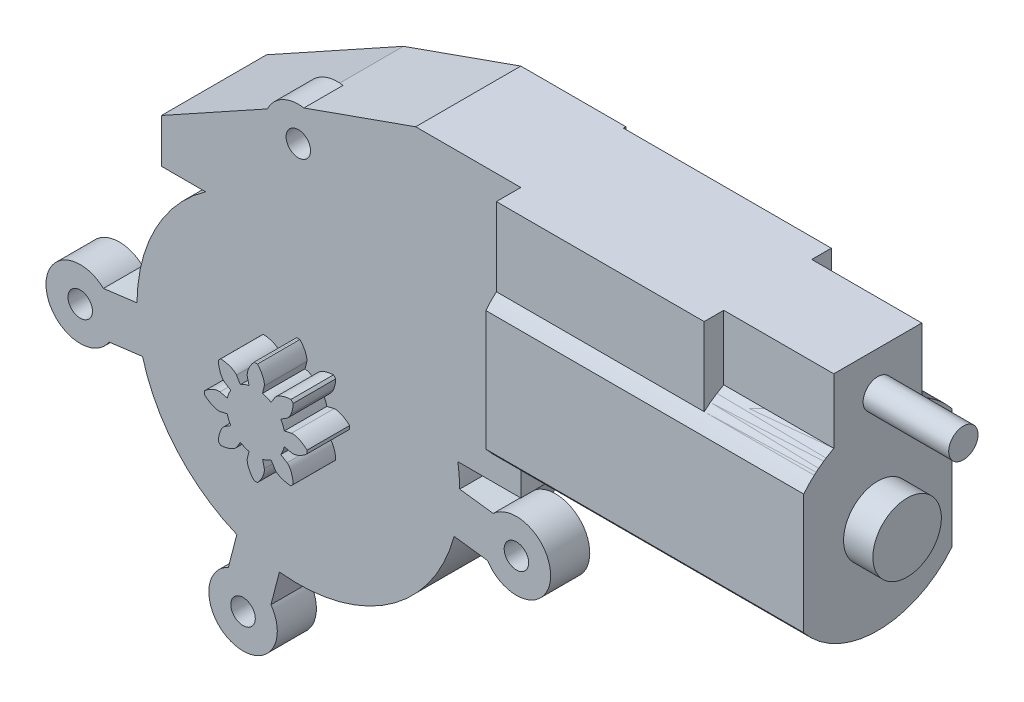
ISO-10303-21;
HEADER;
FILE_DESCRIPTION(('STEP AP214'),'2;1');
FILE_NAME('part.step','',(''),(''),'','','');
FILE_SCHEMA(('AUTOMOTIVE_DESIGN { 1 0 10303 214 1 1 1 1 }'));
ENDSEC;
DATA;
#1=APPLICATION_CONTEXT('core data for automotive mechanical design processes');
#2=APPLICATION_PROTOCOL_DEFINITION('international standard','automotive_design',2000,#1);
#3=PRODUCT_CONTEXT('',#1,'mechanical');
#4=PRODUCT('Part','Part','',(#3));
#5=PRODUCT_RELATED_PRODUCT_CATEGORY('part','',(#4));
#6=PRODUCT_DEFINITION_FORMATION('','',#4);
#7=PRODUCT_DEFINITION_CONTEXT('part definition',#1,'design');
#8=PRODUCT_DEFINITION('design','',#6,#7);
#9=PRODUCT_DEFINITION_SHAPE('','',#8);
#10=(LENGTH_UNIT() NAMED_UNIT(*) SI_UNIT(.MILLI.,.METRE.));
#11=(NAMED_UNIT(*) PLANE_ANGLE_UNIT() SI_UNIT($,.RADIAN.));
#12=(NAMED_UNIT(*) SI_UNIT($,.STERADIAN.) SOLID_ANGLE_UNIT());
#13=UNCERTAINTY_MEASURE_WITH_UNIT(LENGTH_MEASURE(1.E-05),#10,'distance_accuracy_value','');
#14=(GEOMETRIC_REPRESENTATION_CONTEXT(3) GLOBAL_UNCERTAINTY_ASSIGNED_CONTEXT((#13)) GLOBAL_UNIT_ASSIGNED_CONTEXT((#10,
#11,#12)) REPRESENTATION_CONTEXT('',''));
#15=CARTESIAN_POINT('',(0.,0.,0.));
#16=DIRECTION('',(0.,0.,1.));
#17=DIRECTION('',(1.,0.,0.));
#18=AXIS2_PLACEMENT_3D('',#15,#16,#17);
#19=CARTESIAN_POINT('',(0.,0.,8.));
#20=DIRECTION('',(0.,0.,1.));
#21=DIRECTION('',(1.,0.,0.));
#22=AXIS2_PLACEMENT_3D('',#19,#20,#21);
#23=PLANE('',#22);
#24=DIRECTION('',(-0.97274621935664,-0.231872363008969,0.));
#25=VECTOR('',#24,1.);
#26=CARTESIAN_POINT('',(5.83647731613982,1.39123417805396,8.));
#27=LINE('',#26,#25);
#28=CARTESIAN_POINT('',(7.312659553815,1.74310998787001,8.));
#29=VERTEX_POINT('',#28);
#30=CARTESIAN_POINT('',(5.83647731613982,1.39123417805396,8.));
#31=VERTEX_POINT('',#30);
#32=EDGE_CURVE('P0_E1286',#29,#31,#27,.T.);
#33=ORIENTED_EDGE('',*,*,#32,.F.);
#34=CARTESIAN_POINT('',(9.1568773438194,-0.952559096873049,8.));
#35=DIRECTION('',(0.,0.,1.));
#36=DIRECTION('',(0.750730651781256,-0.660608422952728,0.));
#37=AXIS2_PLACEMENT_3D('',#34,#35,#36);
#38=ELLIPSE('',#37,3.51580079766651,1.8504246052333);
#39=CARTESIAN_POINT('',(10.494730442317,0.332615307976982,8.));
#40=VERTEX_POINT('',#39);
#41=EDGE_CURVE('P0_E1593',#40,#29,#38,.T.);
#42=ORIENTED_EDGE('',*,*,#41,.F.);
#43=CARTESIAN_POINT('',(0.,0.,8.));
#44=DIRECTION('',(0.,0.,1.));
#45=DIRECTION('',(-1.,0.,0.));
#46=AXIS2_PLACEMENT_3D('',#43,#44,#45);
#47=CIRCLE('',#46,10.4999999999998);
#48=CARTESIAN_POINT('',(10.4947304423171,-0.332615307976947,8.));
#49=VERTEX_POINT('',#48);
#50=EDGE_CURVE('P0_E1600',#49,#40,#47,.T.);
#51=ORIENTED_EDGE('',*,*,#50,.F.);
#52=CARTESIAN_POINT('',(9.16431232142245,1.02824382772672,8.));
#53=DIRECTION('',(0.,0.,1.));
#54=DIRECTION('',(0.743411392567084,0.668834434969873,0.));
#55=AXIS2_PLACEMENT_3D('',#52,#53,#54);
#56=ELLIPSE('',#55,3.5817188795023,1.90196867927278);
#57=CARTESIAN_POINT('',(7.312659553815,-1.74310998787,8.));
#58=VERTEX_POINT('',#57);
#59=EDGE_CURVE('P0_E1734',#58,#49,#56,.T.);
#60=ORIENTED_EDGE('',*,*,#59,.F.);
#61=DIRECTION('',(0.972746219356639,-0.231872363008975,0.));
#62=VECTOR('',#61,1.);
#63=CARTESIAN_POINT('',(7.312659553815,-1.74310998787,8.));
#64=LINE('',#63,#62);
#65=CARTESIAN_POINT('',(5.83647731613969,-1.39123417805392,8.));
#66=VERTEX_POINT('',#65);
#67=EDGE_CURVE('P0_E1276',#66,#58,#64,.T.);
#68=ORIENTED_EDGE('',*,*,#67,.F.);
#69=CARTESIAN_POINT('',(1.23688940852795E-12,-5.79821695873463E-12,8.));
#70=DIRECTION('',(0.,0.,1.));
#71=DIRECTION('',(1.,0.,0.));
#72=AXIS2_PLACEMENT_3D('',#69,#70,#71);
#73=CIRCLE('',#72,6.00000000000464);
#74=CARTESIAN_POINT('',(5.11076381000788,-3.14326156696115,8.));
#75=VERTEX_POINT('',#74);
#76=EDGE_CURVE('P0_E1196',#75,#66,#73,.T.);
#77=ORIENTED_EDGE('',*,*,#76,.F.);
#78=DIRECTION('',(-0.851793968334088,0.523876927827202,0.));
#79=VECTOR('',#78,1.);
#80=CARTESIAN_POINT('',(5.11076381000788,-3.14326156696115,8.));
#81=LINE('',#80,#79);
#82=CARTESIAN_POINT('',(6.40339605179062,-3.93826626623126,8.));
#83=VERTEX_POINT('',#82);
#84=EDGE_CURVE('P0_E1342',#83,#75,#81,.T.);
#85=ORIENTED_EDGE('',*,*,#84,.F.);
#86=CARTESIAN_POINT('',(5.80132906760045,-7.14845106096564,8.));
#87=DIRECTION('',(0.,0.,1.));
#88=DIRECTION('',(0.0637260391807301,-0.997967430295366,0.));
#89=AXIS2_PLACEMENT_3D('',#86,#87,#88);
#90=ELLIPSE('',#89,3.51580079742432,1.85042460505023);
#91=CARTESIAN_POINT('',(7.65608960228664,-7.18570052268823,8.));
#92=VERTEX_POINT('',#91);
#93=EDGE_CURVE('P0_E1338',#92,#83,#90,.T.);
#94=ORIENTED_EDGE('',*,*,#93,.F.);
#95=CARTESIAN_POINT('',(3.35497612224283E-12,2.05953947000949E-12,8.));
#96=DIRECTION('',(0.,0.,1.));
#97=DIRECTION('',(-1.,0.,0.));
#98=AXIS2_PLACEMENT_3D('',#95,#96,#97);
#99=CIRCLE('',#98,10.4999999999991);
#100=CARTESIAN_POINT('',(7.18570052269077,-7.65608960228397,8.));
#101=VERTEX_POINT('',#100);
#102=EDGE_CURVE('P0_E1337',#101,#92,#99,.T.);
#103=ORIENTED_EDGE('',*,*,#102,.F.);
#104=CARTESIAN_POINT('',(7.20722557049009,-5.7530692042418,8.));
#105=DIRECTION('',(0.,0.,1.));
#106=DIRECTION('',(0.998608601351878,-0.0527338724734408,0.));
#107=AXIS2_PLACEMENT_3D('',#104,#105,#106);
#108=ELLIPSE('',#107,3.58171887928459,1.90196867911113);
#109=CARTESIAN_POINT('',(3.938266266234,-6.403396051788,8.));
#110=VERTEX_POINT('',#109);
#111=EDGE_CURVE('P0_E1335',#110,#101,#108,.T.);
#112=ORIENTED_EDGE('',*,*,#111,.F.);
#113=DIRECTION('',(0.523876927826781,-0.851793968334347,0.));
#114=VECTOR('',#113,1.);
#115=CARTESIAN_POINT('',(3.938266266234,-6.403396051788,8.));
#116=LINE('',#115,#114);
#117=CARTESIAN_POINT('',(3.14326156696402,-5.11076381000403,8.));
#118=VERTEX_POINT('',#117);
#119=EDGE_CURVE('P0_E1328',#118,#110,#116,.T.);
#120=ORIENTED_EDGE('',*,*,#119,.F.);
#121=CARTESIAN_POINT('',(1.39123417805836,-5.8364773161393,8.));
#122=VERTEX_POINT('',#121);
#123=EDGE_CURVE('P0_E1192',#122,#118,#73,.T.);
#124=ORIENTED_EDGE('',*,*,#123,.F.);
#125=DIRECTION('',(-0.231872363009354,0.972746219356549,0.));
#126=VECTOR('',#125,1.);
#127=CARTESIAN_POINT('',(1.39123417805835,-5.83647731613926,8.));
#128=LINE('',#127,#126);
#129=CARTESIAN_POINT('',(1.74310998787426,-7.31265955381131,8.));
#130=VERTEX_POINT('',#129);
#131=EDGE_CURVE('P0_E1655',#130,#122,#128,.T.);
#132=ORIENTED_EDGE('',*,*,#131,.F.);
#133=CARTESIAN_POINT('',(-0.95255909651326,-9.15687734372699,8.));
#134=DIRECTION('',(0.,0.,1.));
#135=DIRECTION('',(-0.660608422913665,-0.75073065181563,0.));
#136=AXIS2_PLACEMENT_3D('',#133,#134,#135);
#137=ELLIPSE('',#136,3.51580079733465,1.85042460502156);
#138=CARTESIAN_POINT('',(0.33261530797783,-10.49473044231,8.));
#139=VERTEX_POINT('',#138);
#140=EDGE_CURVE('P0_E1367',#139,#130,#137,.T.);
#141=ORIENTED_EDGE('',*,*,#140,.F.);
#142=CARTESIAN_POINT('',(8.28069464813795E-13,5.89505489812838E-12,8.));
#143=DIRECTION('',(0.,0.,1.));
#144=DIRECTION('',(-1.,0.,0.));
#145=AXIS2_PLACEMENT_3D('',#142,#143,#144);
#146=CIRCLE('',#145,10.4999999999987);
#147=CARTESIAN_POINT('',(-0.332615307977,-10.49473044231,8.));
#148=VERTEX_POINT('',#147);
#149=EDGE_CURVE('P0_E1374',#148,#139,#146,.T.);
#150=ORIENTED_EDGE('',*,*,#149,.F.);
#151=CARTESIAN_POINT('',(1.02824382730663,-9.1643123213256,8.));
#152=DIRECTION('',(0.,0.,1.));
#153=DIRECTION('',(0.668834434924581,-0.743411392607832,0.));
#154=AXIS2_PLACEMENT_3D('',#151,#152,#153);
#155=ELLIPSE('',#154,3.58171887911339,1.90196867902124);
#156=CARTESIAN_POINT('',(-1.74310998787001,-7.31265955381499,8.));
#157=VERTEX_POINT('',#156);
#158=EDGE_CURVE('P0_E1659',#157,#148,#155,.T.);
#159=ORIENTED_EDGE('',*,*,#158,.F.);
#160=DIRECTION('',(-0.231872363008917,-0.972746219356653,0.));
#161=VECTOR('',#160,1.);
#162=CARTESIAN_POINT('',(-1.74310998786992,-7.312659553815,8.));
#163=LINE('',#162,#161);
#164=CARTESIAN_POINT('',(-1.391234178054,-5.83647731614,8.));
#165=VERTEX_POINT('',#164);
#166=EDGE_CURVE('P0_E1657',#165,#157,#163,.T.);
#167=ORIENTED_EDGE('',*,*,#166,.F.);
#168=CARTESIAN_POINT('',(-3.14326156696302,-5.11076381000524,8.));
#169=VERTEX_POINT('',#168);
#170=EDGE_CURVE('P0_E1188',#169,#165,#73,.T.);
#171=ORIENTED_EDGE('',*,*,#170,.F.);
#172=DIRECTION('',(0.523876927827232,0.851793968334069,0.));
#173=VECTOR('',#172,1.);
#174=CARTESIAN_POINT('',(-3.14326156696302,-5.11076381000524,8.));
#175=LINE('',#174,#173);
#176=CARTESIAN_POINT('',(-3.93826626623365,-6.40339605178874,8.));
#177=VERTEX_POINT('',#176);
#178=EDGE_CURVE('P0_E1412',#177,#169,#175,.T.);
#179=ORIENTED_EDGE('',*,*,#178,.F.);
#180=CARTESIAN_POINT('',(-7.14845106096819,-5.80132906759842,8.));
#181=DIRECTION('',(0.,0.,1.));
#182=DIRECTION('',(0.997967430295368,0.0637260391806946,0.));
#183=AXIS2_PLACEMENT_3D('',#180,#181,#182);
#184=ELLIPSE('',#183,3.5158007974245,1.85042460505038);
#185=CARTESIAN_POINT('',(-7.18570052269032,-7.65608960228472,8.));
#186=VERTEX_POINT('',#185);
#187=EDGE_CURVE('P0_E1410',#186,#177,#184,.T.);
#188=ORIENTED_EDGE('',*,*,#187,.F.);
#189=CARTESIAN_POINT('',(0.,-1.38721403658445E-12,8.));
#190=DIRECTION('',(0.,0.,1.));
#191=DIRECTION('',(-1.,0.,0.));
#192=AXIS2_PLACEMENT_3D('',#189,#190,#191);
#193=CIRCLE('',#192,10.4999999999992);
#194=CARTESIAN_POINT('',(-7.656089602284,-7.185700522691,8.));
#195=VERTEX_POINT('',#194);
#196=EDGE_CURVE('P0_E1425',#195,#186,#193,.T.);
#197=ORIENTED_EDGE('',*,*,#196,.F.);
#198=CARTESIAN_POINT('',(-5.75306920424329,-7.20722557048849,8.));
#199=DIRECTION('',(0.,0.,1.));
#200=DIRECTION('',(-0.0527338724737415,-0.998608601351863,0.));
#201=AXIS2_PLACEMENT_3D('',#198,#199,#200);
#202=ELLIPSE('',#201,3.58171887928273,1.90196867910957);
#203=CARTESIAN_POINT('',(-6.40339605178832,-3.93826626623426,8.));
#204=VERTEX_POINT('',#203);
#205=EDGE_CURVE('P0_E1417',#204,#195,#202,.T.);
#206=ORIENTED_EDGE('',*,*,#205,.F.);
#207=DIRECTION('',(-0.851793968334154,-0.523876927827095,0.));
#208=VECTOR('',#207,1.);
#209=CARTESIAN_POINT('',(-6.40339605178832,-3.93826626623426,8.));
#210=LINE('',#209,#208);
#211=CARTESIAN_POINT('',(-5.11076381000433,-3.14326156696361,8.));
#212=VERTEX_POINT('',#211);
#213=EDGE_CURVE('P0_E1413',#212,#204,#210,.T.);
#214=ORIENTED_EDGE('',*,*,#213,.F.);
#215=CARTESIAN_POINT('',(-5.83647731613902,-1.3912341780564,8.));
#216=VERTEX_POINT('',#215);
#217=EDGE_CURVE('P0_E1190',#216,#212,#73,.T.);
#218=ORIENTED_EDGE('',*,*,#217,.F.);
#219=DIRECTION('',(0.972746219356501,0.231872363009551,0.));
#220=VECTOR('',#219,1.);
#221=CARTESIAN_POINT('',(-5.83647731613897,-1.39123417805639,8.));
#222=LINE('',#221,#220);
#223=CARTESIAN_POINT('',(-7.31265955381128,-1.74310998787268,8.));
#224=VERTEX_POINT('',#223);
#225=EDGE_CURVE('P0_E1487',#224,#216,#222,.T.);
#226=ORIENTED_EDGE('',*,*,#225,.F.);
#227=CARTESIAN_POINT('',(-9.15687734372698,0.952559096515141,8.));
#228=DIRECTION('',(0.,0.,1.));
#229=DIRECTION('',(0.750730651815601,-0.660608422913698,0.));
#230=AXIS2_PLACEMENT_3D('',#227,#228,#229);
#231=ELLIPSE('',#230,3.51580079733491,1.85042460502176);
#232=CARTESIAN_POINT('',(-10.49473044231,-0.33261530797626,8.));
#233=VERTEX_POINT('',#232);
#234=EDGE_CURVE('P0_E1446',#233,#224,#231,.T.);
#235=ORIENTED_EDGE('',*,*,#234,.F.);
#236=CARTESIAN_POINT('',(-7.00671117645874E-13,7.46902948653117E-13,8.));
#237=DIRECTION('',(0.,0.,1.));
#238=DIRECTION('',(-1.,0.,0.));
#239=AXIS2_PLACEMENT_3D('',#236,#237,#238);
#240=CIRCLE('',#239,10.4999999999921);
#241=CARTESIAN_POINT('',(-10.49473044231,0.332615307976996,8.));
#242=VERTEX_POINT('',#241);
#243=EDGE_CURVE('P0_E1455',#242,#233,#240,.T.);
#244=ORIENTED_EDGE('',*,*,#243,.F.);
#245=CARTESIAN_POINT('',(-9.16431232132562,-1.02824382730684,8.));
#246=DIRECTION('',(0.,0.,1.));
#247=DIRECTION('',(0.743411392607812,0.668834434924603,0.));
#248=AXIS2_PLACEMENT_3D('',#245,#246,#247);
#249=ELLIPSE('',#248,3.58171887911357,1.90196867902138);
#250=CARTESIAN_POINT('',(-7.31265955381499,1.74310998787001,8.));
#251=VERTEX_POINT('',#250);
#252=EDGE_CURVE('P0_E1494',#251,#242,#249,.T.);
#253=ORIENTED_EDGE('',*,*,#252,.F.);
#254=DIRECTION('',(-0.972746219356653,0.231872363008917,0.));
#255=VECTOR('',#254,1.);
#256=CARTESIAN_POINT('',(-7.312659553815,1.74310998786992,8.));
#257=LINE('',#256,#255);
#258=CARTESIAN_POINT('',(-5.83647731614,1.391234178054,8.));
#259=VERTEX_POINT('',#258);
#260=EDGE_CURVE('P0_E1486',#259,#251,#257,.T.);
#261=ORIENTED_EDGE('',*,*,#260,.F.);
#262=CARTESIAN_POINT('',(-5.11076381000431,3.14326156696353,8.));
#263=VERTEX_POINT('',#262);
#264=EDGE_CURVE('P0_E1184',#263,#259,#73,.T.);
#265=ORIENTED_EDGE('',*,*,#264,.F.);
#266=DIRECTION('',(0.851793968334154,-0.523876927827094,0.));
#267=VECTOR('',#266,1.);
#268=CARTESIAN_POINT('',(-5.11076381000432,3.14326156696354,8.));
#269=LINE('',#268,#267);
#270=CARTESIAN_POINT('',(-6.403396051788,3.938266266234,8.));
#271=VERTEX_POINT('',#270);
#272=EDGE_CURVE('P0_E967',#271,#263,#269,.T.);
#273=ORIENTED_EDGE('',*,*,#272,.F.);
#274=CARTESIAN_POINT('',(-5.80132906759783,7.14845106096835,8.));
#275=DIRECTION('',(0.,0.,1.));
#276=DIRECTION('',(0.0637260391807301,-0.997967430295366,0.));
#277=AXIS2_PLACEMENT_3D('',#274,#275,#276);
#278=ELLIPSE('',#277,3.51580079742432,1.85042460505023);
#279=CARTESIAN_POINT('',(-7.65608960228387,7.18570052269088,8.));
#280=VERTEX_POINT('',#279);
#281=EDGE_CURVE('P0_E971',#280,#271,#278,.T.);
#282=ORIENTED_EDGE('',*,*,#281,.F.);
#283=CARTESIAN_POINT('',(-9.82025595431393E-13,1.91734525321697E-12,8.));
#284=DIRECTION('',(0.,0.,1.));
#285=DIRECTION('',(-1.,0.,0.));
#286=AXIS2_PLACEMENT_3D('',#283,#284,#285);
#287=CIRCLE('',#286,10.4999999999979);
#288=CARTESIAN_POINT('',(-7.18570052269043,7.65608960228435,8.));
#289=VERTEX_POINT('',#288);
#290=EDGE_CURVE('P0_E960',#289,#280,#287,.T.);
#291=ORIENTED_EDGE('',*,*,#290,.F.);
#292=CARTESIAN_POINT('',(-7.20722557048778,5.75306920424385,8.));
#293=DIRECTION('',(0.,0.,1.));
#294=DIRECTION('',(0.998608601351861,-0.0527338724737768,0.));
#295=AXIS2_PLACEMENT_3D('',#292,#293,#294);
#296=ELLIPSE('',#295,3.58171887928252,1.90196867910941);
#297=CARTESIAN_POINT('',(-3.93826626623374,6.40339605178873,8.));
#298=VERTEX_POINT('',#297);
#299=EDGE_CURVE('P0_E962',#298,#289,#296,.T.);
#300=ORIENTED_EDGE('',*,*,#299,.F.);
#301=DIRECTION('',(-0.523876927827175,0.851793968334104,0.));
#302=VECTOR('',#301,1.);
#303=CARTESIAN_POINT('',(-3.93826626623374,6.40339605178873,8.));
#304=LINE('',#303,#302);
#305=CARTESIAN_POINT('',(-3.14326156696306,5.11076381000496,8.));
#306=VERTEX_POINT('',#305);
#307=EDGE_CURVE('P0_E963',#306,#298,#304,.T.);
#308=ORIENTED_EDGE('',*,*,#307,.F.);
#309=CARTESIAN_POINT('',(-1.39123417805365,5.83647731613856,8.));
#310=VERTEX_POINT('',#309);
#311=EDGE_CURVE('P0_E1178',#310,#306,#73,.T.);
#312=ORIENTED_EDGE('',*,*,#311,.F.);
#313=DIRECTION('',(0.23187236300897,-0.97274621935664,0.));
#314=VECTOR('',#313,1.);
#315=CARTESIAN_POINT('',(-1.74310998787,7.312659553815,8.));
#316=LINE('',#315,#314);
#317=CARTESIAN_POINT('',(-1.74310998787,7.312659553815,8.));
#318=VERTEX_POINT('',#317);
#319=EDGE_CURVE('P0_E1199',#318,#310,#316,.T.);
#320=ORIENTED_EDGE('',*,*,#319,.F.);
#321=CARTESIAN_POINT('',(0.952559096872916,9.15687734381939,8.));
#322=DIRECTION('',(0.,0.,1.));
#323=DIRECTION('',(-0.660608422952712,-0.75073065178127,0.));
#324=AXIS2_PLACEMENT_3D('',#321,#322,#323);
#325=ELLIPSE('',#324,3.51580079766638,1.8504246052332);
#326=CARTESIAN_POINT('',(-0.332615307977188,10.494730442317,8.));
#327=VERTEX_POINT('',#326);
#328=EDGE_CURVE('P0_E655',#327,#318,#325,.T.);
#329=ORIENTED_EDGE('',*,*,#328,.F.);
#330=DIRECTION('',(0.999874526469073,0.0158408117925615,0.));
#331=VECTOR('',#330,1.);
#332=CARTESIAN_POINT('',(0.,10.5,8.));
#333=LINE('',#332,#331);
#334=CARTESIAN_POINT('',(-2.06030990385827E-11,10.4999999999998,8.));
#335=VERTEX_POINT('',#334);
#336=EDGE_CURVE('P0_E649',#335,#327,#333,.F.);
#337=ORIENTED_EDGE('',*,*,#336,.F.);
#338=CARTESIAN_POINT('',(0.,-6.092903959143E-12,8.));
#339=DIRECTION('',(0.,0.,-1.));
#340=DIRECTION('',(-1.,0.,0.));
#341=AXIS2_PLACEMENT_3D('',#338,#339,#340);
#342=CIRCLE('',#341,10.500000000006);
#343=CARTESIAN_POINT('',(0.332615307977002,10.4947304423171,8.));
#344=VERTEX_POINT('',#343);
#345=EDGE_CURVE('P0_E732',#335,#344,#342,.T.);
#346=ORIENTED_EDGE('',*,*,#345,.T.);
#347=CARTESIAN_POINT('',(-0.952323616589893,9.15685730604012,8.));
#348=DIRECTION('',(0.,0.,-1.));
#349=DIRECTION('',(-0.660583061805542,0.750752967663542,0.));
#350=AXIS2_PLACEMENT_3D('',#347,#348,#349);
#351=ELLIPSE('',#350,3.51559584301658,1.85026128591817);
#352=CARTESIAN_POINT('',(1.74310998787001,7.312659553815,8.));
#353=VERTEX_POINT('',#352);
#354=EDGE_CURVE('P0_E722',#344,#353,#351,.T.);
#355=ORIENTED_EDGE('',*,*,#354,.T.);
#356=DIRECTION('',(-0.231872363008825,-0.972746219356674,0.));
#357=VECTOR('',#356,1.);
#358=CARTESIAN_POINT('',(1.74310998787,7.312659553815,8.));
#359=LINE('',#358,#357);
#360=CARTESIAN_POINT('',(1.39123417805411,5.83647731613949,8.));
#361=VERTEX_POINT('',#360);
#362=EDGE_CURVE('P0_E729',#353,#361,#359,.T.);
#363=ORIENTED_EDGE('',*,*,#362,.T.);
#364=CARTESIAN_POINT('',(0.,-6.092903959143E-12,8.));
#365=DIRECTION('',(0.,0.,-1.));
#366=DIRECTION('',(-1.,0.,0.));
#367=AXIS2_PLACEMENT_3D('',#364,#365,#366);
#368=CIRCLE('',#367,6.00000000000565);
#369=CARTESIAN_POINT('',(3.14326156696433,5.11076381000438,8.));
#370=VERTEX_POINT('',#369);
#371=EDGE_CURVE('P0_E740',#361,#370,#368,.T.);
#372=ORIENTED_EDGE('',*,*,#371,.T.);
#373=DIRECTION('',(0.523876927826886,0.851793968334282,0.));
#374=VECTOR('',#373,1.);
#375=CARTESIAN_POINT('',(3.14326156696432,5.11076381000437,8.));
#376=LINE('',#375,#374);
#377=CARTESIAN_POINT('',(3.93826626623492,6.40339605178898,8.));
#378=VERTEX_POINT('',#377);
#379=EDGE_CURVE('P0_E743',#370,#378,#376,.T.);
#380=ORIENTED_EDGE('',*,*,#379,.T.);
#381=CARTESIAN_POINT('',(7.20707804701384,5.7531976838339,8.));
#382=DIRECTION('',(0.,0.,-1.));
#383=DIRECTION('',(0.998607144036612,0.05276146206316,0.));
#384=AXIS2_PLACEMENT_3D('',#381,#382,#383);
#385=ELLIPSE('',#384,3.58154978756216,1.9018326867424);
#386=CARTESIAN_POINT('',(7.18570052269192,7.65608960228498,8.));
#387=VERTEX_POINT('',#386);
#388=EDGE_CURVE('P0_E741',#378,#387,#385,.T.);
#389=ORIENTED_EDGE('',*,*,#388,.T.);
#390=CARTESIAN_POINT('',(0.,-6.092903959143E-12,8.));
#391=DIRECTION('',(0.,0.,-1.));
#392=DIRECTION('',(-1.,0.,0.));
#393=AXIS2_PLACEMENT_3D('',#390,#391,#392);
#394=CIRCLE('',#393,10.5000000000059);
#395=CARTESIAN_POINT('',(7.65608960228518,7.18570052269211,8.));
#396=VERTEX_POINT('',#395);
#397=EDGE_CURVE('P0_E749',#387,#396,#394,.T.);
#398=ORIENTED_EDGE('',*,*,#397,.T.);
#399=CARTESIAN_POINT('',(1.70342562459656,7.36847483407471,8.));
#400=DIRECTION('',(0.,0.,-1.));
#401=DIRECTION('',(-1.,0.,0.));
#402=AXIS2_PLACEMENT_3D('',#399,#400,#401);
#403=CIRCLE('',#402,5.95546932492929);
#404=CARTESIAN_POINT('',(7.16766773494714,5.00000000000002,8.));
#405=VERTEX_POINT('',#404);
#406=EDGE_CURVE('P0_E1224',#396,#405,#403,.T.);
#407=ORIENTED_EDGE('',*,*,#406,.T.);
#408=CARTESIAN_POINT('',(6.7021773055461,5.02691928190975,8.));
#409=DIRECTION('',(0.,0.,1.));
#410=DIRECTION('',(-0.453512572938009,-0.891249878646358,0.));
#411=AXIS2_PLACEMENT_3D('',#408,#409,#410);
#412=ELLIPSE('',#411,1.30109399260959,0.431562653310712);
#413=CARTESIAN_POINT('',(6.403396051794,3.93826626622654,8.));
#414=VERTEX_POINT('',#413);
#415=EDGE_CURVE('P0_E644',#414,#405,#412,.T.);
#416=ORIENTED_EDGE('',*,*,#415,.F.);
#417=DIRECTION('',(0.851793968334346,0.523876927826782,0.));
#418=VECTOR('',#417,1.);
#419=CARTESIAN_POINT('',(5.11076381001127,3.14326156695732,8.));
#420=LINE('',#419,#418);
#421=CARTESIAN_POINT('',(5.11076381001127,3.14326156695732,8.));
#422=VERTEX_POINT('',#421);
#423=EDGE_CURVE('P0_E1080',#422,#414,#420,.T.);
#424=ORIENTED_EDGE('',*,*,#423,.F.);
#425=EDGE_CURVE('P0_E1183',#31,#422,#73,.T.);
#426=ORIENTED_EDGE('',*,*,#425,.F.);
#427=EDGE_LOOP('',(#33,#42,#51,#60,#68,#77,#85,#94,#103,#112,#120,#124,#132,#141,#150,#159,#167,
#171,#179,#188,#197,#206,#214,#218,#226,#235,#244,#253,#261,#265,#273,#282,#291,#300,#308,#312,
#320,#329,#337,#346,#355,#363,#372,#380,#389,#398,#407,#416,#424,#426));
#428=FACE_BOUND('',#427,.T.);
#429=CARTESIAN_POINT('',(-11.3,-43.5,8.));
#430=DIRECTION('',(0.,0.,1.));
#431=DIRECTION('',(1.,0.,0.));
#432=AXIS2_PLACEMENT_3D('',#429,#430,#431);
#433=CIRCLE('',#432,2.49999999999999);
#434=CARTESIAN_POINT('',(-8.80000000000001,-43.5,8.));
#435=VERTEX_POINT('',#434);
#436=EDGE_CURVE('P0_E1091',#435,#435,#433,.T.);
#437=ORIENTED_EDGE('',*,*,#436,.F.);
#438=EDGE_LOOP('',(#437));
#439=FACE_BOUND('',#438,.T.);
#440=CARTESIAN_POINT('',(-44.6,-5.7,8.));
#441=DIRECTION('',(0.,0.,1.));
#442=DIRECTION('',(1.,0.,0.));
#443=AXIS2_PLACEMENT_3D('',#440,#441,#442);
#444=CIRCLE('',#443,2.49999999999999);
#445=CARTESIAN_POINT('',(-42.1,-5.7,8.));
#446=VERTEX_POINT('',#445);
#447=EDGE_CURVE('P0_E1100',#446,#446,#444,.T.);
#448=ORIENTED_EDGE('',*,*,#447,.F.);
#449=EDGE_LOOP('',(#448));
#450=FACE_BOUND('',#449,.T.);
#451=CARTESIAN_POINT('',(44.6,-5.7,8.));
#452=DIRECTION('',(0.,0.,1.));
#453=DIRECTION('',(1.,0.,0.));
#454=AXIS2_PLACEMENT_3D('',#451,#452,#453);
#455=CIRCLE('',#454,2.49999999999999);
#456=CARTESIAN_POINT('',(47.1,-5.7,8.));
#457=VERTEX_POINT('',#456);
#458=EDGE_CURVE('P0_E1105',#457,#457,#455,.T.);
#459=ORIENTED_EDGE('',*,*,#458,.F.);
#460=EDGE_LOOP('',(#459));
#461=FACE_BOUND('',#460,.T.);
#462=CARTESIAN_POINT('',(0.,45.,8.));
#463=DIRECTION('',(0.,0.,1.));
#464=DIRECTION('',(1.,0.,0.));
#465=AXIS2_PLACEMENT_3D('',#462,#463,#464);
#466=CIRCLE('',#465,2.49999999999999);
#467=CARTESIAN_POINT('',(2.49999999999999,45.,8.));
#468=VERTEX_POINT('',#467);
#469=EDGE_CURVE('P0_E1913',#468,#468,#466,.T.);
#470=ORIENTED_EDGE('',*,*,#469,.F.);
#471=EDGE_LOOP('',(#470));
#472=FACE_BOUND('',#471,.T.);
#473=DIRECTION('',(-1.,0.,0.));
#474=VECTOR('',#473,1.);
#475=CARTESIAN_POINT('',(0.,27.,8.));
#476=LINE('',#475,#474);
#477=CARTESIAN_POINT('',(-18.9736659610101,27.,8.00000000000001));
#478=VERTEX_POINT('',#477);
#479=CARTESIAN_POINT('',(-27.9999999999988,27.,8.00000000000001));
#480=VERTEX_POINT('',#479);
#481=EDGE_CURVE('P0_E11',#478,#480,#476,.T.);
#482=ORIENTED_EDGE('',*,*,#481,.F.);
#483=CARTESIAN_POINT('',(0.,0.,8.));
#484=DIRECTION('',(0.,0.,-1.));
#485=DIRECTION('',(1.,0.,0.));
#486=AXIS2_PLACEMENT_3D('',#483,#484,#485);
#487=CIRCLE('',#486,32.9999999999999);
#488=CARTESIAN_POINT('',(-32.9984551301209,0.319310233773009,8.));
#489=VERTEX_POINT('',#488);
#490=EDGE_CURVE('P0_E602',#489,#478,#487,.T.);
#491=ORIENTED_EDGE('',*,*,#490,.F.);
#492=DIRECTION('',(-0.991931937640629,-0.126771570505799,0.));
#493=VECTOR('',#492,1.);
#494=CARTESIAN_POINT('',(-32.99845513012,0.319310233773,8.));
#495=LINE('',#494,#493);
#496=CARTESIAN_POINT('',(-39.85182958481,-0.55656946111,8.));
#497=VERTEX_POINT('',#496);
#498=EDGE_CURVE('P0_E1268',#489,#497,#495,.T.);
#499=ORIENTED_EDGE('',*,*,#498,.T.);
#500=CARTESIAN_POINT('',(-44.6,-5.7,8.));
#501=DIRECTION('',(0.,0.,1.));
#502=DIRECTION('',(1.,0.,0.));
#503=AXIS2_PLACEMENT_3D('',#500,#501,#502);
#504=CIRCLE('',#503,7.00000000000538);
#505=CARTESIAN_POINT('',(-38.71088545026,-9.483956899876,8.));
#506=VERTEX_POINT('',#505);
#507=EDGE_CURVE('P0_E1261',#497,#506,#504,.T.);
#508=ORIENTED_EDGE('',*,*,#507,.T.);
#509=DIRECTION('',(0.991931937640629,0.126771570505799,0.));
#510=VECTOR('',#509,1.);
#511=CARTESIAN_POINT('',(-38.71088545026,-9.483956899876,8.));
#512=LINE('',#511,#510);
#513=CARTESIAN_POINT('',(-31.8575109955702,-8.60807720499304,8.));
#514=VERTEX_POINT('',#513);
#515=EDGE_CURVE('P0_E1257',#506,#514,#512,.T.);
#516=ORIENTED_EDGE('',*,*,#515,.T.);
#517=CARTESIAN_POINT('',(-12.5749804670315,-30.5101600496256,8.));
#518=VERTEX_POINT('',#517);
#519=EDGE_CURVE('P0_E609',#518,#514,#487,.T.);
#520=ORIENTED_EDGE('',*,*,#519,.F.);
#521=DIRECTION('',(-0.251425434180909,-0.967876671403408,0.));
#522=VECTOR('',#521,1.);
#523=CARTESIAN_POINT('',(-12.57498046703,-30.51016004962,8.));
#524=LINE('',#523,#522);
#525=CARTESIAN_POINT('',(-14.30732632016,-37.17892505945,8.));
#526=VERTEX_POINT('',#525);
#527=EDGE_CURVE('P0_E1763',#518,#526,#524,.T.);
#528=ORIENTED_EDGE('',*,*,#527,.T.);
#529=CARTESIAN_POINT('',(-11.2999999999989,-43.5000000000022,8.));
#530=DIRECTION('',(0.,0.,1.));
#531=DIRECTION('',(1.,0.,0.));
#532=AXIS2_PLACEMENT_3D('',#529,#530,#531);
#533=CIRCLE('',#532,7.00000000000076);
#534=CARTESIAN_POINT('',(-5.59643627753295,-39.4417539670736,8.));
#535=VERTEX_POINT('',#534);
#536=EDGE_CURVE('P0_E1767',#526,#535,#533,.T.);
#537=ORIENTED_EDGE('',*,*,#536,.T.);
#538=DIRECTION('',(0.251425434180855,0.967876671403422,0.));
#539=VECTOR('',#538,1.);
#540=CARTESIAN_POINT('',(-5.59643627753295,-39.4417539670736,8.));
#541=LINE('',#540,#539);
#542=CARTESIAN_POINT('',(-3.86409042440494,-32.7729889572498,8.));
#543=VERTEX_POINT('',#542);
#544=EDGE_CURVE('P0_E1762',#535,#543,#541,.T.);
#545=ORIENTED_EDGE('',*,*,#544,.T.);
#546=CARTESIAN_POINT('',(31.8575109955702,-8.60807720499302,8.));
#547=VERTEX_POINT('',#546);
#548=EDGE_CURVE('P0_E631',#547,#543,#487,.T.);
#549=ORIENTED_EDGE('',*,*,#548,.F.);
#550=DIRECTION('',(0.991931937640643,-0.12677157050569,0.));
#551=VECTOR('',#550,1.);
#552=CARTESIAN_POINT('',(31.85751099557,-8.608077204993,8.));
#553=LINE('',#552,#551);
#554=CARTESIAN_POINT('',(38.710885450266,-9.483956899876,8.));
#555=VERTEX_POINT('',#554);
#556=EDGE_CURVE('P0_E1799',#547,#555,#553,.T.);
#557=ORIENTED_EDGE('',*,*,#556,.T.);
#558=CARTESIAN_POINT('',(44.6,-5.7,8.));
#559=DIRECTION('',(0.,0.,1.));
#560=DIRECTION('',(1.,0.,0.));
#561=AXIS2_PLACEMENT_3D('',#558,#559,#560);
#562=CIRCLE('',#561,7.00000000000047);
#563=CARTESIAN_POINT('',(39.851829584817,-0.55656946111,8.));
#564=VERTEX_POINT('',#563);
#565=EDGE_CURVE('P0_E1809',#555,#564,#562,.T.);
#566=ORIENTED_EDGE('',*,*,#565,.T.);
#567=DIRECTION('',(-0.991931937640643,0.12677157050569,0.));
#568=VECTOR('',#567,1.);
#569=CARTESIAN_POINT('',(39.851829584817,-0.55656946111,8.));
#570=LINE('',#569,#568);
#571=CARTESIAN_POINT('',(32.9984551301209,0.319310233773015,8.));
#572=VERTEX_POINT('',#571);
#573=EDGE_CURVE('P0_E1803',#564,#572,#570,.T.);
#574=ORIENTED_EDGE('',*,*,#573,.T.);
#575=CARTESIAN_POINT('',(32.6190128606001,5.,8.));
#576=VERTEX_POINT('',#575);
#577=EDGE_CURVE('P0_E615',#576,#572,#487,.T.);
#578=ORIENTED_EDGE('',*,*,#577,.F.);
#579=DIRECTION('',(1.,0.,0.));
#580=VECTOR('',#579,1.);
#581=CARTESIAN_POINT('',(45.5000000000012,5.,8.));
#582=LINE('',#581,#580);
#583=CARTESIAN_POINT('',(45.5000000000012,5.,8.));
#584=VERTEX_POINT('',#583);
#585=EDGE_CURVE('P0_E821',#576,#584,#582,.T.);
#586=ORIENTED_EDGE('',*,*,#585,.T.);
#587=DIRECTION('',(0.,1.,0.));
#588=VECTOR('',#587,1.);
#589=CARTESIAN_POINT('',(45.5000000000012,60.,8.));
#590=LINE('',#589,#588);
#591=CARTESIAN_POINT('',(45.5000000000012,11.7165807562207,8.));
#592=VERTEX_POINT('',#591);
#593=EDGE_CURVE('P0_E830',#584,#592,#590,.T.);
#594=ORIENTED_EDGE('',*,*,#593,.T.);
#595=CARTESIAN_POINT('',(45.5000000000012,60.,8.));
#596=VERTEX_POINT('',#595);
#597=EDGE_CURVE('P0_E805',#592,#596,#590,.T.);
#598=ORIENTED_EDGE('',*,*,#597,.T.);
#599=DIRECTION('',(-1.,0.,0.));
#600=VECTOR('',#599,1.);
#601=CARTESIAN_POINT('',(15.3548387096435,60.,8.));
#602=LINE('',#601,#600);
#603=CARTESIAN_POINT('',(23.9999999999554,60.,8.));
#604=VERTEX_POINT('',#603);
#605=EDGE_CURVE('P0_E735',#596,#604,#602,.T.);
#606=ORIENTED_EDGE('',*,*,#605,.T.);
#607=DIRECTION('',(-0.942627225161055,-0.333847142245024,0.));
#608=VECTOR('',#607,1.);
#609=CARTESIAN_POINT('',(-16.2067103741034,45.7601234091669,8.));
#610=LINE('',#609,#608);
#611=CARTESIAN_POINT('',(1.14538388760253,51.90565679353,8.));
#612=VERTEX_POINT('',#611);
#613=EDGE_CURVE('P0_E1112',#604,#612,#610,.T.);
#614=ORIENTED_EDGE('',*,*,#613,.T.);
#615=CARTESIAN_POINT('',(0.,45.,8.));
#616=DIRECTION('',(0.,0.,1.));
#617=DIRECTION('',(1.,0.,0.));
#618=AXIS2_PLACEMENT_3D('',#615,#616,#617);
#619=CIRCLE('',#618,7.00000000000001);
#620=CARTESIAN_POINT('',(-6.325258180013,47.998517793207,8.));
#621=VERTEX_POINT('',#620);
#622=EDGE_CURVE('P0_E1885',#612,#621,#619,.T.);
#623=ORIENTED_EDGE('',*,*,#622,.T.);
#624=DIRECTION('',(-0.874893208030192,-0.484315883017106,0.));
#625=VECTOR('',#624,1.);
#626=CARTESIAN_POINT('',(15.3548387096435,59.9999999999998,8.));
#627=LINE('',#626,#625);
#628=CARTESIAN_POINT('',(-28.,35.9999999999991,8.));
#629=VERTEX_POINT('',#628);
#630=EDGE_CURVE('P0_E608',#621,#629,#627,.T.);
#631=ORIENTED_EDGE('',*,*,#630,.T.);
#632=DIRECTION('',(0.,-1.,0.));
#633=VECTOR('',#632,1.);
#634=CARTESIAN_POINT('',(-28.,60.,8.));
#635=LINE('',#634,#633);
#636=EDGE_CURVE('P0_E611',#629,#480,#635,.T.);
#637=ORIENTED_EDGE('',*,*,#636,.T.);
#638=EDGE_LOOP('',(#482,#491,#499,#508,#516,#520,#528,#537,#545,#549,#557,#566,#574,#578,#586,
#594,#598,#606,#614,#623,#631,#637));
#639=FACE_BOUND('',#638,.T.);
#640=ADVANCED_FACE('P0_F54',(#428,#439,#450,#461,#472,#639),#23,.T.);
#641=CARTESIAN_POINT('',(7.16766773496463,4.99999999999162,8.));
#642=DIRECTION('',(0.,-1.,0.));
#643=DIRECTION('',(0.,0.,-1.));
#644=AXIS2_PLACEMENT_3D('',#641,#642,#643);
#645=PLANE('',#644);
#646=DIRECTION('',(0.,0.,1.));
#647=VECTOR('',#646,1.);
#648=CARTESIAN_POINT('',(32.6190128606,5.,-9.));
#649=LINE('',#648,#647);
#650=CARTESIAN_POINT('',(32.6190128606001,5.,-13.5));
#651=VERTEX_POINT('',#650);
#652=EDGE_CURVE('P0_E75',#651,#576,#649,.T.);
#653=ORIENTED_EDGE('',*,*,#652,.F.);
#654=DIRECTION('',(-1.,0.,0.));
#655=VECTOR('',#654,1.);
#656=CARTESIAN_POINT('',(-28.,5.,-13.5));
#657=LINE('',#656,#655);
#658=CARTESIAN_POINT('',(45.5,5.,-13.5));
#659=VERTEX_POINT('',#658);
#660=EDGE_CURVE('P0_E838',#659,#651,#657,.T.);
#661=ORIENTED_EDGE('',*,*,#660,.F.);
#662=DIRECTION('',(0.,0.,-1.));
#663=VECTOR('',#662,1.);
#664=CARTESIAN_POINT('',(45.5000000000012,5.,8.));
#665=LINE('',#664,#663);
#666=EDGE_CURVE('P0_E637',#584,#659,#665,.T.);
#667=ORIENTED_EDGE('',*,*,#666,.F.);
#668=ORIENTED_EDGE('',*,*,#585,.F.);
#669=EDGE_LOOP('',(#653,#661,#667,#668));
#670=FACE_BOUND('',#669,.T.);
#671=ADVANCED_FACE('P0_F662',(#670),#645,.T.);
#672=CARTESIAN_POINT('',(1.23512311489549E-12,27.,-9.));
#673=DIRECTION('',(0.,1.,0.));
#674=DIRECTION('',(0.,0.,1.));
#675=AXIS2_PLACEMENT_3D('',#672,#673,#674);
#676=PLANE('',#675);
#677=DIRECTION('',(0.,0.,1.));
#678=VECTOR('',#677,1.);
#679=CARTESIAN_POINT('',(-18.9736659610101,27.,-13.5));
#680=LINE('',#679,#678);
#681=CARTESIAN_POINT('',(-18.9736659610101,27.,-13.5));
#682=VERTEX_POINT('',#681);
#683=EDGE_CURVE('P0_E63',#478,#682,#680,.F.);
#684=ORIENTED_EDGE('',*,*,#683,.F.);
#685=ORIENTED_EDGE('',*,*,#481,.T.);
#686=DIRECTION('',(0.,0.,-1.));
#687=VECTOR('',#686,1.);
#688=CARTESIAN_POINT('',(-27.9999999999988,27.,-9.));
#689=LINE('',#688,#687);
#690=CARTESIAN_POINT('',(-27.9999999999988,27.,-13.5));
#691=VERTEX_POINT('',#690);
#692=EDGE_CURVE('P0_E1830',#480,#691,#689,.T.);
#693=ORIENTED_EDGE('',*,*,#692,.T.);
#694=DIRECTION('',(-1.,0.,0.));
#695=VECTOR('',#694,1.);
#696=CARTESIAN_POINT('',(1.23512311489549E-12,27.,-13.5));
#697=LINE('',#696,#695);
#698=EDGE_CURVE('P0_E78',#682,#691,#697,.T.);
#699=ORIENTED_EDGE('',*,*,#698,.F.);
#700=EDGE_LOOP('',(#684,#685,#693,#699));
#701=FACE_BOUND('',#700,.T.);
#702=ADVANCED_FACE('P0_F594',(#701),#676,.F.);
#703=CARTESIAN_POINT('',(45.5000000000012,60.,16.7));
#704=DIRECTION('',(0.,-1.,0.));
#705=DIRECTION('',(0.,0.,-1.));
#706=AXIS2_PLACEMENT_3D('',#703,#704,#705);
#707=PLANE('',#706);
#708=DIRECTION('',(1.,0.,0.));
#709=VECTOR('',#708,1.);
#710=CARTESIAN_POINT('',(45.5,60.,-13.5));
#711=LINE('',#710,#709);
#712=CARTESIAN_POINT('',(23.9999999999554,60.,-13.5));
#713=VERTEX_POINT('',#712);
#714=CARTESIAN_POINT('',(45.5,60.,-13.5));
#715=VERTEX_POINT('',#714);
#716=EDGE_CURVE('P0_E847',#713,#715,#711,.T.);
#717=ORIENTED_EDGE('',*,*,#716,.F.);
#718=DIRECTION('',(0.,0.,1.));
#719=VECTOR('',#718,1.);
#720=CARTESIAN_POINT('',(23.9999999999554,60.,8.));
#721=LINE('',#720,#719);
#722=EDGE_CURVE('P0_E1110',#713,#604,#721,.T.);
#723=ORIENTED_EDGE('',*,*,#722,.T.);
#724=ORIENTED_EDGE('',*,*,#605,.F.);
#725=DIRECTION('',(0.,0.,1.));
#726=VECTOR('',#725,1.);
#727=CARTESIAN_POINT('',(45.5000000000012,60.,13.));
#728=LINE('',#727,#726);
#729=CARTESIAN_POINT('',(45.5000000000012,60.,13.));
#730=VERTEX_POINT('',#729);
#731=EDGE_CURVE('P0_E903',#596,#730,#728,.T.);
#732=ORIENTED_EDGE('',*,*,#731,.T.);
#733=DIRECTION('',(-1.,0.,0.));
#734=VECTOR('',#733,1.);
#735=CARTESIAN_POINT('',(110.500000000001,60.,13.));
#736=LINE('',#735,#734);
#737=CARTESIAN_POINT('',(88.,60.,13.));
#738=VERTEX_POINT('',#737);
#739=EDGE_CURVE('P0_E865',#738,#730,#736,.T.);
#740=ORIENTED_EDGE('',*,*,#739,.F.);
#741=DIRECTION('',(0.,0.,1.));
#742=VECTOR('',#741,1.);
#743=CARTESIAN_POINT('',(88.,60.,9.));
#744=LINE('',#743,#742);
#745=CARTESIAN_POINT('',(88.,60.,9.));
#746=VERTEX_POINT('',#745);
#747=EDGE_CURVE('P0_E1871',#746,#738,#744,.T.);
#748=ORIENTED_EDGE('',*,*,#747,.F.);
#749=DIRECTION('',(-1.,0.,0.));
#750=VECTOR('',#749,1.);
#751=CARTESIAN_POINT('',(110.5,60.,9.));
#752=LINE('',#751,#750);
#753=CARTESIAN_POINT('',(110.5,60.,9.));
#754=VERTEX_POINT('',#753);
#755=EDGE_CURVE('P0_E1864',#754,#746,#752,.T.);
#756=ORIENTED_EDGE('',*,*,#755,.F.);
#757=DIRECTION('',(0.,0.,1.));
#758=VECTOR('',#757,1.);
#759=CARTESIAN_POINT('',(110.500000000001,60.,13.));
#760=LINE('',#759,#758);
#761=CARTESIAN_POINT('',(110.500000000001,60.,-8.99999999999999));
#762=VERTEX_POINT('',#761);
#763=EDGE_CURVE('P0_E928',#762,#754,#760,.T.);
#764=ORIENTED_EDGE('',*,*,#763,.F.);
#765=DIRECTION('',(1.,0.,0.));
#766=VECTOR('',#765,1.);
#767=CARTESIAN_POINT('',(88.,60.,-9.));
#768=LINE('',#767,#766);
#769=CARTESIAN_POINT('',(88.,60.,-9.));
#770=VERTEX_POINT('',#769);
#771=EDGE_CURVE('P0_E1848',#770,#762,#768,.T.);
#772=ORIENTED_EDGE('',*,*,#771,.F.);
#773=DIRECTION('',(0.,0.,1.));
#774=VECTOR('',#773,1.);
#775=CARTESIAN_POINT('',(88.,60.,-13.));
#776=LINE('',#775,#774);
#777=CARTESIAN_POINT('',(88.,60.,-13.));
#778=VERTEX_POINT('',#777);
#779=EDGE_CURVE('P0_E1837',#778,#770,#776,.T.);
#780=ORIENTED_EDGE('',*,*,#779,.F.);
#781=DIRECTION('',(-1.,0.,0.));
#782=VECTOR('',#781,1.);
#783=CARTESIAN_POINT('',(110.500000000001,60.,-13.));
#784=LINE('',#783,#782);
#785=CARTESIAN_POINT('',(45.5000000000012,60.,-13.));
#786=VERTEX_POINT('',#785);
#787=EDGE_CURVE('P0_E860',#778,#786,#784,.T.);
#788=ORIENTED_EDGE('',*,*,#787,.T.);
#789=DIRECTION('',(0.,0.,1.));
#790=VECTOR('',#789,1.);
#791=CARTESIAN_POINT('',(45.5000000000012,60.,16.7));
#792=LINE('',#791,#790);
#793=EDGE_CURVE('P0_E638',#715,#786,#792,.T.);
#794=ORIENTED_EDGE('',*,*,#793,.F.);
#795=EDGE_LOOP('',(#717,#723,#724,#732,#740,#748,#756,#764,#772,#780,#788,#794));
#796=FACE_BOUND('',#795,.T.);
#797=ADVANCED_FACE('P0_F692',(#796),#707,.F.);
#798=CARTESIAN_POINT('',(110.500000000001,29.5,0.));
#799=DIRECTION('',(-1.,0.,0.));
#800=DIRECTION('',(0.,0.,1.));
#801=AXIS2_PLACEMENT_3D('',#798,#799,#800);
#802=PLANE('',#801);
#803=CARTESIAN_POINT('',(110.5,29.5,0.));
#804=DIRECTION('',(-1.,0.,0.));
#805=DIRECTION('',(0.,0.,1.));
#806=AXIS2_PLACEMENT_3D('',#803,#804,#805);
#807=CIRCLE('',#806,7.);
#808=CARTESIAN_POINT('',(110.5,29.5,7.));
#809=VERTEX_POINT('',#808);
#810=EDGE_CURVE('P0_E1094',#809,#809,#807,.T.);
#811=ORIENTED_EDGE('',*,*,#810,.T.);
#812=EDGE_LOOP('',(#811));
#813=FACE_BOUND('',#812,.T.);
#814=CARTESIAN_POINT('',(110.5,52.,0.));
#815=DIRECTION('',(-1.,0.,0.));
#816=DIRECTION('',(0.,0.,1.));
#817=AXIS2_PLACEMENT_3D('',#814,#815,#816);
#818=CIRCLE('',#817,3.);
#819=CARTESIAN_POINT('',(110.5,52.,3.));
#820=VERTEX_POINT('',#819);
#821=EDGE_CURVE('P0_E1893',#820,#820,#818,.T.);
#822=ORIENTED_EDGE('',*,*,#821,.T.);
#823=EDGE_LOOP('',(#822));
#824=FACE_BOUND('',#823,.T.);
#825=DIRECTION('',(0.,1.,0.));
#826=VECTOR('',#825,1.);
#827=CARTESIAN_POINT('',(110.5,-50.501000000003,9.));
#828=LINE('',#827,#826);
#829=CARTESIAN_POINT('',(110.5,46.798843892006,9.));
#830=VERTEX_POINT('',#829);
#831=EDGE_CURVE('P0_E1857',#830,#754,#828,.T.);
#832=ORIENTED_EDGE('',*,*,#831,.F.);
#833=CARTESIAN_POINT('',(110.500000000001,29.5,0.));
#834=DIRECTION('',(1.,0.,0.));
#835=DIRECTION('',(0.,0.,1.));
#836=AXIS2_PLACEMENT_3D('',#833,#834,#835);
#837=CIRCLE('',#836,19.4999999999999);
#838=CARTESIAN_POINT('',(110.500000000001,41.7771128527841,15.1500000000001));
#839=VERTEX_POINT('',#838);
#840=EDGE_CURVE('P0_E929',#830,#839,#837,.T.);
#841=ORIENTED_EDGE('',*,*,#840,.T.);
#842=DIRECTION('',(0.,-1.,0.));
#843=VECTOR('',#842,1.);
#844=CARTESIAN_POINT('',(110.500000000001,17.222887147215,15.15));
#845=LINE('',#844,#843);
#846=CARTESIAN_POINT('',(110.500000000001,17.222887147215,15.15));
#847=VERTEX_POINT('',#846);
#848=EDGE_CURVE('P0_E922',#839,#847,#845,.T.);
#849=ORIENTED_EDGE('',*,*,#848,.T.);
#850=CARTESIAN_POINT('',(110.500000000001,29.5,0.));
#851=DIRECTION('',(1.,0.,0.));
#852=DIRECTION('',(0.,0.,1.));
#853=AXIS2_PLACEMENT_3D('',#850,#851,#852);
#854=CIRCLE('',#853,19.5000000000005);
#855=CARTESIAN_POINT('',(110.500000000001,17.222887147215,-15.15));
#856=VERTEX_POINT('',#855);
#857=EDGE_CURVE('P0_E921',#847,#856,#854,.T.);
#858=ORIENTED_EDGE('',*,*,#857,.T.);
#859=DIRECTION('',(0.,1.,0.));
#860=VECTOR('',#859,1.);
#861=CARTESIAN_POINT('',(110.500000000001,41.777112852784,-15.15));
#862=LINE('',#861,#860);
#863=CARTESIAN_POINT('',(110.500000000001,41.777112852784,-15.15));
#864=VERTEX_POINT('',#863);
#865=EDGE_CURVE('P0_E881',#856,#864,#862,.T.);
#866=ORIENTED_EDGE('',*,*,#865,.T.);
#867=CARTESIAN_POINT('',(110.500000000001,29.5,0.));
#868=DIRECTION('',(1.,0.,0.));
#869=DIRECTION('',(0.,0.,1.));
#870=AXIS2_PLACEMENT_3D('',#867,#868,#869);
#871=CIRCLE('',#870,19.4999999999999);
#872=CARTESIAN_POINT('',(110.5,46.7988438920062,-9.));
#873=VERTEX_POINT('',#872);
#874=EDGE_CURVE('P0_E889',#864,#873,#871,.T.);
#875=ORIENTED_EDGE('',*,*,#874,.T.);
#876=DIRECTION('',(0.,1.,0.));
#877=VECTOR('',#876,1.);
#878=CARTESIAN_POINT('',(110.5,-50.501000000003,-9.));
#879=LINE('',#878,#877);
#880=EDGE_CURVE('P0_E1834',#873,#762,#879,.T.);
#881=ORIENTED_EDGE('',*,*,#880,.T.);
#882=ORIENTED_EDGE('',*,*,#763,.T.);
#883=EDGE_LOOP('',(#832,#841,#849,#858,#866,#875,#881,#882));
#884=FACE_BOUND('',#883,.T.);
#885=ADVANCED_FACE('P0_F696',(#813,#824,#884),#802,.F.);
#886=CARTESIAN_POINT('',(110.500000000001,60.,-13.));
#887=DIRECTION('',(0.,0.,1.));
#888=DIRECTION('',(1.,0.,0.));
#889=AXIS2_PLACEMENT_3D('',#886,#887,#888);
#890=PLANE('',#889);
#891=DIRECTION('',(0.,1.,0.));
#892=VECTOR('',#891,1.);
#893=CARTESIAN_POINT('',(88.,-50.501000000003,-13.));
#894=LINE('',#893,#892);
#895=CARTESIAN_POINT('',(88.,44.034441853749,-13.));
#896=VERTEX_POINT('',#895);
#897=EDGE_CURVE('P0_E1832',#896,#778,#894,.T.);
#898=ORIENTED_EDGE('',*,*,#897,.F.);
#899=DIRECTION('',(-1.,0.,0.));
#900=VECTOR('',#899,1.);
#901=CARTESIAN_POINT('',(110.500000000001,44.0344418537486,-13.));
#902=LINE('',#901,#900);
#903=CARTESIAN_POINT('',(45.5000000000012,44.0344418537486,-13.));
#904=VERTEX_POINT('',#903);
#905=EDGE_CURVE('P0_E858',#896,#904,#902,.T.);
#906=ORIENTED_EDGE('',*,*,#905,.T.);
#907=DIRECTION('',(0.,1.,0.));
#908=VECTOR('',#907,1.);
#909=CARTESIAN_POINT('',(45.5000000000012,60.,-13.));
#910=LINE('',#909,#908);
#911=EDGE_CURVE('P0_E909',#904,#786,#910,.T.);
#912=ORIENTED_EDGE('',*,*,#911,.T.);
#913=ORIENTED_EDGE('',*,*,#787,.F.);
#914=EDGE_LOOP('',(#898,#906,#912,#913));
#915=FACE_BOUND('',#914,.T.);
#916=ADVANCED_FACE('P0_F701',(#915),#890,.F.);
#917=CARTESIAN_POINT('',(0.,0.,-9.));
#918=DIRECTION('',(0.,0.,1.));
#919=DIRECTION('',(1.,0.,0.));
#920=AXIS2_PLACEMENT_3D('',#917,#918,#919);
#921=CYLINDRICAL_SURFACE('',#920,32.9999999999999);
#922=ORIENTED_EDGE('',*,*,#490,.T.);
#923=ORIENTED_EDGE('',*,*,#683,.T.);
#924=CARTESIAN_POINT('',(0.,0.,-13.5));
#925=DIRECTION('',(0.,0.,-1.));
#926=DIRECTION('',(-1.,0.,0.));
#927=AXIS2_PLACEMENT_3D('',#924,#925,#926);
#928=CIRCLE('',#927,32.9999999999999);
#929=EDGE_CURVE('P0_E1917',#651,#682,#928,.T.);
#930=ORIENTED_EDGE('',*,*,#929,.F.);
#931=ORIENTED_EDGE('',*,*,#652,.T.);
#932=ORIENTED_EDGE('',*,*,#577,.T.);
#933=DIRECTION('',(0.,0.,1.));
#934=VECTOR('',#933,1.);
#935=CARTESIAN_POINT('',(32.9984551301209,0.319310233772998,0.));
#936=LINE('',#935,#934);
#937=CARTESIAN_POINT('',(32.9984551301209,0.319310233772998,0.));
#938=VERTEX_POINT('',#937);
#939=EDGE_CURVE('P0_E1788',#938,#572,#936,.T.);
#940=ORIENTED_EDGE('',*,*,#939,.F.);
#941=CARTESIAN_POINT('',(0.,0.,0.));
#942=DIRECTION('',(0.,0.,-1.));
#943=DIRECTION('',(-1.,0.,0.));
#944=AXIS2_PLACEMENT_3D('',#941,#942,#943);
#945=CIRCLE('',#944,32.9999999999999);
#946=CARTESIAN_POINT('',(31.8575109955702,-8.60807720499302,0.));
#947=VERTEX_POINT('',#946);
#948=EDGE_CURVE('P0_E1818',#938,#947,#945,.T.);
#949=ORIENTED_EDGE('',*,*,#948,.T.);
#950=DIRECTION('',(0.,0.,1.));
#951=VECTOR('',#950,1.);
#952=CARTESIAN_POINT('',(31.85751099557,-8.608077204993,0.));
#953=LINE('',#952,#951);
#954=EDGE_CURVE('P0_E1791',#947,#547,#953,.T.);
#955=ORIENTED_EDGE('',*,*,#954,.T.);
#956=ORIENTED_EDGE('',*,*,#548,.T.);
#957=DIRECTION('',(0.,0.,1.));
#958=VECTOR('',#957,1.);
#959=CARTESIAN_POINT('',(-3.86409042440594,-32.7729889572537,0.));
#960=LINE('',#959,#958);
#961=CARTESIAN_POINT('',(-3.86409042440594,-32.7729889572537,0.));
#962=VERTEX_POINT('',#961);
#963=EDGE_CURVE('P0_E1754',#962,#543,#960,.T.);
#964=ORIENTED_EDGE('',*,*,#963,.F.);
#965=CARTESIAN_POINT('',(3.39919065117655E-11,-1.0769163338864E-11,0.));
#966=DIRECTION('',(0.,0.,-1.));
#967=DIRECTION('',(-1.,0.,0.));
#968=AXIS2_PLACEMENT_3D('',#965,#966,#967);
#969=CIRCLE('',#968,32.9999999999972);
#970=CARTESIAN_POINT('',(-12.5749804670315,-30.5101600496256,0.));
#971=VERTEX_POINT('',#970);
#972=EDGE_CURVE('P0_E1780',#962,#971,#969,.T.);
#973=ORIENTED_EDGE('',*,*,#972,.T.);
#974=DIRECTION('',(0.,0.,1.));
#975=VECTOR('',#974,1.);
#976=CARTESIAN_POINT('',(-12.57498046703,-30.51016004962,0.));
#977=LINE('',#976,#975);
#978=EDGE_CURVE('P0_E1248',#971,#518,#977,.T.);
#979=ORIENTED_EDGE('',*,*,#978,.T.);
#980=ORIENTED_EDGE('',*,*,#519,.T.);
#981=DIRECTION('',(0.,0.,1.));
#982=VECTOR('',#981,1.);
#983=CARTESIAN_POINT('',(-31.85751099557,-8.608077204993,0.));
#984=LINE('',#983,#982);
#985=CARTESIAN_POINT('',(-31.85751099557,-8.608077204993,0.));
#986=VERTEX_POINT('',#985);
#987=EDGE_CURVE('P0_E1244',#986,#514,#984,.T.);
#988=ORIENTED_EDGE('',*,*,#987,.F.);
#989=CARTESIAN_POINT('',(3.2612801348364E-13,-2.60989146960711E-12,0.));
#990=DIRECTION('',(0.,0.,-1.));
#991=DIRECTION('',(-1.,0.,0.));
#992=AXIS2_PLACEMENT_3D('',#989,#990,#991);
#993=CIRCLE('',#992,32.9999999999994);
#994=CARTESIAN_POINT('',(-32.9984551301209,0.319310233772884,0.));
#995=VERTEX_POINT('',#994);
#996=EDGE_CURVE('P0_E1738',#986,#995,#993,.T.);
#997=ORIENTED_EDGE('',*,*,#996,.T.);
#998=DIRECTION('',(0.,0.,1.));
#999=VECTOR('',#998,1.);
#1000=CARTESIAN_POINT('',(-32.99845513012,0.319310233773,0.));
#1001=LINE('',#1000,#999);
#1002=EDGE_CURVE('P0_E601',#995,#489,#1001,.T.);
#1003=ORIENTED_EDGE('',*,*,#1002,.T.);
#1004=EDGE_LOOP('',(#922,#923,#930,#931,#932,#940,#949,#955,#956,#964,#973,#979,#980,#988,#997,#1003));
#1005=FACE_BOUND('',#1004,.T.);
#1006=ADVANCED_FACE('P0_F604',(#1005),#921,.T.);
#1007=CARTESIAN_POINT('',(1.23688940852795E-12,-5.79821695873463E-12,8.));
#1008=DIRECTION('',(0.,0.,1.));
#1009=DIRECTION('',(1.,0.,0.));
#1010=AXIS2_PLACEMENT_3D('',#1007,#1008,#1009);
#1011=CYLINDRICAL_SURFACE('',#1010,6.00000000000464);
#1012=CARTESIAN_POINT('',(1.23688940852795E-12,-5.79821695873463E-12,16.7));
#1013=DIRECTION('',(0.,0.,1.));
#1014=DIRECTION('',(1.,0.,0.));
#1015=AXIS2_PLACEMENT_3D('',#1012,#1013,#1014);
#1016=CIRCLE('',#1015,6.00000000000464);
#1017=CARTESIAN_POINT('',(5.83647731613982,1.39123417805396,16.7));
#1018=VERTEX_POINT('',#1017);
#1019=CARTESIAN_POINT('',(5.11076381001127,3.14326156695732,16.7));
#1020=VERTEX_POINT('',#1019);
#1021=EDGE_CURVE('P0_E1050',#1018,#1020,#1016,.T.);
#1022=ORIENTED_EDGE('',*,*,#1021,.F.);
#1023=DIRECTION('',(0.,0.,-1.));
#1024=VECTOR('',#1023,1.);
#1025=CARTESIAN_POINT('',(5.83647731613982,1.39123417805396,16.7));
#1026=LINE('',#1025,#1024);
#1027=EDGE_CURVE('P0_E1602',#1018,#31,#1026,.T.);
#1028=ORIENTED_EDGE('',*,*,#1027,.T.);
#1029=ORIENTED_EDGE('',*,*,#425,.T.);
#1030=DIRECTION('',(0.,0.,1.));
#1031=VECTOR('',#1030,1.);
#1032=CARTESIAN_POINT('',(5.11076381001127,3.14326156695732,8.));
#1033=LINE('',#1032,#1031);
#1034=EDGE_CURVE('P0_E1058',#422,#1020,#1033,.T.);
#1035=ORIENTED_EDGE('',*,*,#1034,.T.);
#1036=EDGE_LOOP('',(#1022,#1028,#1029,#1035));
#1037=FACE_BOUND('',#1036,.T.);
#1038=ADVANCED_FACE('P0_F684',(#1037),#1011,.T.);
#1039=DIRECTION('',(0.,0.,-1.));
#1040=VECTOR('',#1039,1.);
#1041=CARTESIAN_POINT('',(5.83647731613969,-1.39123417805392,16.7));
#1042=LINE('',#1041,#1040);
#1043=CARTESIAN_POINT('',(5.83647731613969,-1.39123417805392,16.7));
#1044=VERTEX_POINT('',#1043);
#1045=EDGE_CURVE('P0_E1334',#1044,#66,#1042,.T.);
#1046=ORIENTED_EDGE('',*,*,#1045,.F.);
#1047=CARTESIAN_POINT('',(5.11076381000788,-3.14326156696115,16.7));
#1048=VERTEX_POINT('',#1047);
#1049=EDGE_CURVE('P0_E1572',#1048,#1044,#1016,.T.);
#1050=ORIENTED_EDGE('',*,*,#1049,.F.);
#1051=DIRECTION('',(0.,0.,-1.));
#1052=VECTOR('',#1051,1.);
#1053=CARTESIAN_POINT('',(5.11076381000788,-3.14326156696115,16.7));
#1054=LINE('',#1053,#1052);
#1055=EDGE_CURVE('P0_E1327',#1048,#75,#1054,.T.);
#1056=ORIENTED_EDGE('',*,*,#1055,.T.);
#1057=ORIENTED_EDGE('',*,*,#76,.T.);
#1058=EDGE_LOOP('',(#1046,#1050,#1056,#1057));
#1059=FACE_BOUND('',#1058,.T.);
#1060=ADVANCED_FACE('P0_F2026',(#1059),#1011,.T.);
#1061=DIRECTION('',(0.,0.,-1.));
#1062=VECTOR('',#1061,1.);
#1063=CARTESIAN_POINT('',(3.14326156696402,-5.11076381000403,16.7));
#1064=LINE('',#1063,#1062);
#1065=CARTESIAN_POINT('',(3.14326156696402,-5.11076381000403,16.7));
#1066=VERTEX_POINT('',#1065);
#1067=EDGE_CURVE('P0_E1363',#1066,#118,#1064,.T.);
#1068=ORIENTED_EDGE('',*,*,#1067,.F.);
#1069=CARTESIAN_POINT('',(1.39123417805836,-5.8364773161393,16.7));
#1070=VERTEX_POINT('',#1069);
#1071=EDGE_CURVE('P0_E1571',#1070,#1066,#1016,.T.);
#1072=ORIENTED_EDGE('',*,*,#1071,.F.);
#1073=DIRECTION('',(0.,0.,-1.));
#1074=VECTOR('',#1073,1.);
#1075=CARTESIAN_POINT('',(1.39123417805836,-5.8364773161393,16.7));
#1076=LINE('',#1075,#1074);
#1077=EDGE_CURVE('P0_E1677',#1070,#122,#1076,.T.);
#1078=ORIENTED_EDGE('',*,*,#1077,.T.);
#1079=ORIENTED_EDGE('',*,*,#123,.T.);
#1080=EDGE_LOOP('',(#1068,#1072,#1078,#1079));
#1081=FACE_BOUND('',#1080,.T.);
#1082=ADVANCED_FACE('P0_F1693',(#1081),#1011,.T.);
#1083=DIRECTION('',(0.,0.,-1.));
#1084=VECTOR('',#1083,1.);
#1085=CARTESIAN_POINT('',(-1.391234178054,-5.83647731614,16.7));
#1086=LINE('',#1085,#1084);
#1087=CARTESIAN_POINT('',(-1.391234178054,-5.83647731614,16.7));
#1088=VERTEX_POINT('',#1087);
#1089=EDGE_CURVE('P0_E1570',#1088,#165,#1086,.T.);
#1090=ORIENTED_EDGE('',*,*,#1089,.F.);
#1091=CARTESIAN_POINT('',(-3.14326156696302,-5.11076381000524,16.7));
#1092=VERTEX_POINT('',#1091);
#1093=EDGE_CURVE('P0_E1047',#1092,#1088,#1016,.T.);
#1094=ORIENTED_EDGE('',*,*,#1093,.F.);
#1095=DIRECTION('',(0.,0.,-1.));
#1096=VECTOR('',#1095,1.);
#1097=CARTESIAN_POINT('',(-3.14326156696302,-5.11076381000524,16.7));
#1098=LINE('',#1097,#1096);
#1099=EDGE_CURVE('P0_E1436',#1092,#169,#1098,.T.);
#1100=ORIENTED_EDGE('',*,*,#1099,.T.);
#1101=ORIENTED_EDGE('',*,*,#170,.T.);
#1102=EDGE_LOOP('',(#1090,#1094,#1100,#1101));
#1103=FACE_BOUND('',#1102,.T.);
#1104=ADVANCED_FACE('P0_F1567',(#1103),#1011,.T.);
#1105=DIRECTION('',(0.,0.,-1.));
#1106=VECTOR('',#1105,1.);
#1107=CARTESIAN_POINT('',(-5.11076381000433,-3.14326156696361,16.7));
#1108=LINE('',#1107,#1106);
#1109=CARTESIAN_POINT('',(-5.11076381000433,-3.14326156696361,16.7));
#1110=VERTEX_POINT('',#1109);
#1111=EDGE_CURVE('P0_E1437',#1110,#212,#1108,.T.);
#1112=ORIENTED_EDGE('',*,*,#1111,.F.);
#1113=CARTESIAN_POINT('',(-5.83647731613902,-1.3912341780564,16.7));
#1114=VERTEX_POINT('',#1113);
#1115=EDGE_CURVE('P0_E1042',#1114,#1110,#1016,.T.);
#1116=ORIENTED_EDGE('',*,*,#1115,.F.);
#1117=DIRECTION('',(0.,0.,-1.));
#1118=VECTOR('',#1117,1.);
#1119=CARTESIAN_POINT('',(-5.83647731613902,-1.3912341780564,16.7));
#1120=LINE('',#1119,#1118);
#1121=EDGE_CURVE('P0_E1509',#1114,#216,#1120,.T.);
#1122=ORIENTED_EDGE('',*,*,#1121,.T.);
#1123=ORIENTED_EDGE('',*,*,#217,.T.);
#1124=EDGE_LOOP('',(#1112,#1116,#1122,#1123));
#1125=FACE_BOUND('',#1124,.T.);
#1126=ADVANCED_FACE('P0_F1527',(#1125),#1011,.T.);
#1127=DIRECTION('',(0.,0.,-1.));
#1128=VECTOR('',#1127,1.);
#1129=CARTESIAN_POINT('',(-5.83647731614,1.391234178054,16.7));
#1130=LINE('',#1129,#1128);
#1131=CARTESIAN_POINT('',(-5.83647731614,1.391234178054,16.7));
#1132=VERTEX_POINT('',#1131);
#1133=EDGE_CURVE('P0_E1043',#1132,#259,#1130,.T.);
#1134=ORIENTED_EDGE('',*,*,#1133,.F.);
#1135=CARTESIAN_POINT('',(-5.11076381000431,3.14326156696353,16.7));
#1136=VERTEX_POINT('',#1135);
#1137=EDGE_CURVE('P0_E1038',#1136,#1132,#1016,.T.);
#1138=ORIENTED_EDGE('',*,*,#1137,.F.);
#1139=DIRECTION('',(0.,0.,-1.));
#1140=VECTOR('',#1139,1.);
#1141=CARTESIAN_POINT('',(-5.11076381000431,3.14326156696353,16.7));
#1142=LINE('',#1141,#1140);
#1143=EDGE_CURVE('P0_E936',#1136,#263,#1142,.T.);
#1144=ORIENTED_EDGE('',*,*,#1143,.T.);
#1145=ORIENTED_EDGE('',*,*,#264,.T.);
#1146=EDGE_LOOP('',(#1134,#1138,#1144,#1145));
#1147=FACE_BOUND('',#1146,.T.);
#1148=ADVANCED_FACE('P0_F683',(#1147),#1011,.T.);
#1149=CARTESIAN_POINT('',(45.5000000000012,0.,0.));
#1150=DIRECTION('',(-1.,0.,0.));
#1151=DIRECTION('',(0.,0.,1.));
#1152=AXIS2_PLACEMENT_3D('',#1149,#1150,#1151);
#1153=PLANE('',#1152);
#1154=CARTESIAN_POINT('',(45.5000000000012,29.5,0.));
#1155=DIRECTION('',(1.,0.,0.));
#1156=DIRECTION('',(0.,0.,1.));
#1157=AXIS2_PLACEMENT_3D('',#1154,#1155,#1156);
#1158=CIRCLE('',#1157,19.5000000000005);
#1159=CARTESIAN_POINT('',(45.5000000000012,15.4287527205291,-13.5));
#1160=VERTEX_POINT('',#1159);
#1161=EDGE_CURVE('P0_E895',#592,#1160,#1158,.T.);
#1162=ORIENTED_EDGE('',*,*,#1161,.F.);
#1163=ORIENTED_EDGE('',*,*,#593,.F.);
#1164=ORIENTED_EDGE('',*,*,#666,.T.);
#1165=DIRECTION('',(0.,-1.,0.));
#1166=VECTOR('',#1165,1.);
#1167=CARTESIAN_POINT('',(45.5,5.,-13.5));
#1168=LINE('',#1167,#1166);
#1169=EDGE_CURVE('P0_E848',#1160,#659,#1168,.T.);
#1170=ORIENTED_EDGE('',*,*,#1169,.F.);
#1171=EDGE_LOOP('',(#1162,#1163,#1164,#1170));
#1172=FACE_BOUND('',#1171,.T.);
#1173=ADVANCED_FACE('P0_F698',(#1172),#1153,.F.);
#1174=CARTESIAN_POINT('',(45.5000000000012,29.5,0.));
#1175=DIRECTION('',(1.,0.,0.));
#1176=DIRECTION('',(0.,0.,1.));
#1177=AXIS2_PLACEMENT_3D('',#1174,#1175,#1176);
#1178=CIRCLE('',#1177,19.4999999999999);
#1179=CARTESIAN_POINT('',(45.5000000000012,43.5712472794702,-13.5));
#1180=VERTEX_POINT('',#1179);
#1181=EDGE_CURVE('P0_E917',#1180,#904,#1178,.T.);
#1182=ORIENTED_EDGE('',*,*,#1181,.F.);
#1183=EDGE_CURVE('P0_E842',#715,#1180,#1168,.T.);
#1184=ORIENTED_EDGE('',*,*,#1183,.F.);
#1185=ORIENTED_EDGE('',*,*,#793,.T.);
#1186=ORIENTED_EDGE('',*,*,#911,.F.);
#1187=EDGE_LOOP('',(#1182,#1184,#1185,#1186));
#1188=FACE_BOUND('',#1187,.T.);
#1189=ADVANCED_FACE('P0_F693',(#1188),#1153,.F.);
#1190=CARTESIAN_POINT('',(6.7021773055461,5.02691928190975,16.7));
#1191=DIRECTION('',(0.,0.,1.));
#1192=DIRECTION('',(1.,0.,0.));
#1193=AXIS2_PLACEMENT_3D('',#1190,#1191,#1192);
#1194=PLANE('',#1193);
#1195=CARTESIAN_POINT('',(0.,-6.092903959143E-12,16.7));
#1196=DIRECTION('',(0.,0.,-1.));
#1197=DIRECTION('',(-1.,0.,0.));
#1198=AXIS2_PLACEMENT_3D('',#1195,#1196,#1197);
#1199=CIRCLE('',#1198,10.500000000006);
#1200=CARTESIAN_POINT('',(-3.23160010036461E-12,10.5,16.7));
#1201=VERTEX_POINT('',#1200);
#1202=CARTESIAN_POINT('',(0.332615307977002,10.4947304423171,16.7));
#1203=VERTEX_POINT('',#1202);
#1204=EDGE_CURVE('P0_E626',#1201,#1203,#1199,.T.);
#1205=ORIENTED_EDGE('',*,*,#1204,.F.);
#1206=DIRECTION('',(0.999874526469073,0.0158408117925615,0.));
#1207=VECTOR('',#1206,1.);
#1208=CARTESIAN_POINT('',(0.,10.5,16.7));
#1209=LINE('',#1208,#1207);
#1210=CARTESIAN_POINT('',(-0.332615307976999,10.494730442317,16.7));
#1211=VERTEX_POINT('',#1210);
#1212=EDGE_CURVE('P0_E1084',#1201,#1211,#1209,.F.);
#1213=ORIENTED_EDGE('',*,*,#1212,.T.);
#1214=CARTESIAN_POINT('',(0.952559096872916,9.15687734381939,16.7));
#1215=DIRECTION('',(0.,0.,1.));
#1216=DIRECTION('',(-0.660608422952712,-0.75073065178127,0.));
#1217=AXIS2_PLACEMENT_3D('',#1214,#1215,#1216);
#1218=ELLIPSE('',#1217,3.51580079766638,1.8504246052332);
#1219=CARTESIAN_POINT('',(-1.74310998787,7.312659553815,16.7));
#1220=VERTEX_POINT('',#1219);
#1221=EDGE_CURVE('P0_E1083',#1211,#1220,#1218,.T.);
#1222=ORIENTED_EDGE('',*,*,#1221,.T.);
#1223=DIRECTION('',(0.23187236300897,-0.97274621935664,0.));
#1224=VECTOR('',#1223,1.);
#1225=CARTESIAN_POINT('',(-1.74310998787,7.312659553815,16.7));
#1226=LINE('',#1225,#1224);
#1227=CARTESIAN_POINT('',(-1.39123417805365,5.83647731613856,16.7));
#1228=VERTEX_POINT('',#1227);
#1229=EDGE_CURVE('P0_E1054',#1220,#1228,#1226,.T.);
#1230=ORIENTED_EDGE('',*,*,#1229,.T.);
#1231=CARTESIAN_POINT('',(-3.14326156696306,5.11076381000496,16.7));
#1232=VERTEX_POINT('',#1231);
#1233=EDGE_CURVE('P0_E1023',#1228,#1232,#1016,.T.);
#1234=ORIENTED_EDGE('',*,*,#1233,.T.);
#1235=DIRECTION('',(-0.523876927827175,0.851793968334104,0.));
#1236=VECTOR('',#1235,1.);
#1237=CARTESIAN_POINT('',(-3.93826626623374,6.40339605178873,16.7));
#1238=LINE('',#1237,#1236);
#1239=CARTESIAN_POINT('',(-3.93826626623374,6.40339605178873,16.7));
#1240=VERTEX_POINT('',#1239);
#1241=EDGE_CURVE('P0_E985',#1232,#1240,#1238,.T.);
#1242=ORIENTED_EDGE('',*,*,#1241,.T.);
#1243=CARTESIAN_POINT('',(-7.20722557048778,5.75306920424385,16.7));
#1244=DIRECTION('',(0.,0.,1.));
#1245=DIRECTION('',(0.998608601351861,-0.0527338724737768,0.));
#1246=AXIS2_PLACEMENT_3D('',#1243,#1244,#1245);
#1247=ELLIPSE('',#1246,3.58171887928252,1.90196867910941);
#1248=CARTESIAN_POINT('',(-7.18570052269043,7.65608960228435,16.7));
#1249=VERTEX_POINT('',#1248);
#1250=EDGE_CURVE('P0_E980',#1240,#1249,#1247,.T.);
#1251=ORIENTED_EDGE('',*,*,#1250,.T.);
#1252=CARTESIAN_POINT('',(-9.82025595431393E-13,1.91734525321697E-12,16.7));
#1253=DIRECTION('',(0.,0.,1.));
#1254=DIRECTION('',(-1.,0.,0.));
#1255=AXIS2_PLACEMENT_3D('',#1252,#1253,#1254);
#1256=CIRCLE('',#1255,10.4999999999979);
#1257=CARTESIAN_POINT('',(-7.65608960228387,7.18570052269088,16.7));
#1258=VERTEX_POINT('',#1257);
#1259=EDGE_CURVE('P0_E957',#1249,#1258,#1256,.T.);
#1260=ORIENTED_EDGE('',*,*,#1259,.T.);
#1261=CARTESIAN_POINT('',(-5.80132906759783,7.14845106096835,16.7));
#1262=DIRECTION('',(0.,0.,1.));
#1263=DIRECTION('',(0.0637260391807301,-0.997967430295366,0.));
#1264=AXIS2_PLACEMENT_3D('',#1261,#1262,#1263);
#1265=ELLIPSE('',#1264,3.51580079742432,1.85042460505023);
#1266=CARTESIAN_POINT('',(-6.403396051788,3.938266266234,16.7));
#1267=VERTEX_POINT('',#1266);
#1268=EDGE_CURVE('P0_E958',#1258,#1267,#1265,.T.);
#1269=ORIENTED_EDGE('',*,*,#1268,.T.);
#1270=DIRECTION('',(0.851793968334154,-0.523876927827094,0.));
#1271=VECTOR('',#1270,1.);
#1272=CARTESIAN_POINT('',(-5.11076381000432,3.14326156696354,16.7));
#1273=LINE('',#1272,#1271);
#1274=EDGE_CURVE('P0_E1013',#1267,#1136,#1273,.T.);
#1275=ORIENTED_EDGE('',*,*,#1274,.T.);
#1276=ORIENTED_EDGE('',*,*,#1137,.T.);
#1277=DIRECTION('',(-0.972746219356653,0.231872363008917,0.));
#1278=VECTOR('',#1277,1.);
#1279=CARTESIAN_POINT('',(-7.312659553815,1.74310998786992,16.7));
#1280=LINE('',#1279,#1278);
#1281=CARTESIAN_POINT('',(-7.31265955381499,1.74310998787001,16.7));
#1282=VERTEX_POINT('',#1281);
#1283=EDGE_CURVE('P0_E1478',#1132,#1282,#1280,.T.);
#1284=ORIENTED_EDGE('',*,*,#1283,.T.);
#1285=CARTESIAN_POINT('',(-9.16431232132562,-1.02824382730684,16.7));
#1286=DIRECTION('',(0.,0.,1.));
#1287=DIRECTION('',(0.743411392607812,0.668834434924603,0.));
#1288=AXIS2_PLACEMENT_3D('',#1285,#1286,#1287);
#1289=ELLIPSE('',#1288,3.58171887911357,1.90196867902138);
#1290=CARTESIAN_POINT('',(-10.49473044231,0.332615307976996,16.7));
#1291=VERTEX_POINT('',#1290);
#1292=EDGE_CURVE('P0_E1472',#1282,#1291,#1289,.T.);
#1293=ORIENTED_EDGE('',*,*,#1292,.T.);
#1294=CARTESIAN_POINT('',(-7.00671117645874E-13,7.46902948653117E-13,16.7));
#1295=DIRECTION('',(0.,0.,1.));
#1296=DIRECTION('',(-1.,0.,0.));
#1297=AXIS2_PLACEMENT_3D('',#1294,#1295,#1296);
#1298=CIRCLE('',#1297,10.4999999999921);
#1299=CARTESIAN_POINT('',(-10.49473044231,-0.33261530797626,16.7));
#1300=VERTEX_POINT('',#1299);
#1301=EDGE_CURVE('P0_E1477',#1291,#1300,#1298,.T.);
#1302=ORIENTED_EDGE('',*,*,#1301,.T.);
#1303=CARTESIAN_POINT('',(-9.15687734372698,0.952559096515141,16.7));
#1304=DIRECTION('',(0.,0.,1.));
#1305=DIRECTION('',(0.750730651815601,-0.660608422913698,0.));
#1306=AXIS2_PLACEMENT_3D('',#1303,#1304,#1305);
#1307=ELLIPSE('',#1306,3.51580079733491,1.85042460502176);
#1308=CARTESIAN_POINT('',(-7.31265955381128,-1.74310998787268,16.7));
#1309=VERTEX_POINT('',#1308);
#1310=EDGE_CURVE('P0_E1450',#1300,#1309,#1307,.T.);
#1311=ORIENTED_EDGE('',*,*,#1310,.T.);
#1312=DIRECTION('',(0.972746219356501,0.231872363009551,0.));
#1313=VECTOR('',#1312,1.);
#1314=CARTESIAN_POINT('',(-5.83647731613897,-1.39123417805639,16.7));
#1315=LINE('',#1314,#1313);
#1316=EDGE_CURVE('P0_E1454',#1309,#1114,#1315,.T.);
#1317=ORIENTED_EDGE('',*,*,#1316,.T.);
#1318=ORIENTED_EDGE('',*,*,#1115,.T.);
#1319=DIRECTION('',(-0.851793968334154,-0.523876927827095,0.));
#1320=VECTOR('',#1319,1.);
#1321=CARTESIAN_POINT('',(-6.40339605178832,-3.93826626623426,16.7));
#1322=LINE('',#1321,#1320);
#1323=CARTESIAN_POINT('',(-6.40339605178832,-3.93826626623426,16.7));
#1324=VERTEX_POINT('',#1323);
#1325=EDGE_CURVE('P0_E1405',#1110,#1324,#1322,.T.);
#1326=ORIENTED_EDGE('',*,*,#1325,.T.);
#1327=CARTESIAN_POINT('',(-5.75306920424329,-7.20722557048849,16.7));
#1328=DIRECTION('',(0.,0.,1.));
#1329=DIRECTION('',(-0.0527338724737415,-0.998608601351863,0.));
#1330=AXIS2_PLACEMENT_3D('',#1327,#1328,#1329);
#1331=ELLIPSE('',#1330,3.58171887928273,1.90196867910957);
#1332=CARTESIAN_POINT('',(-7.656089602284,-7.185700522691,16.7));
#1333=VERTEX_POINT('',#1332);
#1334=EDGE_CURVE('P0_E1396',#1324,#1333,#1331,.T.);
#1335=ORIENTED_EDGE('',*,*,#1334,.T.);
#1336=CARTESIAN_POINT('',(0.,-1.38721403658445E-12,16.7));
#1337=DIRECTION('',(0.,0.,1.));
#1338=DIRECTION('',(-1.,0.,0.));
#1339=AXIS2_PLACEMENT_3D('',#1336,#1337,#1338);
#1340=CIRCLE('',#1339,10.4999999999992);
#1341=CARTESIAN_POINT('',(-7.18570052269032,-7.65608960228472,16.7));
#1342=VERTEX_POINT('',#1341);
#1343=EDGE_CURVE('P0_E1401',#1333,#1342,#1340,.T.);
#1344=ORIENTED_EDGE('',*,*,#1343,.T.);
#1345=CARTESIAN_POINT('',(-7.14845106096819,-5.80132906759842,16.7));
#1346=DIRECTION('',(0.,0.,1.));
#1347=DIRECTION('',(0.997967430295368,0.0637260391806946,0.));
#1348=AXIS2_PLACEMENT_3D('',#1345,#1346,#1347);
#1349=ELLIPSE('',#1348,3.5158007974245,1.85042460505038);
#1350=CARTESIAN_POINT('',(-3.93826626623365,-6.40339605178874,16.7));
#1351=VERTEX_POINT('',#1350);
#1352=EDGE_CURVE('P0_E1424',#1342,#1351,#1349,.T.);
#1353=ORIENTED_EDGE('',*,*,#1352,.T.);
#1354=DIRECTION('',(0.523876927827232,0.851793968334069,0.));
#1355=VECTOR('',#1354,1.);
#1356=CARTESIAN_POINT('',(-3.14326156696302,-5.11076381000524,16.7));
#1357=LINE('',#1356,#1355);
#1358=EDGE_CURVE('P0_E1554',#1351,#1092,#1357,.T.);
#1359=ORIENTED_EDGE('',*,*,#1358,.T.);
#1360=ORIENTED_EDGE('',*,*,#1093,.T.);
#1361=DIRECTION('',(-0.231872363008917,-0.972746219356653,0.));
#1362=VECTOR('',#1361,1.);
#1363=CARTESIAN_POINT('',(-1.74310998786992,-7.312659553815,16.7));
#1364=LINE('',#1363,#1362);
#1365=CARTESIAN_POINT('',(-1.74310998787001,-7.31265955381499,16.7));
#1366=VERTEX_POINT('',#1365);
#1367=EDGE_CURVE('P0_E1646',#1088,#1366,#1364,.T.);
#1368=ORIENTED_EDGE('',*,*,#1367,.T.);
#1369=CARTESIAN_POINT('',(1.02824382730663,-9.1643123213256,16.7));
#1370=DIRECTION('',(0.,0.,1.));
#1371=DIRECTION('',(0.668834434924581,-0.743411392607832,0.));
#1372=AXIS2_PLACEMENT_3D('',#1369,#1370,#1371);
#1373=ELLIPSE('',#1372,3.58171887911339,1.90196867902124);
#1374=CARTESIAN_POINT('',(-0.332615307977,-10.49473044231,16.7));
#1375=VERTEX_POINT('',#1374);
#1376=EDGE_CURVE('P0_E1643',#1366,#1375,#1373,.T.);
#1377=ORIENTED_EDGE('',*,*,#1376,.T.);
#1378=CARTESIAN_POINT('',(8.28069464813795E-13,5.89505489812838E-12,16.7));
#1379=DIRECTION('',(0.,0.,1.));
#1380=DIRECTION('',(-1.,0.,0.));
#1381=AXIS2_PLACEMENT_3D('',#1378,#1379,#1380);
#1382=CIRCLE('',#1381,10.4999999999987);
#1383=CARTESIAN_POINT('',(0.33261530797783,-10.49473044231,16.7));
#1384=VERTEX_POINT('',#1383);
#1385=EDGE_CURVE('P0_E1641',#1375,#1384,#1382,.T.);
#1386=ORIENTED_EDGE('',*,*,#1385,.T.);
#1387=CARTESIAN_POINT('',(-0.95255909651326,-9.15687734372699,16.7));
#1388=DIRECTION('',(0.,0.,1.));
#1389=DIRECTION('',(-0.660608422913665,-0.75073065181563,0.));
#1390=AXIS2_PLACEMENT_3D('',#1387,#1388,#1389);
#1391=ELLIPSE('',#1390,3.51580079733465,1.85042460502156);
#1392=CARTESIAN_POINT('',(1.74310998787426,-7.31265955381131,16.7));
#1393=VERTEX_POINT('',#1392);
#1394=EDGE_CURVE('P0_E1370',#1384,#1393,#1391,.T.);
#1395=ORIENTED_EDGE('',*,*,#1394,.T.);
#1396=DIRECTION('',(-0.231872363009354,0.972746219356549,0.));
#1397=VECTOR('',#1396,1.);
#1398=CARTESIAN_POINT('',(1.39123417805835,-5.83647731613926,16.7));
#1399=LINE('',#1398,#1397);
#1400=EDGE_CURVE('P0_E1372',#1393,#1070,#1399,.T.);
#1401=ORIENTED_EDGE('',*,*,#1400,.T.);
#1402=ORIENTED_EDGE('',*,*,#1071,.T.);
#1403=DIRECTION('',(0.523876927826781,-0.851793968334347,0.));
#1404=VECTOR('',#1403,1.);
#1405=CARTESIAN_POINT('',(3.938266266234,-6.403396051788,16.7));
#1406=LINE('',#1405,#1404);
#1407=CARTESIAN_POINT('',(3.938266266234,-6.403396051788,16.7));
#1408=VERTEX_POINT('',#1407);
#1409=EDGE_CURVE('P0_E1346',#1066,#1408,#1406,.T.);
#1410=ORIENTED_EDGE('',*,*,#1409,.T.);
#1411=CARTESIAN_POINT('',(7.20722557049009,-5.7530692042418,16.7));
#1412=DIRECTION('',(0.,0.,1.));
#1413=DIRECTION('',(0.998608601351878,-0.0527338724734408,0.));
#1414=AXIS2_PLACEMENT_3D('',#1411,#1412,#1413);
#1415=ELLIPSE('',#1414,3.58171887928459,1.90196867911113);
#1416=CARTESIAN_POINT('',(7.18570052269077,-7.65608960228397,16.7));
#1417=VERTEX_POINT('',#1416);
#1418=EDGE_CURVE('P0_E1621',#1408,#1417,#1415,.T.);
#1419=ORIENTED_EDGE('',*,*,#1418,.T.);
#1420=CARTESIAN_POINT('',(3.35497612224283E-12,2.05953947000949E-12,16.7));
#1421=DIRECTION('',(0.,0.,1.));
#1422=DIRECTION('',(-1.,0.,0.));
#1423=AXIS2_PLACEMENT_3D('',#1420,#1421,#1422);
#1424=CIRCLE('',#1423,10.4999999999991);
#1425=CARTESIAN_POINT('',(7.65608960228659,-7.18570052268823,16.7));
#1426=VERTEX_POINT('',#1425);
#1427=EDGE_CURVE('P0_E1322',#1417,#1426,#1424,.T.);
#1428=ORIENTED_EDGE('',*,*,#1427,.T.);
#1429=CARTESIAN_POINT('',(5.80132906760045,-7.14845106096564,16.7));
#1430=DIRECTION('',(0.,0.,1.));
#1431=DIRECTION('',(0.0637260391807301,-0.997967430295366,0.));
#1432=AXIS2_PLACEMENT_3D('',#1429,#1430,#1431);
#1433=ELLIPSE('',#1432,3.51580079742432,1.85042460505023);
#1434=CARTESIAN_POINT('',(6.40339605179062,-3.93826626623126,16.7));
#1435=VERTEX_POINT('',#1434);
#1436=EDGE_CURVE('P0_E1318',#1426,#1435,#1433,.T.);
#1437=ORIENTED_EDGE('',*,*,#1436,.T.);
#1438=DIRECTION('',(-0.851793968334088,0.523876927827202,0.));
#1439=VECTOR('',#1438,1.);
#1440=CARTESIAN_POINT('',(5.11076381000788,-3.14326156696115,16.7));
#1441=LINE('',#1440,#1439);
#1442=EDGE_CURVE('P0_E1323',#1435,#1048,#1441,.T.);
#1443=ORIENTED_EDGE('',*,*,#1442,.T.);
#1444=ORIENTED_EDGE('',*,*,#1049,.T.);
#1445=DIRECTION('',(0.972746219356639,-0.231872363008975,0.));
#1446=VECTOR('',#1445,1.);
#1447=CARTESIAN_POINT('',(7.312659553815,-1.74310998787,16.7));
#1448=LINE('',#1447,#1446);
#1449=CARTESIAN_POINT('',(7.312659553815,-1.74310998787,16.7));
#1450=VERTEX_POINT('',#1449);
#1451=EDGE_CURVE('P0_E1283',#1044,#1450,#1448,.T.);
#1452=ORIENTED_EDGE('',*,*,#1451,.T.);
#1453=CARTESIAN_POINT('',(9.16431232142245,1.02824382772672,16.7));
#1454=DIRECTION('',(0.,0.,1.));
#1455=DIRECTION('',(0.743411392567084,0.668834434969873,0.));
#1456=AXIS2_PLACEMENT_3D('',#1453,#1454,#1455);
#1457=ELLIPSE('',#1456,3.5817188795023,1.90196867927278);
#1458=CARTESIAN_POINT('',(10.4947304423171,-0.332615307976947,16.7));
#1459=VERTEX_POINT('',#1458);
#1460=EDGE_CURVE('P0_E1289',#1450,#1459,#1457,.T.);
#1461=ORIENTED_EDGE('',*,*,#1460,.T.);
#1462=CARTESIAN_POINT('',(0.,0.,16.7));
#1463=DIRECTION('',(0.,0.,1.));
#1464=DIRECTION('',(-1.,0.,0.));
#1465=AXIS2_PLACEMENT_3D('',#1462,#1463,#1464);
#1466=CIRCLE('',#1465,10.4999999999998);
#1467=CARTESIAN_POINT('',(10.4947304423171,0.332615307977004,16.7));
#1468=VERTEX_POINT('',#1467);
#1469=EDGE_CURVE('P0_E1292',#1459,#1468,#1466,.T.);
#1470=ORIENTED_EDGE('',*,*,#1469,.T.);
#1471=CARTESIAN_POINT('',(9.1568773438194,-0.952559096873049,16.7));
#1472=DIRECTION('',(0.,0.,1.));
#1473=DIRECTION('',(0.750730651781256,-0.660608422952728,0.));
#1474=AXIS2_PLACEMENT_3D('',#1471,#1472,#1473);
#1475=ELLIPSE('',#1474,3.51580079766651,1.8504246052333);
#1476=CARTESIAN_POINT('',(7.312659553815,1.74310998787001,16.7));
#1477=VERTEX_POINT('',#1476);
#1478=EDGE_CURVE('P0_E1704',#1468,#1477,#1475,.T.);
#1479=ORIENTED_EDGE('',*,*,#1478,.T.);
#1480=DIRECTION('',(-0.97274621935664,-0.231872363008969,0.));
#1481=VECTOR('',#1480,1.);
#1482=CARTESIAN_POINT('',(5.83647731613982,1.39123417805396,16.7));
#1483=LINE('',#1482,#1481);
#1484=EDGE_CURVE('P0_E1585',#1477,#1018,#1483,.T.);
#1485=ORIENTED_EDGE('',*,*,#1484,.T.);
#1486=ORIENTED_EDGE('',*,*,#1021,.T.);
#1487=DIRECTION('',(0.851793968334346,0.523876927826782,0.));
#1488=VECTOR('',#1487,1.);
#1489=CARTESIAN_POINT('',(5.11076381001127,3.14326156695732,16.7));
#1490=LINE('',#1489,#1488);
#1491=CARTESIAN_POINT('',(6.403396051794,3.93826626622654,16.7));
#1492=VERTEX_POINT('',#1491);
#1493=EDGE_CURVE('P0_E651',#1020,#1492,#1490,.T.);
#1494=ORIENTED_EDGE('',*,*,#1493,.T.);
#1495=CARTESIAN_POINT('',(6.7021773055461,5.02691928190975,16.7));
#1496=DIRECTION('',(0.,0.,1.));
#1497=DIRECTION('',(-0.453512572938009,-0.891249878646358,0.));
#1498=AXIS2_PLACEMENT_3D('',#1495,#1496,#1497);
#1499=ELLIPSE('',#1498,1.30109399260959,0.431562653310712);
#1500=CARTESIAN_POINT('',(7.16766773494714,5.00000000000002,16.7));
#1501=VERTEX_POINT('',#1500);
#1502=EDGE_CURVE('P0_E642',#1492,#1501,#1499,.T.);
#1503=ORIENTED_EDGE('',*,*,#1502,.T.);
#1504=CARTESIAN_POINT('',(1.70342562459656,7.36847483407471,16.7));
#1505=DIRECTION('',(0.,0.,-1.));
#1506=DIRECTION('',(-1.,0.,0.));
#1507=AXIS2_PLACEMENT_3D('',#1504,#1505,#1506);
#1508=CIRCLE('',#1507,5.95546932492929);
#1509=CARTESIAN_POINT('',(7.65608960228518,7.18570052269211,16.7));
#1510=VERTEX_POINT('',#1509);
#1511=EDGE_CURVE('P0_E799',#1510,#1501,#1508,.T.);
#1512=ORIENTED_EDGE('',*,*,#1511,.F.);
#1513=CARTESIAN_POINT('',(0.,-6.092903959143E-12,16.7));
#1514=DIRECTION('',(0.,0.,-1.));
#1515=DIRECTION('',(-1.,0.,0.));
#1516=AXIS2_PLACEMENT_3D('',#1513,#1514,#1515);
#1517=CIRCLE('',#1516,10.5000000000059);
#1518=CARTESIAN_POINT('',(7.18570052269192,7.65608960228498,16.7));
#1519=VERTEX_POINT('',#1518);
#1520=EDGE_CURVE('P0_E793',#1519,#1510,#1517,.T.);
#1521=ORIENTED_EDGE('',*,*,#1520,.F.);
#1522=CARTESIAN_POINT('',(7.20707804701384,5.7531976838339,16.7));
#1523=DIRECTION('',(0.,0.,-1.));
#1524=DIRECTION('',(0.998607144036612,0.05276146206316,0.));
#1525=AXIS2_PLACEMENT_3D('',#1522,#1523,#1524);
#1526=ELLIPSE('',#1525,3.58154978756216,1.9018326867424);
#1527=CARTESIAN_POINT('',(3.93826626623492,6.40339605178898,16.7));
#1528=VERTEX_POINT('',#1527);
#1529=EDGE_CURVE('P0_E789',#1528,#1519,#1526,.T.);
#1530=ORIENTED_EDGE('',*,*,#1529,.F.);
#1531=DIRECTION('',(0.523876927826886,0.851793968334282,0.));
#1532=VECTOR('',#1531,1.);
#1533=CARTESIAN_POINT('',(3.14326156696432,5.11076381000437,16.7));
#1534=LINE('',#1533,#1532);
#1535=CARTESIAN_POINT('',(3.14326156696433,5.11076381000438,16.7));
#1536=VERTEX_POINT('',#1535);
#1537=EDGE_CURVE('P0_E783',#1536,#1528,#1534,.T.);
#1538=ORIENTED_EDGE('',*,*,#1537,.F.);
#1539=CARTESIAN_POINT('',(0.,-6.092903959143E-12,16.7));
#1540=DIRECTION('',(0.,0.,-1.));
#1541=DIRECTION('',(-1.,0.,0.));
#1542=AXIS2_PLACEMENT_3D('',#1539,#1540,#1541);
#1543=CIRCLE('',#1542,6.00000000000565);
#1544=CARTESIAN_POINT('',(1.39123417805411,5.83647731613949,16.7));
#1545=VERTEX_POINT('',#1544);
#1546=EDGE_CURVE('P0_E775',#1545,#1536,#1543,.T.);
#1547=ORIENTED_EDGE('',*,*,#1546,.F.);
#1548=DIRECTION('',(-0.231872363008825,-0.972746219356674,0.));
#1549=VECTOR('',#1548,1.);
#1550=CARTESIAN_POINT('',(1.74310998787,7.312659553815,16.7));
#1551=LINE('',#1550,#1549);
#1552=CARTESIAN_POINT('',(1.74310998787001,7.312659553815,16.7));
#1553=VERTEX_POINT('',#1552);
#1554=EDGE_CURVE('P0_E782',#1553,#1545,#1551,.T.);
#1555=ORIENTED_EDGE('',*,*,#1554,.F.);
#1556=CARTESIAN_POINT('',(-0.952323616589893,9.15685730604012,16.7));
#1557=DIRECTION('',(0.,0.,-1.));
#1558=DIRECTION('',(-0.660583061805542,0.750752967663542,0.));
#1559=AXIS2_PLACEMENT_3D('',#1556,#1557,#1558);
#1560=ELLIPSE('',#1559,3.51559584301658,1.85026128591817);
#1561=EDGE_CURVE('P0_E1216',#1203,#1553,#1560,.T.);
#1562=ORIENTED_EDGE('',*,*,#1561,.F.);
#1563=EDGE_LOOP('',(#1205,#1213,#1222,#1230,#1234,#1242,#1251,#1260,#1269,#1275,#1276,#1284,
#1293,#1302,#1311,#1317,#1318,#1326,#1335,#1344,#1353,#1359,#1360,#1368,#1377,#1386,#1395,#1401,
#1402,#1410,#1419,#1428,#1437,#1443,#1444,#1452,#1461,#1470,#1479,#1485,#1486,#1494,#1503,#1512,
#1521,#1530,#1538,#1547,#1555,#1562));
#1564=FACE_BOUND('',#1563,.T.);
#1565=ADVANCED_FACE('P0_F656',(#1564),#1194,.T.);
#1566=DIRECTION('',(0.,0.,1.));
#1567=VECTOR('',#1566,1.);
#1568=SURFACE_OF_LINEAR_EXTRUSION('',#412,#1567);
#1569=ORIENTED_EDGE('',*,*,#1502,.F.);
#1570=DIRECTION('',(0.,0.,1.));
#1571=VECTOR('',#1570,1.);
#1572=CARTESIAN_POINT('',(6.403396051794,3.93826626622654,8.));
#1573=LINE('',#1572,#1571);
#1574=EDGE_CURVE('P0_E1060',#414,#1492,#1573,.T.);
#1575=ORIENTED_EDGE('',*,*,#1574,.F.);
#1576=ORIENTED_EDGE('',*,*,#415,.T.);
#1577=DIRECTION('',(0.,0.,1.));
#1578=VECTOR('',#1577,1.);
#1579=CARTESIAN_POINT('',(7.16766773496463,4.99999999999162,8.));
#1580=LINE('',#1579,#1578);
#1581=EDGE_CURVE('P0_E1072',#405,#1501,#1580,.T.);
#1582=ORIENTED_EDGE('',*,*,#1581,.T.);
#1583=EDGE_LOOP('',(#1569,#1575,#1576,#1582));
#1584=FACE_BOUND('',#1583,.T.);
#1585=ADVANCED_FACE('P0_F654',(#1584),#1568,.T.);
#1586=CARTESIAN_POINT('',(5.11076381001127,3.14326156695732,8.));
#1587=DIRECTION('',(0.523876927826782,-0.851793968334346,0.));
#1588=DIRECTION('',(0.851793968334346,0.523876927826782,0.));
#1589=AXIS2_PLACEMENT_3D('',#1586,#1587,#1588);
#1590=PLANE('',#1589);
#1591=ORIENTED_EDGE('',*,*,#1493,.F.);
#1592=ORIENTED_EDGE('',*,*,#1034,.F.);
#1593=ORIENTED_EDGE('',*,*,#423,.T.);
#1594=ORIENTED_EDGE('',*,*,#1574,.T.);
#1595=EDGE_LOOP('',(#1591,#1592,#1593,#1594));
#1596=FACE_BOUND('',#1595,.T.);
#1597=ADVANCED_FACE('P0_F659',(#1596),#1590,.T.);
#1598=DIRECTION('',(0.,0.,-1.));
#1599=VECTOR('',#1598,1.);
#1600=CARTESIAN_POINT('',(-3.14326156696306,5.11076381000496,16.7));
#1601=LINE('',#1600,#1599);
#1602=EDGE_CURVE('P0_E945',#1232,#306,#1601,.T.);
#1603=ORIENTED_EDGE('',*,*,#1602,.F.);
#1604=ORIENTED_EDGE('',*,*,#1233,.F.);
#1605=DIRECTION('',(0.,0.,1.));
#1606=VECTOR('',#1605,1.);
#1607=CARTESIAN_POINT('',(-1.39123417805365,5.83647731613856,8.));
#1608=LINE('',#1607,#1606);
#1609=EDGE_CURVE('P0_E1061',#310,#1228,#1608,.T.);
#1610=ORIENTED_EDGE('',*,*,#1609,.F.);
#1611=ORIENTED_EDGE('',*,*,#311,.T.);
#1612=EDGE_LOOP('',(#1603,#1604,#1610,#1611));
#1613=FACE_BOUND('',#1612,.T.);
#1614=ADVANCED_FACE('P0_F676',(#1613),#1011,.T.);
#1615=CARTESIAN_POINT('',(-1.74310998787,7.312659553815,8.));
#1616=DIRECTION('',(-0.97274621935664,-0.23187236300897,0.));
#1617=DIRECTION('',(0.23187236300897,-0.97274621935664,0.));
#1618=AXIS2_PLACEMENT_3D('',#1615,#1616,#1617);
#1619=PLANE('',#1618);
#1620=ORIENTED_EDGE('',*,*,#1229,.F.);
#1621=DIRECTION('',(0.,0.,1.));
#1622=VECTOR('',#1621,1.);
#1623=CARTESIAN_POINT('',(-1.74310998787,7.312659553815,8.));
#1624=LINE('',#1623,#1622);
#1625=EDGE_CURVE('P0_E1069',#318,#1220,#1624,.T.);
#1626=ORIENTED_EDGE('',*,*,#1625,.F.);
#1627=ORIENTED_EDGE('',*,*,#319,.T.);
#1628=ORIENTED_EDGE('',*,*,#1609,.T.);
#1629=EDGE_LOOP('',(#1620,#1626,#1627,#1628));
#1630=FACE_BOUND('',#1629,.T.);
#1631=ADVANCED_FACE('P0_F674',(#1630),#1619,.T.);
#1632=DIRECTION('',(0.,0.,1.));
#1633=VECTOR('',#1632,1.);
#1634=SURFACE_OF_LINEAR_EXTRUSION('',#325,#1633);
#1635=ORIENTED_EDGE('',*,*,#1221,.F.);
#1636=DIRECTION('',(0.,0.,1.));
#1637=VECTOR('',#1636,1.);
#1638=CARTESIAN_POINT('',(-0.332615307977,10.494730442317,8.));
#1639=LINE('',#1638,#1637);
#1640=EDGE_CURVE('P0_E1066',#327,#1211,#1639,.T.);
#1641=ORIENTED_EDGE('',*,*,#1640,.F.);
#1642=ORIENTED_EDGE('',*,*,#328,.T.);
#1643=ORIENTED_EDGE('',*,*,#1625,.T.);
#1644=EDGE_LOOP('',(#1635,#1641,#1642,#1643));
#1645=FACE_BOUND('',#1644,.T.);
#1646=ADVANCED_FACE('P0_F675',(#1645),#1634,.T.);
#1647=CARTESIAN_POINT('',(-27.9999999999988,35.9999999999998,8.));
#1648=DIRECTION('',(-1.,0.,0.));
#1649=DIRECTION('',(0.,0.,1.));
#1650=AXIS2_PLACEMENT_3D('',#1647,#1648,#1649);
#1651=PLANE('',#1650);
#1652=ORIENTED_EDGE('',*,*,#692,.F.);
#1653=ORIENTED_EDGE('',*,*,#636,.F.);
#1654=DIRECTION('',(0.,0.,1.));
#1655=VECTOR('',#1654,1.);
#1656=CARTESIAN_POINT('',(-27.9999999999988,35.9999999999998,8.));
#1657=LINE('',#1656,#1655);
#1658=CARTESIAN_POINT('',(-28.,36.,-13.5));
#1659=VERTEX_POINT('',#1658);
#1660=EDGE_CURVE('P0_E1071',#1659,#629,#1657,.T.);
#1661=ORIENTED_EDGE('',*,*,#1660,.F.);
#1662=DIRECTION('',(0.,1.,0.));
#1663=VECTOR('',#1662,1.);
#1664=CARTESIAN_POINT('',(-28.,36.,-13.5));
#1665=LINE('',#1664,#1663);
#1666=EDGE_CURVE('P0_E840',#691,#1659,#1665,.T.);
#1667=ORIENTED_EDGE('',*,*,#1666,.F.);
#1668=EDGE_LOOP('',(#1652,#1653,#1661,#1667));
#1669=FACE_BOUND('',#1668,.T.);
#1670=ADVANCED_FACE('P0_F667',(#1669),#1651,.T.);
#1671=CARTESIAN_POINT('',(15.3548387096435,59.9999999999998,8.));
#1672=DIRECTION('',(-0.484315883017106,0.874893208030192,0.));
#1673=DIRECTION('',(-0.874893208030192,-0.484315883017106,0.));
#1674=AXIS2_PLACEMENT_3D('',#1671,#1672,#1673);
#1675=PLANE('',#1674);
#1676=DIRECTION('',(0.874893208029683,0.484315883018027,0.));
#1677=VECTOR('',#1676,1.);
#1678=CARTESIAN_POINT('',(-6.325258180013,47.998517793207,0.));
#1679=LINE('',#1678,#1677);
#1680=CARTESIAN_POINT('',(-6.325258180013,47.998517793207,0.));
#1681=VERTEX_POINT('',#1680);
#1682=CARTESIAN_POINT('',(-4.12404485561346E-11,51.4999999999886,0.));
#1683=VERTEX_POINT('',#1682);
#1684=EDGE_CURVE('P0_E1128',#1681,#1683,#1679,.T.);
#1685=ORIENTED_EDGE('',*,*,#1684,.T.);
#1686=DIRECTION('',(0.,0.,-1.));
#1687=VECTOR('',#1686,1.);
#1688=CARTESIAN_POINT('',(-4.13610857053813E-11,51.4999999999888,-13.5));
#1689=LINE('',#1688,#1687);
#1690=CARTESIAN_POINT('',(-4.17148954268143E-11,51.4999999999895,-13.5));
#1691=VERTEX_POINT('',#1690);
#1692=EDGE_CURVE('P0_E1111',#1683,#1691,#1689,.T.);
#1693=ORIENTED_EDGE('',*,*,#1692,.T.);
#1694=DIRECTION('',(0.874893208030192,0.484315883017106,0.));
#1695=VECTOR('',#1694,1.);
#1696=CARTESIAN_POINT('',(15.3548387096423,60.,-13.5));
#1697=LINE('',#1696,#1695);
#1698=EDGE_CURVE('P0_E854',#1659,#1691,#1697,.T.);
#1699=ORIENTED_EDGE('',*,*,#1698,.F.);
#1700=ORIENTED_EDGE('',*,*,#1660,.T.);
#1701=ORIENTED_EDGE('',*,*,#630,.F.);
#1702=DIRECTION('',(0.,0.,1.));
#1703=VECTOR('',#1702,1.);
#1704=CARTESIAN_POINT('',(-6.325258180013,47.998517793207,0.));
#1705=LINE('',#1704,#1703);
#1706=EDGE_CURVE('P0_E1140',#1681,#621,#1705,.T.);
#1707=ORIENTED_EDGE('',*,*,#1706,.F.);
#1708=EDGE_LOOP('',(#1685,#1693,#1699,#1700,#1701,#1707));
#1709=FACE_BOUND('',#1708,.T.);
#1710=ADVANCED_FACE('P0_F661',(#1709),#1675,.T.);
#1711=CARTESIAN_POINT('',(1.70342562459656,7.36847483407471,8.));
#1712=DIRECTION('',(0.,0.,1.));
#1713=DIRECTION('',(1.,0.,0.));
#1714=AXIS2_PLACEMENT_3D('',#1711,#1712,#1713);
#1715=CYLINDRICAL_SURFACE('',#1714,5.95546932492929);
#1716=ORIENTED_EDGE('',*,*,#1511,.T.);
#1717=ORIENTED_EDGE('',*,*,#1581,.F.);
#1718=ORIENTED_EDGE('',*,*,#406,.F.);
#1719=DIRECTION('',(0.,0.,1.));
#1720=VECTOR('',#1719,1.);
#1721=CARTESIAN_POINT('',(7.65608960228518,7.18570052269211,8.));
#1722=LINE('',#1721,#1720);
#1723=EDGE_CURVE('P0_E621',#396,#1510,#1722,.T.);
#1724=ORIENTED_EDGE('',*,*,#1723,.T.);
#1725=EDGE_LOOP('',(#1716,#1717,#1718,#1724));
#1726=FACE_BOUND('',#1725,.T.);
#1727=ADVANCED_FACE('P0_F669',(#1726),#1715,.T.);
#1728=CARTESIAN_POINT('',(0.,-6.092903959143E-12,8.));
#1729=DIRECTION('',(0.,0.,1.));
#1730=DIRECTION('',(1.,0.,0.));
#1731=AXIS2_PLACEMENT_3D('',#1728,#1729,#1730);
#1732=CYLINDRICAL_SURFACE('',#1731,10.5000000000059);
#1733=ORIENTED_EDGE('',*,*,#1520,.T.);
#1734=ORIENTED_EDGE('',*,*,#1723,.F.);
#1735=ORIENTED_EDGE('',*,*,#397,.F.);
#1736=DIRECTION('',(0.,0.,1.));
#1737=VECTOR('',#1736,1.);
#1738=CARTESIAN_POINT('',(7.18570052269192,7.65608960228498,8.));
#1739=LINE('',#1738,#1737);
#1740=EDGE_CURVE('P0_E627',#387,#1519,#1739,.T.);
#1741=ORIENTED_EDGE('',*,*,#1740,.T.);
#1742=EDGE_LOOP('',(#1733,#1734,#1735,#1741));
#1743=FACE_BOUND('',#1742,.T.);
#1744=ADVANCED_FACE('P0_F756',(#1743),#1732,.T.);
#1745=DIRECTION('',(0.,0.,1.));
#1746=VECTOR('',#1745,1.);
#1747=SURFACE_OF_LINEAR_EXTRUSION('',#385,#1746);
#1748=ORIENTED_EDGE('',*,*,#1529,.T.);
#1749=ORIENTED_EDGE('',*,*,#1740,.F.);
#1750=ORIENTED_EDGE('',*,*,#388,.F.);
#1751=DIRECTION('',(0.,0.,1.));
#1752=VECTOR('',#1751,1.);
#1753=CARTESIAN_POINT('',(3.93826626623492,6.40339605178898,8.));
#1754=LINE('',#1753,#1752);
#1755=EDGE_CURVE('P0_E807',#378,#1528,#1754,.T.);
#1756=ORIENTED_EDGE('',*,*,#1755,.T.);
#1757=EDGE_LOOP('',(#1748,#1749,#1750,#1756));
#1758=FACE_BOUND('',#1757,.T.);
#1759=ADVANCED_FACE('P0_F755',(#1758),#1747,.F.);
#1760=CARTESIAN_POINT('',(3.14326156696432,5.11076381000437,8.));
#1761=DIRECTION('',(0.851793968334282,-0.523876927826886,0.));
#1762=DIRECTION('',(0.523876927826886,0.851793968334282,0.));
#1763=AXIS2_PLACEMENT_3D('',#1760,#1761,#1762);
#1764=PLANE('',#1763);
#1765=ORIENTED_EDGE('',*,*,#1537,.T.);
#1766=ORIENTED_EDGE('',*,*,#1755,.F.);
#1767=ORIENTED_EDGE('',*,*,#379,.F.);
#1768=DIRECTION('',(0.,0.,1.));
#1769=VECTOR('',#1768,1.);
#1770=CARTESIAN_POINT('',(3.14326156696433,5.11076381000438,8.));
#1771=LINE('',#1770,#1769);
#1772=EDGE_CURVE('P0_E774',#370,#1536,#1771,.T.);
#1773=ORIENTED_EDGE('',*,*,#1772,.T.);
#1774=EDGE_LOOP('',(#1765,#1766,#1767,#1773));
#1775=FACE_BOUND('',#1774,.T.);
#1776=ADVANCED_FACE('P0_F760',(#1775),#1764,.F.);
#1777=CARTESIAN_POINT('',(0.,-6.092903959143E-12,8.));
#1778=DIRECTION('',(0.,0.,1.));
#1779=DIRECTION('',(1.,0.,0.));
#1780=AXIS2_PLACEMENT_3D('',#1777,#1778,#1779);
#1781=CYLINDRICAL_SURFACE('',#1780,6.00000000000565);
#1782=ORIENTED_EDGE('',*,*,#1546,.T.);
#1783=ORIENTED_EDGE('',*,*,#1772,.F.);
#1784=ORIENTED_EDGE('',*,*,#371,.F.);
#1785=DIRECTION('',(0.,0.,1.));
#1786=VECTOR('',#1785,1.);
#1787=CARTESIAN_POINT('',(1.39123417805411,5.83647731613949,8.));
#1788=LINE('',#1787,#1786);
#1789=EDGE_CURVE('P0_E779',#361,#1545,#1788,.T.);
#1790=ORIENTED_EDGE('',*,*,#1789,.T.);
#1791=EDGE_LOOP('',(#1782,#1783,#1784,#1790));
#1792=FACE_BOUND('',#1791,.T.);
#1793=ADVANCED_FACE('P0_F765',(#1792),#1781,.T.);
#1794=CARTESIAN_POINT('',(1.74310998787,7.312659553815,8.));
#1795=DIRECTION('',(-0.972746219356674,0.231872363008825,0.));
#1796=DIRECTION('',(-0.231872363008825,-0.972746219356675,0.));
#1797=AXIS2_PLACEMENT_3D('',#1794,#1795,#1796);
#1798=PLANE('',#1797);
#1799=ORIENTED_EDGE('',*,*,#1554,.T.);
#1800=ORIENTED_EDGE('',*,*,#1789,.F.);
#1801=ORIENTED_EDGE('',*,*,#362,.F.);
#1802=DIRECTION('',(0.,0.,1.));
#1803=VECTOR('',#1802,1.);
#1804=CARTESIAN_POINT('',(1.74310998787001,7.312659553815,8.));
#1805=LINE('',#1804,#1803);
#1806=EDGE_CURVE('P0_E814',#353,#1553,#1805,.T.);
#1807=ORIENTED_EDGE('',*,*,#1806,.T.);
#1808=EDGE_LOOP('',(#1799,#1800,#1801,#1807));
#1809=FACE_BOUND('',#1808,.T.);
#1810=ADVANCED_FACE('P0_F721',(#1809),#1798,.F.);
#1811=DIRECTION('',(0.,0.,1.));
#1812=VECTOR('',#1811,1.);
#1813=SURFACE_OF_LINEAR_EXTRUSION('',#351,#1812);
#1814=ORIENTED_EDGE('',*,*,#1561,.T.);
#1815=ORIENTED_EDGE('',*,*,#1806,.F.);
#1816=ORIENTED_EDGE('',*,*,#354,.F.);
#1817=DIRECTION('',(0.,0.,1.));
#1818=VECTOR('',#1817,1.);
#1819=CARTESIAN_POINT('',(0.332615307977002,10.4947304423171,8.));
#1820=LINE('',#1819,#1818);
#1821=EDGE_CURVE('P0_E818',#344,#1203,#1820,.T.);
#1822=ORIENTED_EDGE('',*,*,#1821,.T.);
#1823=EDGE_LOOP('',(#1814,#1815,#1816,#1822));
#1824=FACE_BOUND('',#1823,.T.);
#1825=ADVANCED_FACE('P0_F716',(#1824),#1813,.F.);
#1826=CARTESIAN_POINT('',(0.,-6.092903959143E-12,8.));
#1827=DIRECTION('',(0.,0.,1.));
#1828=DIRECTION('',(1.,0.,0.));
#1829=AXIS2_PLACEMENT_3D('',#1826,#1827,#1828);
#1830=CYLINDRICAL_SURFACE('',#1829,10.500000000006);
#1831=ORIENTED_EDGE('',*,*,#1204,.T.);
#1832=ORIENTED_EDGE('',*,*,#1821,.F.);
#1833=ORIENTED_EDGE('',*,*,#345,.F.);
#1834=DIRECTION('',(0.,0.,1.));
#1835=VECTOR('',#1834,1.);
#1836=CARTESIAN_POINT('',(0.,10.5,8.));
#1837=LINE('',#1836,#1835);
#1838=EDGE_CURVE('P0_E820',#335,#1201,#1837,.T.);
#1839=ORIENTED_EDGE('',*,*,#1838,.T.);
#1840=EDGE_LOOP('',(#1831,#1832,#1833,#1839));
#1841=FACE_BOUND('',#1840,.T.);
#1842=ADVANCED_FACE('P0_F715',(#1841),#1830,.T.);
#1843=CARTESIAN_POINT('',(0.,10.5,8.));
#1844=DIRECTION('',(0.0158408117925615,-0.999874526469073,0.));
#1845=DIRECTION('',(0.999874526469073,0.0158408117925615,0.));
#1846=AXIS2_PLACEMENT_3D('',#1843,#1844,#1845);
#1847=PLANE('',#1846);
#1848=ORIENTED_EDGE('',*,*,#1212,.F.);
#1849=ORIENTED_EDGE('',*,*,#1838,.F.);
#1850=ORIENTED_EDGE('',*,*,#336,.T.);
#1851=ORIENTED_EDGE('',*,*,#1640,.T.);
#1852=EDGE_LOOP('',(#1848,#1849,#1850,#1851));
#1853=FACE_BOUND('',#1852,.T.);
#1854=ADVANCED_FACE('P0_F706',(#1853),#1847,.F.);
#1855=CARTESIAN_POINT('',(0.,0.,-13.5));
#1856=DIRECTION('',(0.,0.,1.));
#1857=DIRECTION('',(1.,0.,0.));
#1858=AXIS2_PLACEMENT_3D('',#1855,#1856,#1857);
#1859=PLANE('',#1858);
#1860=ORIENTED_EDGE('',*,*,#929,.T.);
#1861=ORIENTED_EDGE('',*,*,#698,.T.);
#1862=ORIENTED_EDGE('',*,*,#1666,.T.);
#1863=ORIENTED_EDGE('',*,*,#1698,.T.);
#1864=DIRECTION('',(0.942627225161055,0.333847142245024,0.));
#1865=VECTOR('',#1864,1.);
#1866=CARTESIAN_POINT('',(23.9999999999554,60.,-13.5));
#1867=LINE('',#1866,#1865);
#1868=EDGE_CURVE('P0_E1119',#1691,#713,#1867,.T.);
#1869=ORIENTED_EDGE('',*,*,#1868,.T.);
#1870=ORIENTED_EDGE('',*,*,#716,.T.);
#1871=ORIENTED_EDGE('',*,*,#1183,.T.);
#1872=EDGE_CURVE('P0_E850',#1180,#1160,#1168,.T.);
#1873=ORIENTED_EDGE('',*,*,#1872,.T.);
#1874=ORIENTED_EDGE('',*,*,#1169,.T.);
#1875=ORIENTED_EDGE('',*,*,#660,.T.);
#1876=EDGE_LOOP('',(#1860,#1861,#1862,#1863,#1869,#1870,#1871,#1873,#1874,#1875));
#1877=FACE_BOUND('',#1876,.T.);
#1878=CARTESIAN_POINT('',(0.,45.,-13.5));
#1879=DIRECTION('',(0.,0.,-1.));
#1880=DIRECTION('',(-1.,0.,0.));
#1881=AXIS2_PLACEMENT_3D('',#1878,#1879,#1880);
#1882=CIRCLE('',#1881,2.49999999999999);
#1883=CARTESIAN_POINT('',(-2.49999999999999,45.,-13.5));
#1884=VERTEX_POINT('',#1883);
#1885=EDGE_CURVE('P0_E1912',#1884,#1884,#1882,.T.);
#1886=ORIENTED_EDGE('',*,*,#1885,.F.);
#1887=EDGE_LOOP('',(#1886));
#1888=FACE_BOUND('',#1887,.T.);
#1889=ADVANCED_FACE('P0_F713',(#1877,#1888),#1859,.F.);
#1890=CARTESIAN_POINT('',(45.5000000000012,29.5,0.));
#1891=DIRECTION('',(-1.,0.,0.));
#1892=DIRECTION('',(0.,0.,1.));
#1893=AXIS2_PLACEMENT_3D('',#1890,#1891,#1892);
#1894=PLANE('',#1893);
#1895=ORIENTED_EDGE('',*,*,#597,.F.);
#1896=CARTESIAN_POINT('',(45.5000000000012,17.222887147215,15.15));
#1897=VERTEX_POINT('',#1896);
#1898=EDGE_CURVE('P0_E886',#1897,#592,#1158,.T.);
#1899=ORIENTED_EDGE('',*,*,#1898,.F.);
#1900=DIRECTION('',(0.,-1.,0.));
#1901=VECTOR('',#1900,1.);
#1902=CARTESIAN_POINT('',(45.5000000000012,17.222887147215,15.15));
#1903=LINE('',#1902,#1901);
#1904=CARTESIAN_POINT('',(45.5000000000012,41.7771128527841,15.1500000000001));
#1905=VERTEX_POINT('',#1904);
#1906=EDGE_CURVE('P0_E891',#1905,#1897,#1903,.T.);
#1907=ORIENTED_EDGE('',*,*,#1906,.F.);
#1908=CARTESIAN_POINT('',(45.5000000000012,29.5,0.));
#1909=DIRECTION('',(1.,0.,0.));
#1910=DIRECTION('',(0.,0.,1.));
#1911=AXIS2_PLACEMENT_3D('',#1908,#1909,#1910);
#1912=CIRCLE('',#1911,19.4999999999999);
#1913=CARTESIAN_POINT('',(45.5000000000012,44.0344418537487,12.9999999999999));
#1914=VERTEX_POINT('',#1913);
#1915=EDGE_CURVE('P0_E898',#1914,#1905,#1912,.T.);
#1916=ORIENTED_EDGE('',*,*,#1915,.F.);
#1917=DIRECTION('',(0.,-1.,0.));
#1918=VECTOR('',#1917,1.);
#1919=CARTESIAN_POINT('',(45.5000000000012,44.0344418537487,12.9999999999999));
#1920=LINE('',#1919,#1918);
#1921=EDGE_CURVE('P0_E902',#730,#1914,#1920,.T.);
#1922=ORIENTED_EDGE('',*,*,#1921,.F.);
#1923=ORIENTED_EDGE('',*,*,#731,.F.);
#1924=EDGE_LOOP('',(#1895,#1899,#1907,#1916,#1922,#1923));
#1925=FACE_BOUND('',#1924,.T.);
#1926=ADVANCED_FACE('P0_F2233',(#1925),#1894,.T.);
#1927=ORIENTED_EDGE('',*,*,#1872,.F.);
#1928=CARTESIAN_POINT('',(45.5000000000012,41.777112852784,-15.15));
#1929=VERTEX_POINT('',#1928);
#1930=EDGE_CURVE('P0_E914',#1929,#1180,#1178,.T.);
#1931=ORIENTED_EDGE('',*,*,#1930,.F.);
#1932=DIRECTION('',(0.,1.,0.));
#1933=VECTOR('',#1932,1.);
#1934=CARTESIAN_POINT('',(45.5000000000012,41.777112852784,-15.15));
#1935=LINE('',#1934,#1933);
#1936=CARTESIAN_POINT('',(45.5000000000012,17.222887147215,-15.15));
#1937=VERTEX_POINT('',#1936);
#1938=EDGE_CURVE('P0_E883',#1937,#1929,#1935,.T.);
#1939=ORIENTED_EDGE('',*,*,#1938,.F.);
#1940=EDGE_CURVE('P0_E892',#1160,#1937,#1158,.T.);
#1941=ORIENTED_EDGE('',*,*,#1940,.F.);
#1942=EDGE_LOOP('',(#1927,#1931,#1939,#1941));
#1943=FACE_BOUND('',#1942,.T.);
#1944=ADVANCED_FACE('P0_F1157',(#1943),#1894,.T.);
#1945=CARTESIAN_POINT('',(110.500000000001,29.5,0.));
#1946=DIRECTION('',(-1.,0.,0.));
#1947=DIRECTION('',(0.,0.,1.));
#1948=AXIS2_PLACEMENT_3D('',#1945,#1946,#1947);
#1949=CYLINDRICAL_SURFACE('',#1948,19.4999999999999);
#1950=ORIENTED_EDGE('',*,*,#1930,.T.);
#1951=ORIENTED_EDGE('',*,*,#1181,.T.);
#1952=ORIENTED_EDGE('',*,*,#905,.F.);
#1953=CARTESIAN_POINT('',(88.,29.5,0.));
#1954=DIRECTION('',(-1.,0.,0.));
#1955=DIRECTION('',(0.,1.,0.));
#1956=AXIS2_PLACEMENT_3D('',#1953,#1954,#1955);
#1957=CIRCLE('',#1956,19.5);
#1958=CARTESIAN_POINT('',(88.,46.7988438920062,-9.));
#1959=VERTEX_POINT('',#1958);
#1960=EDGE_CURVE('P0_E1833',#1959,#896,#1957,.T.);
#1961=ORIENTED_EDGE('',*,*,#1960,.F.);
#1962=DIRECTION('',(-1.,0.,0.));
#1963=VECTOR('',#1962,1.);
#1964=CARTESIAN_POINT('',(45.5,46.798843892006,-9.));
#1965=LINE('',#1964,#1963);
#1966=EDGE_CURVE('P0_E1842',#873,#1959,#1965,.T.);
#1967=ORIENTED_EDGE('',*,*,#1966,.F.);
#1968=ORIENTED_EDGE('',*,*,#874,.F.);
#1969=DIRECTION('',(-1.,0.,0.));
#1970=VECTOR('',#1969,1.);
#1971=CARTESIAN_POINT('',(110.500000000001,41.777112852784,-15.15));
#1972=LINE('',#1971,#1970);
#1973=EDGE_CURVE('P0_E879',#864,#1929,#1972,.T.);
#1974=ORIENTED_EDGE('',*,*,#1973,.T.);
#1975=EDGE_LOOP('',(#1950,#1951,#1952,#1961,#1967,#1968,#1974));
#1976=FACE_BOUND('',#1975,.T.);
#1977=ADVANCED_FACE('P0_F1165',(#1976),#1949,.T.);
#1978=CARTESIAN_POINT('',(110.500000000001,44.0344418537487,12.9999999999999));
#1979=DIRECTION('',(0.,0.,-1.));
#1980=DIRECTION('',(0.,1.,0.));
#1981=AXIS2_PLACEMENT_3D('',#1978,#1979,#1980);
#1982=PLANE('',#1981);
#1983=DIRECTION('',(-1.,0.,0.));
#1984=VECTOR('',#1983,1.);
#1985=CARTESIAN_POINT('',(110.500000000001,44.0344418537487,12.9999999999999));
#1986=LINE('',#1985,#1984);
#1987=CARTESIAN_POINT('',(88.,44.0344418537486,13.));
#1988=VERTEX_POINT('',#1987);
#1989=EDGE_CURVE('P0_E862',#1988,#1914,#1986,.T.);
#1990=ORIENTED_EDGE('',*,*,#1989,.F.);
#1991=DIRECTION('',(0.,1.,0.));
#1992=VECTOR('',#1991,1.);
#1993=CARTESIAN_POINT('',(88.,-50.501000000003,13.));
#1994=LINE('',#1993,#1992);
#1995=EDGE_CURVE('P0_E1856',#1988,#738,#1994,.T.);
#1996=ORIENTED_EDGE('',*,*,#1995,.T.);
#1997=ORIENTED_EDGE('',*,*,#739,.T.);
#1998=ORIENTED_EDGE('',*,*,#1921,.T.);
#1999=EDGE_LOOP('',(#1990,#1996,#1997,#1998));
#2000=FACE_BOUND('',#1999,.T.);
#2001=ADVANCED_FACE('P0_F2503',(#2000),#1982,.F.);
#2002=CARTESIAN_POINT('',(110.500000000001,29.5,0.));
#2003=DIRECTION('',(-1.,0.,0.));
#2004=DIRECTION('',(0.,0.,1.));
#2005=AXIS2_PLACEMENT_3D('',#2002,#2003,#2004);
#2006=CYLINDRICAL_SURFACE('',#2005,19.4999999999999);
#2007=ORIENTED_EDGE('',*,*,#1915,.T.);
#2008=DIRECTION('',(-1.,0.,0.));
#2009=VECTOR('',#2008,1.);
#2010=CARTESIAN_POINT('',(110.500000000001,41.7771128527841,15.1500000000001));
#2011=LINE('',#2010,#2009);
#2012=EDGE_CURVE('P0_E868',#839,#1905,#2011,.T.);
#2013=ORIENTED_EDGE('',*,*,#2012,.F.);
#2014=ORIENTED_EDGE('',*,*,#840,.F.);
#2015=DIRECTION('',(-1.,0.,0.));
#2016=VECTOR('',#2015,1.);
#2017=CARTESIAN_POINT('',(45.5,46.798843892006,9.));
#2018=LINE('',#2017,#2016);
#2019=CARTESIAN_POINT('',(88.,46.7988438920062,9.));
#2020=VERTEX_POINT('',#2019);
#2021=EDGE_CURVE('P0_E1861',#830,#2020,#2018,.T.);
#2022=ORIENTED_EDGE('',*,*,#2021,.T.);
#2023=CARTESIAN_POINT('',(88.,29.5,0.));
#2024=DIRECTION('',(-1.,0.,0.));
#2025=DIRECTION('',(0.,1.,0.));
#2026=AXIS2_PLACEMENT_3D('',#2023,#2024,#2025);
#2027=CIRCLE('',#2026,19.5);
#2028=EDGE_CURVE('P0_E1838',#1988,#2020,#2027,.T.);
#2029=ORIENTED_EDGE('',*,*,#2028,.F.);
#2030=ORIENTED_EDGE('',*,*,#1989,.T.);
#2031=EDGE_LOOP('',(#2007,#2013,#2014,#2022,#2029,#2030));
#2032=FACE_BOUND('',#2031,.T.);
#2033=ADVANCED_FACE('P0_F2224',(#2032),#2006,.T.);
#2034=CARTESIAN_POINT('',(110.500000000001,17.222887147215,15.15));
#2035=DIRECTION('',(0.,0.,-1.));
#2036=DIRECTION('',(-1.,0.,0.));
#2037=AXIS2_PLACEMENT_3D('',#2034,#2035,#2036);
#2038=PLANE('',#2037);
#2039=ORIENTED_EDGE('',*,*,#1906,.T.);
#2040=DIRECTION('',(-1.,0.,0.));
#2041=VECTOR('',#2040,1.);
#2042=CARTESIAN_POINT('',(110.500000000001,17.222887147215,15.15));
#2043=LINE('',#2042,#2041);
#2044=EDGE_CURVE('P0_E875',#847,#1897,#2043,.T.);
#2045=ORIENTED_EDGE('',*,*,#2044,.F.);
#2046=ORIENTED_EDGE('',*,*,#848,.F.);
#2047=ORIENTED_EDGE('',*,*,#2012,.T.);
#2048=EDGE_LOOP('',(#2039,#2045,#2046,#2047));
#2049=FACE_BOUND('',#2048,.T.);
#2050=ADVANCED_FACE('P0_F2220',(#2049),#2038,.F.);
#2051=CARTESIAN_POINT('',(110.500000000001,29.5,0.));
#2052=DIRECTION('',(-1.,0.,0.));
#2053=DIRECTION('',(0.,0.,1.));
#2054=AXIS2_PLACEMENT_3D('',#2051,#2052,#2053);
#2055=CYLINDRICAL_SURFACE('',#2054,19.5000000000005);
#2056=ORIENTED_EDGE('',*,*,#1898,.T.);
#2057=ORIENTED_EDGE('',*,*,#1161,.T.);
#2058=ORIENTED_EDGE('',*,*,#1940,.T.);
#2059=DIRECTION('',(-1.,0.,0.));
#2060=VECTOR('',#2059,1.);
#2061=CARTESIAN_POINT('',(110.500000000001,17.222887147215,-15.15));
#2062=LINE('',#2061,#2060);
#2063=EDGE_CURVE('P0_E876',#856,#1937,#2062,.T.);
#2064=ORIENTED_EDGE('',*,*,#2063,.F.);
#2065=ORIENTED_EDGE('',*,*,#857,.F.);
#2066=ORIENTED_EDGE('',*,*,#2044,.T.);
#2067=EDGE_LOOP('',(#2056,#2057,#2058,#2064,#2065,#2066));
#2068=FACE_BOUND('',#2067,.T.);
#2069=ADVANCED_FACE('P0_F1175',(#2068),#2055,.T.);
#2070=CARTESIAN_POINT('',(110.500000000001,41.777112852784,-15.15));
#2071=DIRECTION('',(0.,0.,1.));
#2072=DIRECTION('',(1.,0.,0.));
#2073=AXIS2_PLACEMENT_3D('',#2070,#2071,#2072);
#2074=PLANE('',#2073);
#2075=ORIENTED_EDGE('',*,*,#1938,.T.);
#2076=ORIENTED_EDGE('',*,*,#1973,.F.);
#2077=ORIENTED_EDGE('',*,*,#865,.F.);
#2078=ORIENTED_EDGE('',*,*,#2063,.T.);
#2079=EDGE_LOOP('',(#2075,#2076,#2077,#2078));
#2080=FACE_BOUND('',#2079,.T.);
#2081=ADVANCED_FACE('P0_F1001',(#2080),#2074,.F.);
#2082=DIRECTION('',(0.,0.,-1.));
#2083=VECTOR('',#2082,1.);
#2084=SURFACE_OF_LINEAR_EXTRUSION('',#1265,#2083);
#2085=ORIENTED_EDGE('',*,*,#281,.T.);
#2086=DIRECTION('',(0.,0.,-1.));
#2087=VECTOR('',#2086,1.);
#2088=CARTESIAN_POINT('',(-6.403396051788,3.938266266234,16.7));
#2089=LINE('',#2088,#2087);
#2090=EDGE_CURVE('P0_E919',#1267,#271,#2089,.T.);
#2091=ORIENTED_EDGE('',*,*,#2090,.F.);
#2092=ORIENTED_EDGE('',*,*,#1268,.F.);
#2093=DIRECTION('',(0.,0.,-1.));
#2094=VECTOR('',#2093,1.);
#2095=CARTESIAN_POINT('',(-7.65608960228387,7.18570052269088,16.7));
#2096=LINE('',#2095,#2094);
#2097=EDGE_CURVE('P0_E955',#1258,#280,#2096,.T.);
#2098=ORIENTED_EDGE('',*,*,#2097,.T.);
#2099=EDGE_LOOP('',(#2085,#2091,#2092,#2098));
#2100=FACE_BOUND('',#2099,.T.);
#2101=ADVANCED_FACE('P0_F997',(#2100),#2084,.F.);
#2102=CARTESIAN_POINT('',(-5.11076381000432,3.14326156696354,16.7));
#2103=DIRECTION('',(0.523876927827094,0.851793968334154,0.));
#2104=DIRECTION('',(-0.851793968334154,0.523876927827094,0.));
#2105=AXIS2_PLACEMENT_3D('',#2102,#2103,#2104);
#2106=PLANE('',#2105);
#2107=ORIENTED_EDGE('',*,*,#272,.T.);
#2108=ORIENTED_EDGE('',*,*,#1143,.F.);
#2109=ORIENTED_EDGE('',*,*,#1274,.F.);
#2110=ORIENTED_EDGE('',*,*,#2090,.T.);
#2111=EDGE_LOOP('',(#2107,#2108,#2109,#2110));
#2112=FACE_BOUND('',#2111,.T.);
#2113=ADVANCED_FACE('P0_F991',(#2112),#2106,.F.);
#2114=CARTESIAN_POINT('',(-3.93826626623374,6.40339605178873,16.7));
#2115=DIRECTION('',(-0.851793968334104,-0.523876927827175,0.));
#2116=DIRECTION('',(0.523876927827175,-0.851793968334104,0.));
#2117=AXIS2_PLACEMENT_3D('',#2114,#2115,#2116);
#2118=PLANE('',#2117);
#2119=ORIENTED_EDGE('',*,*,#307,.T.);
#2120=DIRECTION('',(0.,0.,-1.));
#2121=VECTOR('',#2120,1.);
#2122=CARTESIAN_POINT('',(-3.93826626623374,6.40339605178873,16.7));
#2123=LINE('',#2122,#2121);
#2124=EDGE_CURVE('P0_E944',#1240,#298,#2123,.T.);
#2125=ORIENTED_EDGE('',*,*,#2124,.F.);
#2126=ORIENTED_EDGE('',*,*,#1241,.F.);
#2127=ORIENTED_EDGE('',*,*,#1602,.T.);
#2128=EDGE_LOOP('',(#2119,#2125,#2126,#2127));
#2129=FACE_BOUND('',#2128,.T.);
#2130=ADVANCED_FACE('P0_F988',(#2129),#2118,.F.);
#2131=DIRECTION('',(0.,0.,-1.));
#2132=VECTOR('',#2131,1.);
#2133=SURFACE_OF_LINEAR_EXTRUSION('',#1247,#2132);
#2134=ORIENTED_EDGE('',*,*,#299,.T.);
#2135=DIRECTION('',(0.,0.,-1.));
#2136=VECTOR('',#2135,1.);
#2137=CARTESIAN_POINT('',(-7.18570052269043,7.65608960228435,16.7));
#2138=LINE('',#2137,#2136);
#2139=EDGE_CURVE('P0_E947',#1249,#289,#2138,.T.);
#2140=ORIENTED_EDGE('',*,*,#2139,.F.);
#2141=ORIENTED_EDGE('',*,*,#1250,.F.);
#2142=ORIENTED_EDGE('',*,*,#2124,.T.);
#2143=EDGE_LOOP('',(#2134,#2140,#2141,#2142));
#2144=FACE_BOUND('',#2143,.T.);
#2145=ADVANCED_FACE('P0_F983',(#2144),#2133,.F.);
#2146=CARTESIAN_POINT('',(-9.82025595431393E-13,1.91734525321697E-12,16.7));
#2147=DIRECTION('',(0.,0.,-1.));
#2148=DIRECTION('',(-1.,0.,0.));
#2149=AXIS2_PLACEMENT_3D('',#2146,#2147,#2148);
#2150=CYLINDRICAL_SURFACE('',#2149,10.4999999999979);
#2151=ORIENTED_EDGE('',*,*,#290,.T.);
#2152=ORIENTED_EDGE('',*,*,#2097,.F.);
#2153=ORIENTED_EDGE('',*,*,#1259,.F.);
#2154=ORIENTED_EDGE('',*,*,#2139,.T.);
#2155=EDGE_LOOP('',(#2151,#2152,#2153,#2154));
#2156=FACE_BOUND('',#2155,.T.);
#2157=ADVANCED_FACE('P0_F986',(#2156),#2150,.T.);
#2158=DIRECTION('',(0.,0.,-1.));
#2159=VECTOR('',#2158,1.);
#2160=SURFACE_OF_LINEAR_EXTRUSION('',#1307,#2159);
#2161=ORIENTED_EDGE('',*,*,#234,.T.);
#2162=DIRECTION('',(0.,0.,-1.));
#2163=VECTOR('',#2162,1.);
#2164=CARTESIAN_POINT('',(-7.31265955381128,-1.74310998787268,16.7));
#2165=LINE('',#2164,#2163);
#2166=EDGE_CURVE('P0_E974',#1309,#224,#2165,.T.);
#2167=ORIENTED_EDGE('',*,*,#2166,.F.);
#2168=ORIENTED_EDGE('',*,*,#1310,.F.);
#2169=DIRECTION('',(0.,0.,-1.));
#2170=VECTOR('',#2169,1.);
#2171=CARTESIAN_POINT('',(-10.49473044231,-0.33261530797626,16.7));
#2172=LINE('',#2171,#2170);
#2173=EDGE_CURVE('P0_E1485',#1300,#233,#2172,.T.);
#2174=ORIENTED_EDGE('',*,*,#2173,.T.);
#2175=EDGE_LOOP('',(#2161,#2167,#2168,#2174));
#2176=FACE_BOUND('',#2175,.T.);
#2177=ADVANCED_FACE('P0_F1453',(#2176),#2160,.F.);
#2178=CARTESIAN_POINT('',(-5.83647731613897,-1.39123417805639,16.7));
#2179=DIRECTION('',(-0.231872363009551,0.972746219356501,0.));
#2180=DIRECTION('',(-0.972746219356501,-0.231872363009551,0.));
#2181=AXIS2_PLACEMENT_3D('',#2178,#2179,#2180);
#2182=PLANE('',#2181);
#2183=ORIENTED_EDGE('',*,*,#225,.T.);
#2184=ORIENTED_EDGE('',*,*,#1121,.F.);
#2185=ORIENTED_EDGE('',*,*,#1316,.F.);
#2186=ORIENTED_EDGE('',*,*,#2166,.T.);
#2187=EDGE_LOOP('',(#2183,#2184,#2185,#2186));
#2188=FACE_BOUND('',#2187,.T.);
#2189=ADVANCED_FACE('P0_F1456',(#2188),#2182,.F.);
#2190=CARTESIAN_POINT('',(-7.312659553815,1.74310998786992,16.7));
#2191=DIRECTION('',(-0.231872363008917,-0.972746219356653,0.));
#2192=DIRECTION('',(0.972746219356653,-0.231872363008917,0.));
#2193=AXIS2_PLACEMENT_3D('',#2190,#2191,#2192);
#2194=PLANE('',#2193);
#2195=ORIENTED_EDGE('',*,*,#260,.T.);
#2196=DIRECTION('',(0.,0.,-1.));
#2197=VECTOR('',#2196,1.);
#2198=CARTESIAN_POINT('',(-7.31265955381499,1.74310998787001,16.7));
#2199=LINE('',#2198,#2197);
#2200=EDGE_CURVE('P0_E1501',#1282,#251,#2199,.T.);
#2201=ORIENTED_EDGE('',*,*,#2200,.F.);
#2202=ORIENTED_EDGE('',*,*,#1283,.F.);
#2203=ORIENTED_EDGE('',*,*,#1133,.T.);
#2204=EDGE_LOOP('',(#2195,#2201,#2202,#2203));
#2205=FACE_BOUND('',#2204,.T.);
#2206=ADVANCED_FACE('P0_F1465',(#2205),#2194,.F.);
#2207=DIRECTION('',(0.,0.,-1.));
#2208=VECTOR('',#2207,1.);
#2209=SURFACE_OF_LINEAR_EXTRUSION('',#1289,#2208);
#2210=ORIENTED_EDGE('',*,*,#252,.T.);
#2211=DIRECTION('',(0.,0.,-1.));
#2212=VECTOR('',#2211,1.);
#2213=CARTESIAN_POINT('',(-10.49473044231,0.332615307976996,16.7));
#2214=LINE('',#2213,#2212);
#2215=EDGE_CURVE('P0_E1502',#1291,#242,#2214,.T.);
#2216=ORIENTED_EDGE('',*,*,#2215,.F.);
#2217=ORIENTED_EDGE('',*,*,#1292,.F.);
#2218=ORIENTED_EDGE('',*,*,#2200,.T.);
#2219=EDGE_LOOP('',(#2210,#2216,#2217,#2218));
#2220=FACE_BOUND('',#2219,.T.);
#2221=ADVANCED_FACE('P0_F1466',(#2220),#2209,.F.);
#2222=CARTESIAN_POINT('',(-7.00671117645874E-13,7.46902948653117E-13,16.7));
#2223=DIRECTION('',(0.,0.,-1.));
#2224=DIRECTION('',(-1.,0.,0.));
#2225=AXIS2_PLACEMENT_3D('',#2222,#2223,#2224);
#2226=CYLINDRICAL_SURFACE('',#2225,10.4999999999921);
#2227=ORIENTED_EDGE('',*,*,#243,.T.);
#2228=ORIENTED_EDGE('',*,*,#2173,.F.);
#2229=ORIENTED_EDGE('',*,*,#1301,.F.);
#2230=ORIENTED_EDGE('',*,*,#2215,.T.);
#2231=EDGE_LOOP('',(#2227,#2228,#2229,#2230));
#2232=FACE_BOUND('',#2231,.T.);
#2233=ADVANCED_FACE('P0_F1471',(#2232),#2226,.T.);
#2234=DIRECTION('',(0.,0.,-1.));
#2235=VECTOR('',#2234,1.);
#2236=SURFACE_OF_LINEAR_EXTRUSION('',#1349,#2235);
#2237=ORIENTED_EDGE('',*,*,#187,.T.);
#2238=DIRECTION('',(0.,0.,-1.));
#2239=VECTOR('',#2238,1.);
#2240=CARTESIAN_POINT('',(-3.93826626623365,-6.40339605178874,16.7));
#2241=LINE('',#2240,#2239);
#2242=EDGE_CURVE('P0_E1442',#1351,#177,#2241,.T.);
#2243=ORIENTED_EDGE('',*,*,#2242,.F.);
#2244=ORIENTED_EDGE('',*,*,#1352,.F.);
#2245=DIRECTION('',(0.,0.,-1.));
#2246=VECTOR('',#2245,1.);
#2247=CARTESIAN_POINT('',(-7.18570052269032,-7.65608960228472,16.7));
#2248=LINE('',#2247,#2246);
#2249=EDGE_CURVE('P0_E1407',#1342,#186,#2248,.T.);
#2250=ORIENTED_EDGE('',*,*,#2249,.T.);
#2251=EDGE_LOOP('',(#2237,#2243,#2244,#2250));
#2252=FACE_BOUND('',#2251,.T.);
#2253=ADVANCED_FACE('P0_F1539',(#2252),#2236,.F.);
#2254=CARTESIAN_POINT('',(-3.14326156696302,-5.11076381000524,16.7));
#2255=DIRECTION('',(-0.851793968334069,0.523876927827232,0.));
#2256=DIRECTION('',(-0.523876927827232,-0.851793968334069,0.));
#2257=AXIS2_PLACEMENT_3D('',#2254,#2255,#2256);
#2258=PLANE('',#2257);
#2259=ORIENTED_EDGE('',*,*,#178,.T.);
#2260=ORIENTED_EDGE('',*,*,#1099,.F.);
#2261=ORIENTED_EDGE('',*,*,#1358,.F.);
#2262=ORIENTED_EDGE('',*,*,#2242,.T.);
#2263=EDGE_LOOP('',(#2259,#2260,#2261,#2262));
#2264=FACE_BOUND('',#2263,.T.);
#2265=ADVANCED_FACE('P0_F1542',(#2264),#2258,.F.);
#2266=CARTESIAN_POINT('',(-6.40339605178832,-3.93826626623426,16.7));
#2267=DIRECTION('',(0.523876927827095,-0.851793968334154,0.));
#2268=DIRECTION('',(0.851793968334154,0.523876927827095,0.));
#2269=AXIS2_PLACEMENT_3D('',#2266,#2267,#2268);
#2270=PLANE('',#2269);
#2271=ORIENTED_EDGE('',*,*,#213,.T.);
#2272=DIRECTION('',(0.,0.,-1.));
#2273=VECTOR('',#2272,1.);
#2274=CARTESIAN_POINT('',(-6.40339605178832,-3.93826626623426,16.7));
#2275=LINE('',#2274,#2273);
#2276=EDGE_CURVE('P0_E1435',#1324,#204,#2275,.T.);
#2277=ORIENTED_EDGE('',*,*,#2276,.F.);
#2278=ORIENTED_EDGE('',*,*,#1325,.F.);
#2279=ORIENTED_EDGE('',*,*,#1111,.T.);
#2280=EDGE_LOOP('',(#2271,#2277,#2278,#2279));
#2281=FACE_BOUND('',#2280,.T.);
#2282=ADVANCED_FACE('P0_F1393',(#2281),#2270,.F.);
#2283=DIRECTION('',(0.,0.,-1.));
#2284=VECTOR('',#2283,1.);
#2285=SURFACE_OF_LINEAR_EXTRUSION('',#1331,#2284);
#2286=ORIENTED_EDGE('',*,*,#205,.T.);
#2287=DIRECTION('',(0.,0.,-1.));
#2288=VECTOR('',#2287,1.);
#2289=CARTESIAN_POINT('',(-7.656089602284,-7.185700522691,16.7));
#2290=LINE('',#2289,#2288);
#2291=EDGE_CURVE('P0_E1426',#1333,#195,#2290,.T.);
#2292=ORIENTED_EDGE('',*,*,#2291,.F.);
#2293=ORIENTED_EDGE('',*,*,#1334,.F.);
#2294=ORIENTED_EDGE('',*,*,#2276,.T.);
#2295=EDGE_LOOP('',(#2286,#2292,#2293,#2294));
#2296=FACE_BOUND('',#2295,.T.);
#2297=ADVANCED_FACE('P0_F1386',(#2296),#2285,.F.);
#2298=CARTESIAN_POINT('',(0.,-1.38721403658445E-12,16.7));
#2299=DIRECTION('',(0.,0.,-1.));
#2300=DIRECTION('',(-1.,0.,0.));
#2301=AXIS2_PLACEMENT_3D('',#2298,#2299,#2300);
#2302=CYLINDRICAL_SURFACE('',#2301,10.4999999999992);
#2303=ORIENTED_EDGE('',*,*,#196,.T.);
#2304=ORIENTED_EDGE('',*,*,#2249,.F.);
#2305=ORIENTED_EDGE('',*,*,#1343,.F.);
#2306=ORIENTED_EDGE('',*,*,#2291,.T.);
#2307=EDGE_LOOP('',(#2303,#2304,#2305,#2306));
#2308=FACE_BOUND('',#2307,.T.);
#2309=ADVANCED_FACE('P0_F1381',(#2308),#2302,.T.);
#2310=DIRECTION('',(0.,0.,-1.));
#2311=VECTOR('',#2310,1.);
#2312=SURFACE_OF_LINEAR_EXTRUSION('',#1391,#2311);
#2313=ORIENTED_EDGE('',*,*,#140,.T.);
#2314=DIRECTION('',(0.,0.,-1.));
#2315=VECTOR('',#2314,1.);
#2316=CARTESIAN_POINT('',(1.74310998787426,-7.31265955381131,16.7));
#2317=LINE('',#2316,#2315);
#2318=EDGE_CURVE('P0_E1415',#1393,#130,#2317,.T.);
#2319=ORIENTED_EDGE('',*,*,#2318,.F.);
#2320=ORIENTED_EDGE('',*,*,#1394,.F.);
#2321=DIRECTION('',(0.,0.,-1.));
#2322=VECTOR('',#2321,1.);
#2323=CARTESIAN_POINT('',(0.33261530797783,-10.49473044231,16.7));
#2324=LINE('',#2323,#2322);
#2325=EDGE_CURVE('P0_E1647',#1384,#139,#2324,.T.);
#2326=ORIENTED_EDGE('',*,*,#2325,.T.);
#2327=EDGE_LOOP('',(#2313,#2319,#2320,#2326));
#2328=FACE_BOUND('',#2327,.T.);
#2329=ADVANCED_FACE('P0_F1380',(#2328),#2312,.F.);
#2330=CARTESIAN_POINT('',(1.39123417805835,-5.83647731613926,16.7));
#2331=DIRECTION('',(-0.972746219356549,-0.231872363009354,0.));
#2332=DIRECTION('',(0.231872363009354,-0.972746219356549,0.));
#2333=AXIS2_PLACEMENT_3D('',#2330,#2331,#2332);
#2334=PLANE('',#2333);
#2335=ORIENTED_EDGE('',*,*,#131,.T.);
#2336=ORIENTED_EDGE('',*,*,#1077,.F.);
#2337=ORIENTED_EDGE('',*,*,#1400,.F.);
#2338=ORIENTED_EDGE('',*,*,#2318,.T.);
#2339=EDGE_LOOP('',(#2335,#2336,#2337,#2338));
#2340=FACE_BOUND('',#2339,.T.);
#2341=ADVANCED_FACE('P0_F1382',(#2340),#2334,.F.);
#2342=CARTESIAN_POINT('',(-1.74310998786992,-7.312659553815,16.7));
#2343=DIRECTION('',(0.972746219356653,-0.231872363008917,0.));
#2344=DIRECTION('',(0.231872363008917,0.972746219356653,0.));
#2345=AXIS2_PLACEMENT_3D('',#2342,#2343,#2344);
#2346=PLANE('',#2345);
#2347=ORIENTED_EDGE('',*,*,#166,.T.);
#2348=DIRECTION('',(0.,0.,-1.));
#2349=VECTOR('',#2348,1.);
#2350=CARTESIAN_POINT('',(-1.74310998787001,-7.31265955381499,16.7));
#2351=LINE('',#2350,#2349);
#2352=EDGE_CURVE('P0_E1671',#1366,#157,#2351,.T.);
#2353=ORIENTED_EDGE('',*,*,#2352,.F.);
#2354=ORIENTED_EDGE('',*,*,#1367,.F.);
#2355=ORIENTED_EDGE('',*,*,#1089,.T.);
#2356=EDGE_LOOP('',(#2347,#2353,#2354,#2355));
#2357=FACE_BOUND('',#2356,.T.);
#2358=ADVANCED_FACE('P0_F1636',(#2357),#2346,.F.);
#2359=DIRECTION('',(0.,0.,-1.));
#2360=VECTOR('',#2359,1.);
#2361=SURFACE_OF_LINEAR_EXTRUSION('',#1373,#2360);
#2362=ORIENTED_EDGE('',*,*,#158,.T.);
#2363=DIRECTION('',(0.,0.,-1.));
#2364=VECTOR('',#2363,1.);
#2365=CARTESIAN_POINT('',(-0.332615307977,-10.49473044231,16.7));
#2366=LINE('',#2365,#2364);
#2367=EDGE_CURVE('P0_E1667',#1375,#148,#2366,.T.);
#2368=ORIENTED_EDGE('',*,*,#2367,.F.);
#2369=ORIENTED_EDGE('',*,*,#1376,.F.);
#2370=ORIENTED_EDGE('',*,*,#2352,.T.);
#2371=EDGE_LOOP('',(#2362,#2368,#2369,#2370));
#2372=FACE_BOUND('',#2371,.T.);
#2373=ADVANCED_FACE('P0_F1633',(#2372),#2361,.F.);
#2374=CARTESIAN_POINT('',(8.28069464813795E-13,5.89505489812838E-12,16.7));
#2375=DIRECTION('',(0.,0.,-1.));
#2376=DIRECTION('',(-1.,0.,0.));
#2377=AXIS2_PLACEMENT_3D('',#2374,#2375,#2376);
#2378=CYLINDRICAL_SURFACE('',#2377,10.4999999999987);
#2379=ORIENTED_EDGE('',*,*,#149,.T.);
#2380=ORIENTED_EDGE('',*,*,#2325,.F.);
#2381=ORIENTED_EDGE('',*,*,#1385,.F.);
#2382=ORIENTED_EDGE('',*,*,#2367,.T.);
#2383=EDGE_LOOP('',(#2379,#2380,#2381,#2382));
#2384=FACE_BOUND('',#2383,.T.);
#2385=ADVANCED_FACE('P0_F1632',(#2384),#2378,.T.);
#2386=CARTESIAN_POINT('',(3.938266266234,-6.403396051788,16.7));
#2387=DIRECTION('',(0.851793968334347,0.523876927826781,0.));
#2388=DIRECTION('',(-0.523876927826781,0.851793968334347,0.));
#2389=AXIS2_PLACEMENT_3D('',#2386,#2387,#2388);
#2390=PLANE('',#2389);
#2391=ORIENTED_EDGE('',*,*,#119,.T.);
#2392=DIRECTION('',(0.,0.,-1.));
#2393=VECTOR('',#2392,1.);
#2394=CARTESIAN_POINT('',(3.938266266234,-6.403396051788,16.7));
#2395=LINE('',#2394,#2393);
#2396=EDGE_CURVE('P0_E1362',#1408,#110,#2395,.T.);
#2397=ORIENTED_EDGE('',*,*,#2396,.F.);
#2398=ORIENTED_EDGE('',*,*,#1409,.F.);
#2399=ORIENTED_EDGE('',*,*,#1067,.T.);
#2400=EDGE_LOOP('',(#2391,#2397,#2398,#2399));
#2401=FACE_BOUND('',#2400,.T.);
#2402=ADVANCED_FACE('P0_F1630',(#2401),#2390,.F.);
#2403=DIRECTION('',(0.,0.,-1.));
#2404=VECTOR('',#2403,1.);
#2405=SURFACE_OF_LINEAR_EXTRUSION('',#1415,#2404);
#2406=ORIENTED_EDGE('',*,*,#111,.T.);
#2407=DIRECTION('',(0.,0.,-1.));
#2408=VECTOR('',#2407,1.);
#2409=CARTESIAN_POINT('',(7.18570052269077,-7.65608960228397,16.7));
#2410=LINE('',#2409,#2408);
#2411=EDGE_CURVE('P0_E1360',#1417,#101,#2410,.T.);
#2412=ORIENTED_EDGE('',*,*,#2411,.F.);
#2413=ORIENTED_EDGE('',*,*,#1418,.F.);
#2414=ORIENTED_EDGE('',*,*,#2396,.T.);
#2415=EDGE_LOOP('',(#2406,#2412,#2413,#2414));
#2416=FACE_BOUND('',#2415,.T.);
#2417=ADVANCED_FACE('P0_F1622',(#2416),#2405,.F.);
#2418=CARTESIAN_POINT('',(3.35497612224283E-12,2.05953947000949E-12,16.7));
#2419=DIRECTION('',(0.,0.,-1.));
#2420=DIRECTION('',(-1.,0.,0.));
#2421=AXIS2_PLACEMENT_3D('',#2418,#2419,#2420);
#2422=CYLINDRICAL_SURFACE('',#2421,10.4999999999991);
#2423=ORIENTED_EDGE('',*,*,#102,.T.);
#2424=DIRECTION('',(0.,0.,-1.));
#2425=VECTOR('',#2424,1.);
#2426=CARTESIAN_POINT('',(7.65608960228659,-7.18570052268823,16.7));
#2427=LINE('',#2426,#2425);
#2428=EDGE_CURVE('P0_E1351',#1426,#92,#2427,.T.);
#2429=ORIENTED_EDGE('',*,*,#2428,.F.);
#2430=ORIENTED_EDGE('',*,*,#1427,.F.);
#2431=ORIENTED_EDGE('',*,*,#2411,.T.);
#2432=EDGE_LOOP('',(#2423,#2429,#2430,#2431));
#2433=FACE_BOUND('',#2432,.T.);
#2434=ADVANCED_FACE('P0_F1312',(#2433),#2422,.T.);
#2435=DIRECTION('',(0.,0.,-1.));
#2436=VECTOR('',#2435,1.);
#2437=SURFACE_OF_LINEAR_EXTRUSION('',#1433,#2436);
#2438=ORIENTED_EDGE('',*,*,#93,.T.);
#2439=DIRECTION('',(0.,0.,-1.));
#2440=VECTOR('',#2439,1.);
#2441=CARTESIAN_POINT('',(6.40339605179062,-3.93826626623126,16.7));
#2442=LINE('',#2441,#2440);
#2443=EDGE_CURVE('P0_E1349',#1435,#83,#2442,.T.);
#2444=ORIENTED_EDGE('',*,*,#2443,.F.);
#2445=ORIENTED_EDGE('',*,*,#1436,.F.);
#2446=ORIENTED_EDGE('',*,*,#2428,.T.);
#2447=EDGE_LOOP('',(#2438,#2444,#2445,#2446));
#2448=FACE_BOUND('',#2447,.T.);
#2449=ADVANCED_FACE('P0_F1309',(#2448),#2437,.F.);
#2450=CARTESIAN_POINT('',(5.11076381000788,-3.14326156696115,16.7));
#2451=DIRECTION('',(-0.523876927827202,-0.851793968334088,0.));
#2452=DIRECTION('',(0.851793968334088,-0.523876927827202,0.));
#2453=AXIS2_PLACEMENT_3D('',#2450,#2451,#2452);
#2454=PLANE('',#2453);
#2455=ORIENTED_EDGE('',*,*,#84,.T.);
#2456=ORIENTED_EDGE('',*,*,#1055,.F.);
#2457=ORIENTED_EDGE('',*,*,#1442,.F.);
#2458=ORIENTED_EDGE('',*,*,#2443,.T.);
#2459=EDGE_LOOP('',(#2455,#2456,#2457,#2458));
#2460=FACE_BOUND('',#2459,.T.);
#2461=ADVANCED_FACE('P0_F1308',(#2460),#2454,.F.);
#2462=CARTESIAN_POINT('',(7.312659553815,-1.74310998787,16.7));
#2463=DIRECTION('',(0.231872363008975,0.972746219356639,0.));
#2464=DIRECTION('',(-0.972746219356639,0.231872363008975,0.));
#2465=AXIS2_PLACEMENT_3D('',#2462,#2463,#2464);
#2466=PLANE('',#2465);
#2467=ORIENTED_EDGE('',*,*,#67,.T.);
#2468=DIRECTION('',(0.,0.,-1.));
#2469=VECTOR('',#2468,1.);
#2470=CARTESIAN_POINT('',(7.312659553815,-1.74310998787,16.7));
#2471=LINE('',#2470,#2469);
#2472=EDGE_CURVE('P0_E1614',#1450,#58,#2471,.T.);
#2473=ORIENTED_EDGE('',*,*,#2472,.F.);
#2474=ORIENTED_EDGE('',*,*,#1451,.F.);
#2475=ORIENTED_EDGE('',*,*,#1045,.T.);
#2476=EDGE_LOOP('',(#2467,#2473,#2474,#2475));
#2477=FACE_BOUND('',#2476,.T.);
#2478=ADVANCED_FACE('P0_F1302',(#2477),#2466,.F.);
#2479=DIRECTION('',(0.,0.,-1.));
#2480=VECTOR('',#2479,1.);
#2481=SURFACE_OF_LINEAR_EXTRUSION('',#1457,#2480);
#2482=ORIENTED_EDGE('',*,*,#59,.T.);
#2483=DIRECTION('',(0.,0.,-1.));
#2484=VECTOR('',#2483,1.);
#2485=CARTESIAN_POINT('',(10.4947304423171,-0.332615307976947,16.7));
#2486=LINE('',#2485,#2484);
#2487=EDGE_CURVE('P0_E1609',#1459,#49,#2486,.T.);
#2488=ORIENTED_EDGE('',*,*,#2487,.F.);
#2489=ORIENTED_EDGE('',*,*,#1460,.F.);
#2490=ORIENTED_EDGE('',*,*,#2472,.T.);
#2491=EDGE_LOOP('',(#2482,#2488,#2489,#2490));
#2492=FACE_BOUND('',#2491,.T.);
#2493=ADVANCED_FACE('P0_F1296',(#2492),#2481,.F.);
#2494=CARTESIAN_POINT('',(0.,0.,16.7));
#2495=DIRECTION('',(0.,0.,-1.));
#2496=DIRECTION('',(-1.,0.,0.));
#2497=AXIS2_PLACEMENT_3D('',#2494,#2495,#2496);
#2498=CYLINDRICAL_SURFACE('',#2497,10.4999999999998);
#2499=ORIENTED_EDGE('',*,*,#50,.T.);
#2500=DIRECTION('',(0.,0.,-1.));
#2501=VECTOR('',#2500,1.);
#2502=CARTESIAN_POINT('',(10.4947304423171,0.332615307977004,16.7));
#2503=LINE('',#2502,#2501);
#2504=EDGE_CURVE('P0_E1607',#1468,#40,#2503,.T.);
#2505=ORIENTED_EDGE('',*,*,#2504,.F.);
#2506=ORIENTED_EDGE('',*,*,#1469,.F.);
#2507=ORIENTED_EDGE('',*,*,#2487,.T.);
#2508=EDGE_LOOP('',(#2499,#2505,#2506,#2507));
#2509=FACE_BOUND('',#2508,.T.);
#2510=ADVANCED_FACE('P0_F1299',(#2509),#2498,.T.);
#2511=DIRECTION('',(0.,0.,-1.));
#2512=VECTOR('',#2511,1.);
#2513=SURFACE_OF_LINEAR_EXTRUSION('',#1475,#2512);
#2514=ORIENTED_EDGE('',*,*,#41,.T.);
#2515=DIRECTION('',(0.,0.,-1.));
#2516=VECTOR('',#2515,1.);
#2517=CARTESIAN_POINT('',(7.312659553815,1.74310998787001,16.7));
#2518=LINE('',#2517,#2516);
#2519=EDGE_CURVE('P0_E1601',#1477,#29,#2518,.T.);
#2520=ORIENTED_EDGE('',*,*,#2519,.F.);
#2521=ORIENTED_EDGE('',*,*,#1478,.F.);
#2522=ORIENTED_EDGE('',*,*,#2504,.T.);
#2523=EDGE_LOOP('',(#2514,#2520,#2521,#2522));
#2524=FACE_BOUND('',#2523,.T.);
#2525=ADVANCED_FACE('P0_F1719',(#2524),#2513,.F.);
#2526=CARTESIAN_POINT('',(5.83647731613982,1.39123417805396,16.7));
#2527=DIRECTION('',(0.231872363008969,-0.97274621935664,0.));
#2528=DIRECTION('',(0.97274621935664,0.231872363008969,0.));
#2529=AXIS2_PLACEMENT_3D('',#2526,#2527,#2528);
#2530=PLANE('',#2529);
#2531=ORIENTED_EDGE('',*,*,#32,.T.);
#2532=ORIENTED_EDGE('',*,*,#1027,.F.);
#2533=ORIENTED_EDGE('',*,*,#1484,.F.);
#2534=ORIENTED_EDGE('',*,*,#2519,.T.);
#2535=EDGE_LOOP('',(#2531,#2532,#2533,#2534));
#2536=FACE_BOUND('',#2535,.T.);
#2537=ADVANCED_FACE('P0_F1717',(#2536),#2530,.F.);
#2538=CARTESIAN_POINT('',(-44.6,-5.7,0.));
#2539=DIRECTION('',(0.,0.,1.));
#2540=DIRECTION('',(1.,0.,0.));
#2541=AXIS2_PLACEMENT_3D('',#2538,#2539,#2540);
#2542=CYLINDRICAL_SURFACE('',#2541,7.00000000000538);
#2543=ORIENTED_EDGE('',*,*,#507,.F.);
#2544=DIRECTION('',(0.,0.,1.));
#2545=VECTOR('',#2544,1.);
#2546=CARTESIAN_POINT('',(-39.85182958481,-0.55656946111,0.));
#2547=LINE('',#2546,#2545);
#2548=CARTESIAN_POINT('',(-39.85182958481,-0.55656946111,0.));
#2549=VERTEX_POINT('',#2548);
#2550=EDGE_CURVE('P0_E1277',#2549,#497,#2547,.T.);
#2551=ORIENTED_EDGE('',*,*,#2550,.F.);
#2552=CARTESIAN_POINT('',(-44.6,-5.7,0.));
#2553=DIRECTION('',(0.,0.,1.));
#2554=DIRECTION('',(1.,0.,0.));
#2555=AXIS2_PLACEMENT_3D('',#2552,#2553,#2554);
#2556=CIRCLE('',#2555,7.00000000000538);
#2557=CARTESIAN_POINT('',(-38.71088545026,-9.483956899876,0.));
#2558=VERTEX_POINT('',#2557);
#2559=EDGE_CURVE('P0_E1266',#2549,#2558,#2556,.T.);
#2560=ORIENTED_EDGE('',*,*,#2559,.T.);
#2561=DIRECTION('',(0.,0.,1.));
#2562=VECTOR('',#2561,1.);
#2563=CARTESIAN_POINT('',(-38.71088545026,-9.483956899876,0.));
#2564=LINE('',#2563,#2562);
#2565=EDGE_CURVE('P0_E1262',#2558,#506,#2564,.T.);
#2566=ORIENTED_EDGE('',*,*,#2565,.T.);
#2567=EDGE_LOOP('',(#2543,#2551,#2560,#2566));
#2568=FACE_BOUND('',#2567,.T.);
#2569=ADVANCED_FACE('P0_F1716',(#2568),#2542,.T.);
#2570=CARTESIAN_POINT('',(-32.99845513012,0.319310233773,0.));
#2571=DIRECTION('',(-0.126771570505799,0.991931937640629,0.));
#2572=DIRECTION('',(-0.991931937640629,-0.126771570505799,0.));
#2573=AXIS2_PLACEMENT_3D('',#2570,#2571,#2572);
#2574=PLANE('',#2573);
#2575=ORIENTED_EDGE('',*,*,#498,.F.);
#2576=ORIENTED_EDGE('',*,*,#1002,.F.);
#2577=DIRECTION('',(-0.991931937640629,-0.126771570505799,0.));
#2578=VECTOR('',#2577,1.);
#2579=CARTESIAN_POINT('',(-32.99845513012,0.319310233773,0.));
#2580=LINE('',#2579,#2578);
#2581=EDGE_CURVE('P0_E1284',#995,#2549,#2580,.T.);
#2582=ORIENTED_EDGE('',*,*,#2581,.T.);
#2583=ORIENTED_EDGE('',*,*,#2550,.T.);
#2584=EDGE_LOOP('',(#2575,#2576,#2582,#2583));
#2585=FACE_BOUND('',#2584,.T.);
#2586=ADVANCED_FACE('P0_F1727',(#2585),#2574,.T.);
#2587=CARTESIAN_POINT('',(-38.71088545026,-9.483956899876,0.));
#2588=DIRECTION('',(0.126771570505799,-0.991931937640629,0.));
#2589=DIRECTION('',(0.991931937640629,0.126771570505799,0.));
#2590=AXIS2_PLACEMENT_3D('',#2587,#2588,#2589);
#2591=PLANE('',#2590);
#2592=ORIENTED_EDGE('',*,*,#515,.F.);
#2593=ORIENTED_EDGE('',*,*,#2565,.F.);
#2594=DIRECTION('',(0.991931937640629,0.126771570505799,0.));
#2595=VECTOR('',#2594,1.);
#2596=CARTESIAN_POINT('',(-38.71088545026,-9.483956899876,0.));
#2597=LINE('',#2596,#2595);
#2598=EDGE_CURVE('P0_E1256',#2558,#986,#2597,.T.);
#2599=ORIENTED_EDGE('',*,*,#2598,.T.);
#2600=ORIENTED_EDGE('',*,*,#987,.T.);
#2601=EDGE_LOOP('',(#2592,#2593,#2599,#2600));
#2602=FACE_BOUND('',#2601,.T.);
#2603=ADVANCED_FACE('P0_F1254',(#2602),#2591,.T.);
#2604=CARTESIAN_POINT('',(-44.6,-5.7,0.));
#2605=DIRECTION('',(0.,0.,1.));
#2606=DIRECTION('',(1.,0.,0.));
#2607=AXIS2_PLACEMENT_3D('',#2604,#2605,#2606);
#2608=PLANE('',#2607);
#2609=CARTESIAN_POINT('',(-44.6,-5.7,0.));
#2610=DIRECTION('',(0.,0.,-1.));
#2611=DIRECTION('',(-1.,0.,0.));
#2612=AXIS2_PLACEMENT_3D('',#2609,#2610,#2611);
#2613=CIRCLE('',#2612,2.49999999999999);
#2614=CARTESIAN_POINT('',(-47.1,-5.7,0.));
#2615=VERTEX_POINT('',#2614);
#2616=EDGE_CURVE('P0_E1101',#2615,#2615,#2613,.T.);
#2617=ORIENTED_EDGE('',*,*,#2616,.F.);
#2618=EDGE_LOOP('',(#2617));
#2619=FACE_BOUND('',#2618,.T.);
#2620=ORIENTED_EDGE('',*,*,#2559,.F.);
#2621=ORIENTED_EDGE('',*,*,#2581,.F.);
#2622=ORIENTED_EDGE('',*,*,#996,.F.);
#2623=ORIENTED_EDGE('',*,*,#2598,.F.);
#2624=EDGE_LOOP('',(#2620,#2621,#2622,#2623));
#2625=FACE_BOUND('',#2624,.T.);
#2626=ADVANCED_FACE('P0_F1954',(#2619,#2625),#2608,.F.);
#2627=CARTESIAN_POINT('',(-11.2999999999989,-43.5000000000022,0.));
#2628=DIRECTION('',(0.,0.,1.));
#2629=DIRECTION('',(1.,0.,0.));
#2630=AXIS2_PLACEMENT_3D('',#2627,#2628,#2629);
#2631=CYLINDRICAL_SURFACE('',#2630,7.00000000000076);
#2632=ORIENTED_EDGE('',*,*,#536,.F.);
#2633=DIRECTION('',(0.,0.,1.));
#2634=VECTOR('',#2633,1.);
#2635=CARTESIAN_POINT('',(-14.30732632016,-37.17892505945,0.));
#2636=LINE('',#2635,#2634);
#2637=CARTESIAN_POINT('',(-14.30732632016,-37.17892505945,0.));
#2638=VERTEX_POINT('',#2637);
#2639=EDGE_CURVE('P0_E1275',#2638,#526,#2636,.T.);
#2640=ORIENTED_EDGE('',*,*,#2639,.F.);
#2641=CARTESIAN_POINT('',(-11.2999999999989,-43.5000000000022,0.));
#2642=DIRECTION('',(0.,0.,1.));
#2643=DIRECTION('',(1.,0.,0.));
#2644=AXIS2_PLACEMENT_3D('',#2641,#2642,#2643);
#2645=CIRCLE('',#2644,7.00000000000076);
#2646=CARTESIAN_POINT('',(-5.59643627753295,-39.4417539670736,0.));
#2647=VERTEX_POINT('',#2646);
#2648=EDGE_CURVE('P0_E1764',#2638,#2647,#2645,.T.);
#2649=ORIENTED_EDGE('',*,*,#2648,.T.);
#2650=DIRECTION('',(0.,0.,1.));
#2651=VECTOR('',#2650,1.);
#2652=CARTESIAN_POINT('',(-5.59643627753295,-39.4417539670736,0.));
#2653=LINE('',#2652,#2651);
#2654=EDGE_CURVE('P0_E1747',#2647,#535,#2653,.T.);
#2655=ORIENTED_EDGE('',*,*,#2654,.T.);
#2656=EDGE_LOOP('',(#2632,#2640,#2649,#2655));
#2657=FACE_BOUND('',#2656,.T.);
#2658=ADVANCED_FACE('P0_F1949',(#2657),#2631,.T.);
#2659=CARTESIAN_POINT('',(-12.57498046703,-30.51016004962,0.));
#2660=DIRECTION('',(-0.967876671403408,0.251425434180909,0.));
#2661=DIRECTION('',(-0.251425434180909,-0.967876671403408,0.));
#2662=AXIS2_PLACEMENT_3D('',#2659,#2660,#2661);
#2663=PLANE('',#2662);
#2664=ORIENTED_EDGE('',*,*,#527,.F.);
#2665=ORIENTED_EDGE('',*,*,#978,.F.);
#2666=DIRECTION('',(-0.251425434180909,-0.967876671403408,0.));
#2667=VECTOR('',#2666,1.);
#2668=CARTESIAN_POINT('',(-12.57498046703,-30.51016004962,0.));
#2669=LINE('',#2668,#2667);
#2670=EDGE_CURVE('P0_E1755',#971,#2638,#2669,.T.);
#2671=ORIENTED_EDGE('',*,*,#2670,.T.);
#2672=ORIENTED_EDGE('',*,*,#2639,.T.);
#2673=EDGE_LOOP('',(#2664,#2665,#2671,#2672));
#2674=FACE_BOUND('',#2673,.T.);
#2675=ADVANCED_FACE('P0_F1948',(#2674),#2663,.T.);
#2676=CARTESIAN_POINT('',(-5.59643627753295,-39.4417539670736,0.));
#2677=DIRECTION('',(0.967876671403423,-0.251425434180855,0.));
#2678=DIRECTION('',(0.251425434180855,0.967876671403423,0.));
#2679=AXIS2_PLACEMENT_3D('',#2676,#2677,#2678);
#2680=PLANE('',#2679);
#2681=ORIENTED_EDGE('',*,*,#544,.F.);
#2682=ORIENTED_EDGE('',*,*,#2654,.F.);
#2683=DIRECTION('',(0.251425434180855,0.967876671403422,0.));
#2684=VECTOR('',#2683,1.);
#2685=CARTESIAN_POINT('',(-5.59643627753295,-39.4417539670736,0.));
#2686=LINE('',#2685,#2684);
#2687=EDGE_CURVE('P0_E1779',#2647,#962,#2686,.T.);
#2688=ORIENTED_EDGE('',*,*,#2687,.T.);
#2689=ORIENTED_EDGE('',*,*,#963,.T.);
#2690=EDGE_LOOP('',(#2681,#2682,#2688,#2689));
#2691=FACE_BOUND('',#2690,.T.);
#2692=ADVANCED_FACE('P0_F1938',(#2691),#2680,.T.);
#2693=CARTESIAN_POINT('',(-11.2999999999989,-43.5000000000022,0.));
#2694=DIRECTION('',(0.,0.,1.));
#2695=DIRECTION('',(1.,0.,0.));
#2696=AXIS2_PLACEMENT_3D('',#2693,#2694,#2695);
#2697=PLANE('',#2696);
#2698=CARTESIAN_POINT('',(-11.3,-43.5,0.));
#2699=DIRECTION('',(0.,0.,-1.));
#2700=DIRECTION('',(-1.,0.,0.));
#2701=AXIS2_PLACEMENT_3D('',#2698,#2699,#2700);
#2702=CIRCLE('',#2701,2.49999999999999);
#2703=CARTESIAN_POINT('',(-13.8,-43.5,0.));
#2704=VERTEX_POINT('',#2703);
#2705=EDGE_CURVE('P0_E1096',#2704,#2704,#2702,.T.);
#2706=ORIENTED_EDGE('',*,*,#2705,.F.);
#2707=EDGE_LOOP('',(#2706));
#2708=FACE_BOUND('',#2707,.T.);
#2709=ORIENTED_EDGE('',*,*,#2648,.F.);
#2710=ORIENTED_EDGE('',*,*,#2670,.F.);
#2711=ORIENTED_EDGE('',*,*,#972,.F.);
#2712=ORIENTED_EDGE('',*,*,#2687,.F.);
#2713=EDGE_LOOP('',(#2709,#2710,#2711,#2712));
#2714=FACE_BOUND('',#2713,.T.);
#2715=ADVANCED_FACE('P0_F1946',(#2708,#2714),#2697,.F.);
#2716=CARTESIAN_POINT('',(44.6,-5.7,0.));
#2717=DIRECTION('',(0.,0.,1.));
#2718=DIRECTION('',(1.,0.,0.));
#2719=AXIS2_PLACEMENT_3D('',#2716,#2717,#2718);
#2720=CYLINDRICAL_SURFACE('',#2719,7.00000000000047);
#2721=ORIENTED_EDGE('',*,*,#565,.F.);
#2722=DIRECTION('',(0.,0.,1.));
#2723=VECTOR('',#2722,1.);
#2724=CARTESIAN_POINT('',(38.710885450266,-9.483956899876,0.));
#2725=LINE('',#2724,#2723);
#2726=CARTESIAN_POINT('',(38.710885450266,-9.483956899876,0.));
#2727=VERTEX_POINT('',#2726);
#2728=EDGE_CURVE('P0_E1773',#2727,#555,#2725,.T.);
#2729=ORIENTED_EDGE('',*,*,#2728,.F.);
#2730=CARTESIAN_POINT('',(44.6,-5.7,0.));
#2731=DIRECTION('',(0.,0.,1.));
#2732=DIRECTION('',(1.,0.,0.));
#2733=AXIS2_PLACEMENT_3D('',#2730,#2731,#2732);
#2734=CIRCLE('',#2733,7.00000000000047);
#2735=CARTESIAN_POINT('',(39.851829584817,-0.55656946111,0.));
#2736=VERTEX_POINT('',#2735);
#2737=EDGE_CURVE('P0_E1801',#2727,#2736,#2734,.T.);
#2738=ORIENTED_EDGE('',*,*,#2737,.T.);
#2739=DIRECTION('',(0.,0.,1.));
#2740=VECTOR('',#2739,1.);
#2741=CARTESIAN_POINT('',(39.851829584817,-0.55656946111,0.));
#2742=LINE('',#2741,#2740);
#2743=EDGE_CURVE('P0_E1790',#2736,#564,#2742,.T.);
#2744=ORIENTED_EDGE('',*,*,#2743,.T.);
#2745=EDGE_LOOP('',(#2721,#2729,#2738,#2744));
#2746=FACE_BOUND('',#2745,.T.);
#2747=ADVANCED_FACE('P0_F2570',(#2746),#2720,.T.);
#2748=CARTESIAN_POINT('',(31.85751099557,-8.608077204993,0.));
#2749=DIRECTION('',(-0.12677157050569,-0.991931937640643,0.));
#2750=DIRECTION('',(0.991931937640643,-0.12677157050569,0.));
#2751=AXIS2_PLACEMENT_3D('',#2748,#2749,#2750);
#2752=PLANE('',#2751);
#2753=ORIENTED_EDGE('',*,*,#556,.F.);
#2754=ORIENTED_EDGE('',*,*,#954,.F.);
#2755=DIRECTION('',(0.991931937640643,-0.12677157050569,0.));
#2756=VECTOR('',#2755,1.);
#2757=CARTESIAN_POINT('',(31.85751099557,-8.608077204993,0.));
#2758=LINE('',#2757,#2756);
#2759=EDGE_CURVE('P0_E1793',#947,#2727,#2758,.T.);
#2760=ORIENTED_EDGE('',*,*,#2759,.T.);
#2761=ORIENTED_EDGE('',*,*,#2728,.T.);
#2762=EDGE_LOOP('',(#2753,#2754,#2760,#2761));
#2763=FACE_BOUND('',#2762,.T.);
#2764=ADVANCED_FACE('P0_F1933',(#2763),#2752,.T.);
#2765=CARTESIAN_POINT('',(39.851829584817,-0.55656946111,0.));
#2766=DIRECTION('',(0.12677157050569,0.991931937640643,0.));
#2767=DIRECTION('',(-0.991931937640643,0.12677157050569,0.));
#2768=AXIS2_PLACEMENT_3D('',#2765,#2766,#2767);
#2769=PLANE('',#2768);
#2770=ORIENTED_EDGE('',*,*,#573,.F.);
#2771=ORIENTED_EDGE('',*,*,#2743,.F.);
#2772=DIRECTION('',(-0.991931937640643,0.12677157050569,0.));
#2773=VECTOR('',#2772,1.);
#2774=CARTESIAN_POINT('',(39.851829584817,-0.55656946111,0.));
#2775=LINE('',#2774,#2773);
#2776=EDGE_CURVE('P0_E1820',#2736,#938,#2775,.T.);
#2777=ORIENTED_EDGE('',*,*,#2776,.T.);
#2778=ORIENTED_EDGE('',*,*,#939,.T.);
#2779=EDGE_LOOP('',(#2770,#2771,#2777,#2778));
#2780=FACE_BOUND('',#2779,.T.);
#2781=ADVANCED_FACE('P0_F1924',(#2780),#2769,.T.);
#2782=CARTESIAN_POINT('',(44.6,-5.7,0.));
#2783=DIRECTION('',(0.,0.,1.));
#2784=DIRECTION('',(1.,0.,0.));
#2785=AXIS2_PLACEMENT_3D('',#2782,#2783,#2784);
#2786=PLANE('',#2785);
#2787=CARTESIAN_POINT('',(44.6,-5.7,0.));
#2788=DIRECTION('',(0.,0.,-1.));
#2789=DIRECTION('',(-1.,0.,0.));
#2790=AXIS2_PLACEMENT_3D('',#2787,#2788,#2789);
#2791=CIRCLE('',#2790,2.49999999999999);
#2792=CARTESIAN_POINT('',(42.1,-5.7,0.));
#2793=VERTEX_POINT('',#2792);
#2794=EDGE_CURVE('P0_E1107',#2793,#2793,#2791,.T.);
#2795=ORIENTED_EDGE('',*,*,#2794,.F.);
#2796=EDGE_LOOP('',(#2795));
#2797=FACE_BOUND('',#2796,.T.);
#2798=ORIENTED_EDGE('',*,*,#2737,.F.);
#2799=ORIENTED_EDGE('',*,*,#2759,.F.);
#2800=ORIENTED_EDGE('',*,*,#948,.F.);
#2801=ORIENTED_EDGE('',*,*,#2776,.F.);
#2802=EDGE_LOOP('',(#2798,#2799,#2800,#2801));
#2803=FACE_BOUND('',#2802,.T.);
#2804=ADVANCED_FACE('P0_F1935',(#2797,#2803),#2786,.F.);
#2805=CARTESIAN_POINT('',(88.,-50.501000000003,-9.));
#2806=DIRECTION('',(0.,0.,1.));
#2807=DIRECTION('',(1.,0.,0.));
#2808=AXIS2_PLACEMENT_3D('',#2805,#2806,#2807);
#2809=PLANE('',#2808);
#2810=ORIENTED_EDGE('',*,*,#1966,.T.);
#2811=DIRECTION('',(0.,1.,0.));
#2812=VECTOR('',#2811,1.);
#2813=CARTESIAN_POINT('',(88.,-50.501000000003,-9.));
#2814=LINE('',#2813,#2812);
#2815=EDGE_CURVE('P0_E1840',#1959,#770,#2814,.T.);
#2816=ORIENTED_EDGE('',*,*,#2815,.T.);
#2817=ORIENTED_EDGE('',*,*,#771,.T.);
#2818=ORIENTED_EDGE('',*,*,#880,.F.);
#2819=EDGE_LOOP('',(#2810,#2816,#2817,#2818));
#2820=FACE_BOUND('',#2819,.T.);
#2821=ADVANCED_FACE('P0_F2559',(#2820),#2809,.F.);
#2822=CARTESIAN_POINT('',(88.,-50.501000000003,-13.));
#2823=DIRECTION('',(-1.,0.,0.));
#2824=DIRECTION('',(0.,0.,1.));
#2825=AXIS2_PLACEMENT_3D('',#2822,#2823,#2824);
#2826=PLANE('',#2825);
#2827=ORIENTED_EDGE('',*,*,#1960,.T.);
#2828=ORIENTED_EDGE('',*,*,#897,.T.);
#2829=ORIENTED_EDGE('',*,*,#779,.T.);
#2830=ORIENTED_EDGE('',*,*,#2815,.F.);
#2831=EDGE_LOOP('',(#2827,#2828,#2829,#2830));
#2832=FACE_BOUND('',#2831,.T.);
#2833=ADVANCED_FACE('P0_F2495',(#2832),#2826,.F.);
#2834=CARTESIAN_POINT('',(88.,-50.501000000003,9.));
#2835=DIRECTION('',(-1.,0.,0.));
#2836=DIRECTION('',(0.,0.,1.));
#2837=AXIS2_PLACEMENT_3D('',#2834,#2835,#2836);
#2838=PLANE('',#2837);
#2839=ORIENTED_EDGE('',*,*,#2028,.T.);
#2840=DIRECTION('',(0.,1.,0.));
#2841=VECTOR('',#2840,1.);
#2842=CARTESIAN_POINT('',(88.,-50.501000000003,9.));
#2843=LINE('',#2842,#2841);
#2844=EDGE_CURVE('P0_E1858',#2020,#746,#2843,.T.);
#2845=ORIENTED_EDGE('',*,*,#2844,.T.);
#2846=ORIENTED_EDGE('',*,*,#747,.T.);
#2847=ORIENTED_EDGE('',*,*,#1995,.F.);
#2848=EDGE_LOOP('',(#2839,#2845,#2846,#2847));
#2849=FACE_BOUND('',#2848,.T.);
#2850=ADVANCED_FACE('P0_F2481',(#2849),#2838,.F.);
#2851=CARTESIAN_POINT('',(110.5,-50.501000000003,9.));
#2852=DIRECTION('',(0.,0.,-1.));
#2853=DIRECTION('',(-1.,0.,0.));
#2854=AXIS2_PLACEMENT_3D('',#2851,#2852,#2853);
#2855=PLANE('',#2854);
#2856=ORIENTED_EDGE('',*,*,#2021,.F.);
#2857=ORIENTED_EDGE('',*,*,#831,.T.);
#2858=ORIENTED_EDGE('',*,*,#755,.T.);
#2859=ORIENTED_EDGE('',*,*,#2844,.F.);
#2860=EDGE_LOOP('',(#2856,#2857,#2858,#2859));
#2861=FACE_BOUND('',#2860,.T.);
#2862=ADVANCED_FACE('P0_F2466',(#2861),#2855,.F.);
#2863=CARTESIAN_POINT('',(0.,45.,0.));
#2864=DIRECTION('',(0.,0.,1.));
#2865=DIRECTION('',(1.,0.,0.));
#2866=AXIS2_PLACEMENT_3D('',#2863,#2864,#2865);
#2867=CYLINDRICAL_SURFACE('',#2866,7.00000000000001);
#2868=ORIENTED_EDGE('',*,*,#622,.F.);
#2869=DIRECTION('',(0.,0.,1.));
#2870=VECTOR('',#2869,1.);
#2871=CARTESIAN_POINT('',(1.14538388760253,51.90565679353,8.));
#2872=LINE('',#2871,#2870);
#2873=CARTESIAN_POINT('',(1.14538388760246,51.9056567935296,0.));
#2874=VERTEX_POINT('',#2873);
#2875=EDGE_CURVE('P0_E1116',#612,#2874,#2872,.F.);
#2876=ORIENTED_EDGE('',*,*,#2875,.T.);
#2877=CARTESIAN_POINT('',(0.,45.,0.));
#2878=DIRECTION('',(0.,0.,1.));
#2879=DIRECTION('',(1.,0.,0.));
#2880=AXIS2_PLACEMENT_3D('',#2877,#2878,#2879);
#2881=CIRCLE('',#2880,7.00000000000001);
#2882=EDGE_CURVE('P0_E1135',#2874,#1681,#2881,.T.);
#2883=ORIENTED_EDGE('',*,*,#2882,.T.);
#2884=ORIENTED_EDGE('',*,*,#1706,.T.);
#2885=EDGE_LOOP('',(#2868,#2876,#2883,#2884));
#2886=FACE_BOUND('',#2885,.T.);
#2887=ADVANCED_FACE('P0_F2465',(#2886),#2867,.T.);
#2888=CARTESIAN_POINT('',(0.,45.,0.));
#2889=DIRECTION('',(0.,0.,1.));
#2890=DIRECTION('',(1.,0.,0.));
#2891=AXIS2_PLACEMENT_3D('',#2888,#2889,#2890);
#2892=PLANE('',#2891);
#2893=ORIENTED_EDGE('',*,*,#2882,.F.);
#2894=DIRECTION('',(-0.942627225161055,-0.333847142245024,0.));
#2895=VECTOR('',#2894,1.);
#2896=CARTESIAN_POINT('',(-2.04550713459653,50.7755495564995,0.));
#2897=LINE('',#2896,#2895);
#2898=EDGE_CURVE('P0_E597',#2874,#1683,#2897,.T.);
#2899=ORIENTED_EDGE('',*,*,#2898,.T.);
#2900=ORIENTED_EDGE('',*,*,#1684,.F.);
#2901=EDGE_LOOP('',(#2893,#2899,#2900));
#2902=FACE_BOUND('',#2901,.T.);
#2903=ADVANCED_FACE('P0_F1126',(#2902),#2892,.F.);
#2904=CARTESIAN_POINT('',(128.,52.,0.));
#2905=DIRECTION('',(-1.,0.,0.));
#2906=DIRECTION('',(0.,0.,1.));
#2907=AXIS2_PLACEMENT_3D('',#2904,#2905,#2906);
#2908=CYLINDRICAL_SURFACE('',#2907,3.);
#2909=CARTESIAN_POINT('',(128.,52.,0.));
#2910=DIRECTION('',(-1.,0.,0.));
#2911=DIRECTION('',(0.,0.,1.));
#2912=AXIS2_PLACEMENT_3D('',#2909,#2910,#2911);
#2913=CIRCLE('',#2912,3.);
#2914=CARTESIAN_POINT('',(128.,52.,3.));
#2915=VERTEX_POINT('',#2914);
#2916=EDGE_CURVE('P0_E1884',#2915,#2915,#2913,.T.);
#2917=ORIENTED_EDGE('',*,*,#2916,.T.);
#2918=EDGE_LOOP('',(#2917));
#2919=FACE_BOUND('',#2918,.T.);
#2920=ORIENTED_EDGE('',*,*,#821,.F.);
#2921=EDGE_LOOP('',(#2920));
#2922=FACE_BOUND('',#2921,.T.);
#2923=ADVANCED_FACE('P0_F2462',(#2919,#2922),#2908,.T.);
#2924=CARTESIAN_POINT('',(128.,55.,0.));
#2925=DIRECTION('',(1.,0.,0.));
#2926=DIRECTION('',(0.,0.,-1.));
#2927=AXIS2_PLACEMENT_3D('',#2924,#2925,#2926);
#2928=PLANE('',#2927);
#2929=ORIENTED_EDGE('',*,*,#2916,.F.);
#2930=EDGE_LOOP('',(#2929));
#2931=FACE_BOUND('',#2930,.T.);
#2932=ADVANCED_FACE('P0_F2593',(#2931),#2928,.T.);
#2933=CARTESIAN_POINT('',(116.5,29.5,0.));
#2934=DIRECTION('',(-1.,0.,0.));
#2935=DIRECTION('',(0.,0.,1.));
#2936=AXIS2_PLACEMENT_3D('',#2933,#2934,#2935);
#2937=CYLINDRICAL_SURFACE('',#2936,7.);
#2938=CARTESIAN_POINT('',(116.5,29.5,0.));
#2939=DIRECTION('',(-1.,0.,0.));
#2940=DIRECTION('',(0.,0.,1.));
#2941=AXIS2_PLACEMENT_3D('',#2938,#2939,#2940);
#2942=CIRCLE('',#2941,7.);
#2943=CARTESIAN_POINT('',(116.5,29.5,7.));
#2944=VERTEX_POINT('',#2943);
#2945=EDGE_CURVE('P0_E1891',#2944,#2944,#2942,.T.);
#2946=ORIENTED_EDGE('',*,*,#2945,.T.);
#2947=EDGE_LOOP('',(#2946));
#2948=FACE_BOUND('',#2947,.T.);
#2949=ORIENTED_EDGE('',*,*,#810,.F.);
#2950=EDGE_LOOP('',(#2949));
#2951=FACE_BOUND('',#2950,.T.);
#2952=ADVANCED_FACE('P0_F2585',(#2948,#2951),#2937,.T.);
#2953=CARTESIAN_POINT('',(116.5,36.5,0.));
#2954=DIRECTION('',(1.,0.,0.));
#2955=DIRECTION('',(0.,0.,-1.));
#2956=AXIS2_PLACEMENT_3D('',#2953,#2954,#2955);
#2957=PLANE('',#2956);
#2958=ORIENTED_EDGE('',*,*,#2945,.F.);
#2959=EDGE_LOOP('',(#2958));
#2960=FACE_BOUND('',#2959,.T.);
#2961=ADVANCED_FACE('P0_F2547',(#2960),#2957,.T.);
#2962=CARTESIAN_POINT('',(-11.3,-43.5,0.));
#2963=DIRECTION('',(0.,0.,-1.));
#2964=DIRECTION('',(-1.,0.,0.));
#2965=AXIS2_PLACEMENT_3D('',#2962,#2963,#2964);
#2966=CYLINDRICAL_SURFACE('',#2965,2.49999999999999);
#2967=ORIENTED_EDGE('',*,*,#436,.T.);
#2968=EDGE_LOOP('',(#2967));
#2969=FACE_BOUND('',#2968,.T.);
#2970=ORIENTED_EDGE('',*,*,#2705,.T.);
#2971=EDGE_LOOP('',(#2970));
#2972=FACE_BOUND('',#2971,.T.);
#2973=ADVANCED_FACE('P0_F2538',(#2969,#2972),#2966,.F.);
#2974=CARTESIAN_POINT('',(-44.6,-5.7,0.));
#2975=DIRECTION('',(0.,0.,-1.));
#2976=DIRECTION('',(-1.,0.,0.));
#2977=AXIS2_PLACEMENT_3D('',#2974,#2975,#2976);
#2978=CYLINDRICAL_SURFACE('',#2977,2.49999999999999);
#2979=ORIENTED_EDGE('',*,*,#447,.T.);
#2980=EDGE_LOOP('',(#2979));
#2981=FACE_BOUND('',#2980,.T.);
#2982=ORIENTED_EDGE('',*,*,#2616,.T.);
#2983=EDGE_LOOP('',(#2982));
#2984=FACE_BOUND('',#2983,.T.);
#2985=ADVANCED_FACE('P0_F2532',(#2981,#2984),#2978,.F.);
#2986=CARTESIAN_POINT('',(44.6,-5.7,0.));
#2987=DIRECTION('',(0.,0.,-1.));
#2988=DIRECTION('',(-1.,0.,0.));
#2989=AXIS2_PLACEMENT_3D('',#2986,#2987,#2988);
#2990=CYLINDRICAL_SURFACE('',#2989,2.49999999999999);
#2991=ORIENTED_EDGE('',*,*,#458,.T.);
#2992=EDGE_LOOP('',(#2991));
#2993=FACE_BOUND('',#2992,.T.);
#2994=ORIENTED_EDGE('',*,*,#2794,.T.);
#2995=EDGE_LOOP('',(#2994));
#2996=FACE_BOUND('',#2995,.T.);
#2997=ADVANCED_FACE('P0_F2523',(#2993,#2996),#2990,.F.);
#2998=CARTESIAN_POINT('',(0.,45.,-13.5));
#2999=DIRECTION('',(0.,0.,-1.));
#3000=DIRECTION('',(-1.,0.,0.));
#3001=AXIS2_PLACEMENT_3D('',#2998,#2999,#3000);
#3002=CYLINDRICAL_SURFACE('',#3001,2.49999999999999);
#3003=ORIENTED_EDGE('',*,*,#1885,.T.);
#3004=EDGE_LOOP('',(#3003));
#3005=FACE_BOUND('',#3004,.T.);
#3006=ORIENTED_EDGE('',*,*,#469,.T.);
#3007=EDGE_LOOP('',(#3006));
#3008=FACE_BOUND('',#3007,.T.);
#3009=ADVANCED_FACE('P0_F2454',(#3005,#3008),#3002,.F.);
#3010=CARTESIAN_POINT('',(23.9999999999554,60.,16.7));
#3011=DIRECTION('',(-0.333847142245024,0.942627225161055,0.));
#3012=DIRECTION('',(0.,0.,-1.));
#3013=AXIS2_PLACEMENT_3D('',#3010,#3011,#3012);
#3014=PLANE('',#3013);
#3015=ORIENTED_EDGE('',*,*,#1868,.F.);
#3016=ORIENTED_EDGE('',*,*,#1692,.F.);
#3017=ORIENTED_EDGE('',*,*,#2898,.F.);
#3018=ORIENTED_EDGE('',*,*,#2875,.F.);
#3019=ORIENTED_EDGE('',*,*,#613,.F.);
#3020=ORIENTED_EDGE('',*,*,#722,.F.);
#3021=EDGE_LOOP('',(#3015,#3016,#3017,#3018,#3019,#3020));
#3022=FACE_BOUND('',#3021,.T.);
#3023=ADVANCED_FACE('P0_F59',(#3022),#3014,.T.);
#3024=CLOSED_SHELL('',(#640,#671,#702,#797,#885,#916,#1006,#1038,#1060,#1082,#1104,#1126,#1148,
#1173,#1189,#1565,#1585,#1597,#1614,#1631,#1646,#1670,#1710,#1727,#1744,#1759,#1776,#1793,#1810,
#1825,#1842,#1854,#1889,#1926,#1944,#1977,#2001,#2033,#2050,#2069,#2081,#2101,#2113,#2130,#2145,
#2157,#2177,#2189,#2206,#2221,#2233,#2253,#2265,#2282,#2297,#2309,#2329,#2341,#2358,#2373,#2385,
#2402,#2417,#2434,#2449,#2461,#2478,#2493,#2510,#2525,#2537,#2569,#2586,#2603,#2626,#2658,#2675,
#2692,#2715,#2747,#2764,#2781,#2804,#2821,#2833,#2850,#2862,#2887,#2903,#2923,#2932,#2952,#2961,
#2973,#2985,#2997,#3009,#3023));
#3025=MANIFOLD_SOLID_BREP('P0_B2',#3024);
#3026=CARTESIAN_POINT('',(45.5,29.5,0.));
#3027=DIRECTION('',(-1.,0.,0.));
#3028=DIRECTION('',(0.,1.,0.));
#3029=AXIS2_PLACEMENT_3D('',#3026,#3027,#3028);
#3030=CYLINDRICAL_SURFACE('',#3029,19.5);
#3031=CARTESIAN_POINT('',(110.5,29.5,0.));
#3032=DIRECTION('',(-1.,0.,0.));
#3033=DIRECTION('',(0.,0.629595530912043,0.776923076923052));
#3034=AXIS2_PLACEMENT_3D('',#3031,#3032,#3033);
#3035=CIRCLE('',#3034,19.5);
#3036=CARTESIAN_POINT('',(110.5,46.798843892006,-9.));
#3037=VERTEX_POINT('',#3036);
#3038=CARTESIAN_POINT('',(110.5,44.0344418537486,-13.));
#3039=VERTEX_POINT('',#3038);
#3040=EDGE_CURVE('P1_E25',#3037,#3039,#3035,.T.);
#3041=ORIENTED_EDGE('',*,*,#3040,.F.);
#3042=DIRECTION('',(-1.,0.,0.));
#3043=VECTOR('',#3042,1.);
#3044=CARTESIAN_POINT('',(45.5,46.798843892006,-9.));
#3045=LINE('',#3044,#3043);
#3046=CARTESIAN_POINT('',(88.,46.798843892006,-9.));
#3047=VERTEX_POINT('',#3046);
#3048=EDGE_CURVE('P1_E42',#3037,#3047,#3045,.T.);
#3049=ORIENTED_EDGE('',*,*,#3048,.T.);
#3050=CARTESIAN_POINT('',(88.,29.5,0.));
#3051=DIRECTION('',(-1.,0.,0.));
#3052=DIRECTION('',(0.,1.,0.));
#3053=AXIS2_PLACEMENT_3D('',#3050,#3051,#3052);
#3054=CIRCLE('',#3053,19.5);
#3055=CARTESIAN_POINT('',(88.,44.034441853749,-13.));
#3056=VERTEX_POINT('',#3055);
#3057=EDGE_CURVE('P1_E21',#3047,#3056,#3054,.T.);
#3058=ORIENTED_EDGE('',*,*,#3057,.T.);
#3059=DIRECTION('',(-1.,0.,0.));
#3060=VECTOR('',#3059,1.);
#3061=CARTESIAN_POINT('',(45.5,44.034441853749,-13.));
#3062=LINE('',#3061,#3060);
#3063=EDGE_CURVE('P1_E11',#3039,#3056,#3062,.T.);
#3064=ORIENTED_EDGE('',*,*,#3063,.F.);
#3065=EDGE_LOOP('',(#3041,#3049,#3058,#3064));
#3066=FACE_BOUND('',#3065,.T.);
#3067=ADVANCED_FACE('P1_F16',(#3066),#3030,.F.);
#3068=OPEN_SHELL('',(#3067));
#3069=SHELL_BASED_SURFACE_MODEL('P1_B1',(#3068));
#3070=CARTESIAN_POINT('',(45.5,29.5,0.));
#3071=DIRECTION('',(-1.,0.,0.));
#3072=DIRECTION('',(0.,1.,0.));
#3073=AXIS2_PLACEMENT_3D('',#3070,#3071,#3072);
#3074=CYLINDRICAL_SURFACE('',#3073,19.5);
#3075=DIRECTION('',(-1.,0.,0.));
#3076=VECTOR('',#3075,1.);
#3077=CARTESIAN_POINT('',(45.5,44.034441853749,13.));
#3078=LINE('',#3077,#3076);
#3079=CARTESIAN_POINT('',(110.5,44.0344418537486,13.));
#3080=VERTEX_POINT('',#3079);
#3081=CARTESIAN_POINT('',(88.,44.034441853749,13.));
#3082=VERTEX_POINT('',#3081);
#3083=EDGE_CURVE('P2_E25',#3080,#3082,#3078,.T.);
#3084=ORIENTED_EDGE('',*,*,#3083,.T.);
#3085=CARTESIAN_POINT('',(88.,29.5,0.));
#3086=DIRECTION('',(-1.,0.,0.));
#3087=DIRECTION('',(0.,1.,0.));
#3088=AXIS2_PLACEMENT_3D('',#3085,#3086,#3087);
#3089=CIRCLE('',#3088,19.5);
#3090=CARTESIAN_POINT('',(88.,46.798843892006,9.));
#3091=VERTEX_POINT('',#3090);
#3092=EDGE_CURVE('P2_E42',#3082,#3091,#3089,.T.);
#3093=ORIENTED_EDGE('',*,*,#3092,.T.);
#3094=DIRECTION('',(-1.,0.,0.));
#3095=VECTOR('',#3094,1.);
#3096=CARTESIAN_POINT('',(45.5,46.798843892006,9.));
#3097=LINE('',#3096,#3095);
#3098=CARTESIAN_POINT('',(110.5,46.798843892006,9.));
#3099=VERTEX_POINT('',#3098);
#3100=EDGE_CURVE('P2_E21',#3099,#3091,#3097,.T.);
#3101=ORIENTED_EDGE('',*,*,#3100,.F.);
#3102=CARTESIAN_POINT('',(110.5,29.5,0.));
#3103=DIRECTION('',(-1.,0.,0.));
#3104=DIRECTION('',(0.,0.629595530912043,0.776923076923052));
#3105=AXIS2_PLACEMENT_3D('',#3102,#3103,#3104);
#3106=CIRCLE('',#3105,19.5);
#3107=EDGE_CURVE('P2_E11',#3080,#3099,#3106,.T.);
#3108=ORIENTED_EDGE('',*,*,#3107,.F.);
#3109=EDGE_LOOP('',(#3084,#3093,#3101,#3108));
#3110=FACE_BOUND('',#3109,.T.);
#3111=ADVANCED_FACE('P2_F16',(#3110),#3074,.F.);
#3112=OPEN_SHELL('',(#3111));
#3113=SHELL_BASED_SURFACE_MODEL('P2_B1',(#3112));
#3114=ADVANCED_BREP_SHAPE_REPRESENTATION('',(#18,#3025),#14);
#3115=MANIFOLD_SURFACE_SHAPE_REPRESENTATION('',(#18,#3069,#3113),#14);
#3116=SHAPE_REPRESENTATION('',(#18),#14);
#3117=SHAPE_DEFINITION_REPRESENTATION(#9,#3116);
#3118=SHAPE_REPRESENTATION_RELATIONSHIP('','',#3116,#3114);
#3119=SHAPE_REPRESENTATION_RELATIONSHIP('','',#3116,#3115);
ENDSEC;
END-ISO-10303-21;
